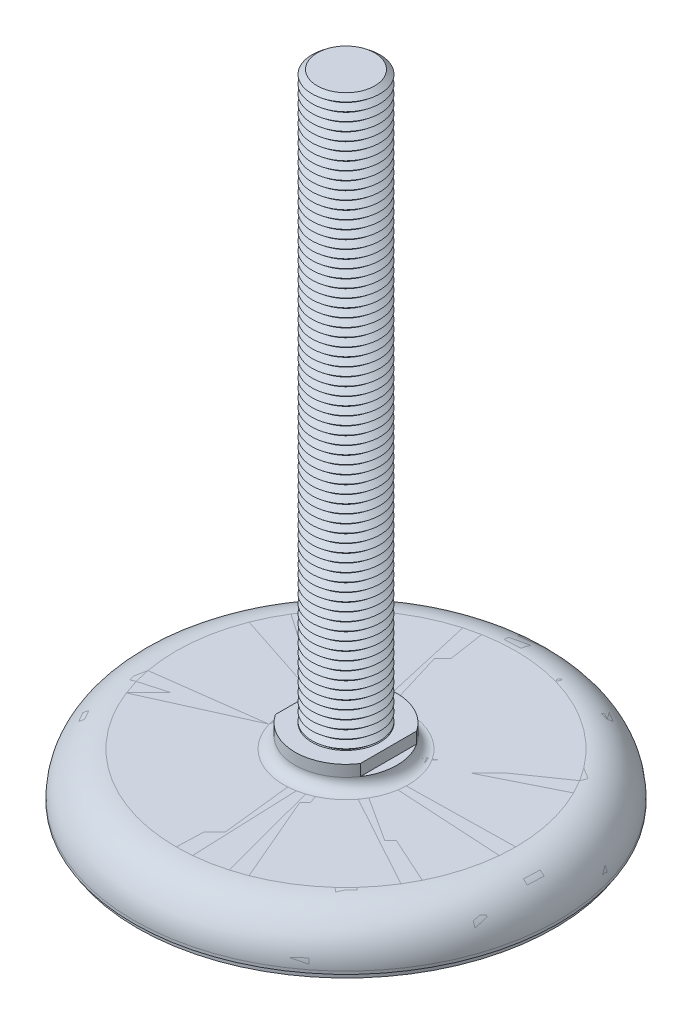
ISO-10303-21;
HEADER;
FILE_DESCRIPTION(('STEP AP214'),'2;1');
FILE_NAME('part.step','',(''),(''),'','','');
FILE_SCHEMA(('AUTOMOTIVE_DESIGN { 1 0 10303 214 1 1 1 1 }'));
ENDSEC;
DATA;
#1=APPLICATION_CONTEXT('core data for automotive mechanical design processes');
#2=APPLICATION_PROTOCOL_DEFINITION('international standard','automotive_design',2000,#1);
#3=PRODUCT_CONTEXT('',#1,'mechanical');
#4=PRODUCT('Part','Part','',(#3));
#5=PRODUCT_RELATED_PRODUCT_CATEGORY('part','',(#4));
#6=PRODUCT_DEFINITION_FORMATION('','',#4);
#7=PRODUCT_DEFINITION_CONTEXT('part definition',#1,'design');
#8=PRODUCT_DEFINITION('design','',#6,#7);
#9=PRODUCT_DEFINITION_SHAPE('','',#8);
#10=(LENGTH_UNIT() NAMED_UNIT(*) SI_UNIT(.MILLI.,.METRE.));
#11=(NAMED_UNIT(*) PLANE_ANGLE_UNIT() SI_UNIT($,.RADIAN.));
#12=(NAMED_UNIT(*) SI_UNIT($,.STERADIAN.) SOLID_ANGLE_UNIT());
#13=UNCERTAINTY_MEASURE_WITH_UNIT(LENGTH_MEASURE(1.E-05),#10,'distance_accuracy_value','');
#14=(GEOMETRIC_REPRESENTATION_CONTEXT(3) GLOBAL_UNCERTAINTY_ASSIGNED_CONTEXT((#13)) GLOBAL_UNIT_ASSIGNED_CONTEXT((#10,
#11,#12)) REPRESENTATION_CONTEXT('',''));
#15=CARTESIAN_POINT('',(0.,0.,0.));
#16=DIRECTION('',(0.,0.,1.));
#17=DIRECTION('',(1.,0.,0.));
#18=AXIS2_PLACEMENT_3D('',#15,#16,#17);
#19=CARTESIAN_POINT('',(0.,220.,0.));
#20=DIRECTION('',(0.,-1.,0.));
#21=DIRECTION('',(0.998136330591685,0.,-0.0610234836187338));
#22=AXIS2_PLACEMENT_3D('',#19,#20,#21);
#23=CONICAL_SURFACE('',#22,10.1265006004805,0.895664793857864);
#24=CARTESIAN_POINT('',(0.,218.5,0.));
#25=DIRECTION('',(0.,-1.,0.));
#26=DIRECTION('',(0.998136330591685,0.,-0.0610234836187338));
#27=AXIS2_PLACEMENT_3D('',#24,#25,#26);
#28=CIRCLE('',#27,12.);
#29=CARTESIAN_POINT('',(11.9776359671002,218.5,-0.732281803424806));
#30=VERTEX_POINT('',#29);
#31=EDGE_CURVE('P0_E37',#30,#30,#28,.T.);
#32=ORIENTED_EDGE('',*,*,#31,.F.);
#33=EDGE_LOOP('',(#32));
#34=FACE_BOUND('',#33,.T.);
#35=CARTESIAN_POINT('',(0.,220.,0.));
#36=DIRECTION('',(0.,-1.,0.));
#37=DIRECTION('',(0.998136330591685,0.,-0.0610234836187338));
#38=AXIS2_PLACEMENT_3D('',#35,#36,#37);
#39=CIRCLE('',#38,10.1265006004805);
#40=CARTESIAN_POINT('',(10.1076281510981,220.,-0.617954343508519));
#41=VERTEX_POINT('',#40);
#42=EDGE_CURVE('P0_E25',#41,#41,#39,.T.);
#43=ORIENTED_EDGE('',*,*,#42,.T.);
#44=EDGE_LOOP('',(#43));
#45=FACE_BOUND('',#44,.T.);
#46=ADVANCED_FACE('P0_F14',(#34,#45),#23,.T.);
#47=CARTESIAN_POINT('',(0.,221.5,0.));
#48=DIRECTION('',(0.,1.,0.));
#49=DIRECTION('',(-0.998136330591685,0.,0.0610234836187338));
#50=AXIS2_PLACEMENT_3D('',#47,#48,#49);
#51=CONICAL_SURFACE('',#50,12.,0.895664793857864);
#52=ORIENTED_EDGE('',*,*,#42,.F.);
#53=EDGE_LOOP('',(#52));
#54=FACE_BOUND('',#53,.T.);
#55=CARTESIAN_POINT('',(0.,221.5,0.));
#56=DIRECTION('',(0.,-1.,0.));
#57=DIRECTION('',(0.998136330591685,0.,-0.0610234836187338));
#58=AXIS2_PLACEMENT_3D('',#55,#56,#57);
#59=CIRCLE('',#58,12.);
#60=CARTESIAN_POINT('',(11.9776359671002,221.5,-0.732281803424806));
#61=VERTEX_POINT('',#60);
#62=EDGE_CURVE('P0_E29',#61,#61,#59,.T.);
#63=ORIENTED_EDGE('',*,*,#62,.T.);
#64=EDGE_LOOP('',(#63));
#65=FACE_BOUND('',#64,.T.);
#66=ADVANCED_FACE('P0_F1285',(#54,#65),#51,.T.);
#67=CARTESIAN_POINT('',(0.,223.,0.));
#68=DIRECTION('',(0.,1.,0.));
#69=DIRECTION('',(-0.998136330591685,0.,0.0610234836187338));
#70=AXIS2_PLACEMENT_3D('',#67,#68,#69);
#71=PLANE('',#70);
#72=CARTESIAN_POINT('',(0.,223.,0.));
#73=DIRECTION('',(0.,-1.,0.));
#74=DIRECTION('',(0.998136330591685,0.,-0.0610234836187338));
#75=AXIS2_PLACEMENT_3D('',#72,#73,#74);
#76=CIRCLE('',#75,10.1265006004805);
#77=CARTESIAN_POINT('',(10.1076281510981,223.,-0.617954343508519));
#78=VERTEX_POINT('',#77);
#79=EDGE_CURVE('P0_E21',#78,#78,#76,.T.);
#80=ORIENTED_EDGE('',*,*,#79,.F.);
#81=EDGE_LOOP('',(#80));
#82=FACE_BOUND('',#81,.T.);
#83=ADVANCED_FACE('P0_F1291',(#82),#71,.T.);
#84=CARTESIAN_POINT('',(0.,223.,0.));
#85=DIRECTION('',(0.,-1.,0.));
#86=DIRECTION('',(0.998136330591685,0.,-0.0610234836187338));
#87=AXIS2_PLACEMENT_3D('',#84,#85,#86);
#88=CONICAL_SURFACE('',#87,10.1265006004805,0.895664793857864);
#89=ORIENTED_EDGE('',*,*,#62,.F.);
#90=EDGE_LOOP('',(#89));
#91=FACE_BOUND('',#90,.T.);
#92=ORIENTED_EDGE('',*,*,#79,.T.);
#93=EDGE_LOOP('',(#92));
#94=FACE_BOUND('',#93,.T.);
#95=ADVANCED_FACE('P0_F1274',(#91,#94),#88,.T.);
#96=CARTESIAN_POINT('',(0.,217.,0.));
#97=DIRECTION('',(0.,-1.,0.));
#98=DIRECTION('',(0.998136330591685,0.,-0.0610234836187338));
#99=AXIS2_PLACEMENT_3D('',#96,#97,#98);
#100=CONICAL_SURFACE('',#99,10.1265006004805,0.895664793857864);
#101=CARTESIAN_POINT('',(0.,215.5,0.));
#102=DIRECTION('',(0.,-1.,0.));
#103=DIRECTION('',(0.998136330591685,0.,-0.0610234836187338));
#104=AXIS2_PLACEMENT_3D('',#101,#102,#103);
#105=CIRCLE('',#104,12.);
#106=CARTESIAN_POINT('',(11.9776359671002,215.5,-0.732281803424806));
#107=VERTEX_POINT('',#106);
#108=EDGE_CURVE('P0_E43',#107,#107,#105,.T.);
#109=ORIENTED_EDGE('',*,*,#108,.F.);
#110=EDGE_LOOP('',(#109));
#111=FACE_BOUND('',#110,.T.);
#112=CARTESIAN_POINT('',(0.,217.,0.));
#113=DIRECTION('',(0.,-1.,0.));
#114=DIRECTION('',(0.998136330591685,0.,-0.0610234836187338));
#115=AXIS2_PLACEMENT_3D('',#112,#113,#114);
#116=CIRCLE('',#115,10.1265006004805);
#117=CARTESIAN_POINT('',(10.1076281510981,217.,-0.617954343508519));
#118=VERTEX_POINT('',#117);
#119=EDGE_CURVE('P0_E34',#118,#118,#116,.T.);
#120=ORIENTED_EDGE('',*,*,#119,.T.);
#121=EDGE_LOOP('',(#120));
#122=FACE_BOUND('',#121,.T.);
#123=ADVANCED_FACE('P0_F1271',(#111,#122),#100,.T.);
#124=CARTESIAN_POINT('',(0.,218.5,0.));
#125=DIRECTION('',(0.,1.,0.));
#126=DIRECTION('',(-0.998136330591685,0.,0.0610234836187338));
#127=AXIS2_PLACEMENT_3D('',#124,#125,#126);
#128=CONICAL_SURFACE('',#127,12.,0.895664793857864);
#129=ORIENTED_EDGE('',*,*,#119,.F.);
#130=EDGE_LOOP('',(#129));
#131=FACE_BOUND('',#130,.T.);
#132=ORIENTED_EDGE('',*,*,#31,.T.);
#133=EDGE_LOOP('',(#132));
#134=FACE_BOUND('',#133,.T.);
#135=ADVANCED_FACE('P0_F1262',(#131,#134),#128,.T.);
#136=CARTESIAN_POINT('',(0.,214.,0.));
#137=DIRECTION('',(0.,-1.,0.));
#138=DIRECTION('',(0.998136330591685,0.,-0.0610234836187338));
#139=AXIS2_PLACEMENT_3D('',#136,#137,#138);
#140=CONICAL_SURFACE('',#139,10.1265006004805,0.895664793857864);
#141=CARTESIAN_POINT('',(0.,212.5,0.));
#142=DIRECTION('',(0.,-1.,0.));
#143=DIRECTION('',(0.998136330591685,0.,-0.0610234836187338));
#144=AXIS2_PLACEMENT_3D('',#141,#142,#143);
#145=CIRCLE('',#144,12.);
#146=CARTESIAN_POINT('',(11.9776359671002,212.5,-0.732281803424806));
#147=VERTEX_POINT('',#146);
#148=EDGE_CURVE('P0_E49',#147,#147,#145,.T.);
#149=ORIENTED_EDGE('',*,*,#148,.F.);
#150=EDGE_LOOP('',(#149));
#151=FACE_BOUND('',#150,.T.);
#152=CARTESIAN_POINT('',(0.,214.,0.));
#153=DIRECTION('',(0.,-1.,0.));
#154=DIRECTION('',(0.998136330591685,0.,-0.0610234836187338));
#155=AXIS2_PLACEMENT_3D('',#152,#153,#154);
#156=CIRCLE('',#155,10.1265006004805);
#157=CARTESIAN_POINT('',(10.1076281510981,214.,-0.617954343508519));
#158=VERTEX_POINT('',#157);
#159=EDGE_CURVE('P0_E40',#158,#158,#156,.T.);
#160=ORIENTED_EDGE('',*,*,#159,.T.);
#161=EDGE_LOOP('',(#160));
#162=FACE_BOUND('',#161,.T.);
#163=ADVANCED_FACE('P0_F1259',(#151,#162),#140,.T.);
#164=CARTESIAN_POINT('',(0.,215.5,0.));
#165=DIRECTION('',(0.,1.,0.));
#166=DIRECTION('',(-0.998136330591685,0.,0.0610234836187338));
#167=AXIS2_PLACEMENT_3D('',#164,#165,#166);
#168=CONICAL_SURFACE('',#167,12.,0.895664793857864);
#169=ORIENTED_EDGE('',*,*,#159,.F.);
#170=EDGE_LOOP('',(#169));
#171=FACE_BOUND('',#170,.T.);
#172=ORIENTED_EDGE('',*,*,#108,.T.);
#173=EDGE_LOOP('',(#172));
#174=FACE_BOUND('',#173,.T.);
#175=ADVANCED_FACE('P0_F1250',(#171,#174),#168,.T.);
#176=CARTESIAN_POINT('',(0.,211.,0.));
#177=DIRECTION('',(0.,-1.,0.));
#178=DIRECTION('',(0.998136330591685,0.,-0.0610234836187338));
#179=AXIS2_PLACEMENT_3D('',#176,#177,#178);
#180=CONICAL_SURFACE('',#179,10.1265006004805,0.895664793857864);
#181=CARTESIAN_POINT('',(0.,209.5,0.));
#182=DIRECTION('',(0.,-1.,0.));
#183=DIRECTION('',(0.998136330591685,0.,-0.0610234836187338));
#184=AXIS2_PLACEMENT_3D('',#181,#182,#183);
#185=CIRCLE('',#184,12.);
#186=CARTESIAN_POINT('',(11.9776359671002,209.5,-0.732281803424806));
#187=VERTEX_POINT('',#186);
#188=EDGE_CURVE('P0_E55',#187,#187,#185,.T.);
#189=ORIENTED_EDGE('',*,*,#188,.F.);
#190=EDGE_LOOP('',(#189));
#191=FACE_BOUND('',#190,.T.);
#192=CARTESIAN_POINT('',(0.,211.,0.));
#193=DIRECTION('',(0.,-1.,0.));
#194=DIRECTION('',(0.998136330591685,0.,-0.0610234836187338));
#195=AXIS2_PLACEMENT_3D('',#192,#193,#194);
#196=CIRCLE('',#195,10.1265006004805);
#197=CARTESIAN_POINT('',(10.1076281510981,211.,-0.617954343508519));
#198=VERTEX_POINT('',#197);
#199=EDGE_CURVE('P0_E46',#198,#198,#196,.T.);
#200=ORIENTED_EDGE('',*,*,#199,.T.);
#201=EDGE_LOOP('',(#200));
#202=FACE_BOUND('',#201,.T.);
#203=ADVANCED_FACE('P0_F1247',(#191,#202),#180,.T.);
#204=CARTESIAN_POINT('',(0.,212.5,0.));
#205=DIRECTION('',(0.,1.,0.));
#206=DIRECTION('',(-0.998136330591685,0.,0.0610234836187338));
#207=AXIS2_PLACEMENT_3D('',#204,#205,#206);
#208=CONICAL_SURFACE('',#207,12.,0.895664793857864);
#209=ORIENTED_EDGE('',*,*,#199,.F.);
#210=EDGE_LOOP('',(#209));
#211=FACE_BOUND('',#210,.T.);
#212=ORIENTED_EDGE('',*,*,#148,.T.);
#213=EDGE_LOOP('',(#212));
#214=FACE_BOUND('',#213,.T.);
#215=ADVANCED_FACE('P0_F1238',(#211,#214),#208,.T.);
#216=CARTESIAN_POINT('',(0.,208.,0.));
#217=DIRECTION('',(0.,-1.,0.));
#218=DIRECTION('',(0.998136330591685,0.,-0.0610234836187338));
#219=AXIS2_PLACEMENT_3D('',#216,#217,#218);
#220=CONICAL_SURFACE('',#219,10.1265006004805,0.895664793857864);
#221=CARTESIAN_POINT('',(0.,206.5,0.));
#222=DIRECTION('',(0.,-1.,0.));
#223=DIRECTION('',(0.998136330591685,0.,-0.0610234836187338));
#224=AXIS2_PLACEMENT_3D('',#221,#222,#223);
#225=CIRCLE('',#224,12.);
#226=CARTESIAN_POINT('',(11.9776359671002,206.5,-0.732281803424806));
#227=VERTEX_POINT('',#226);
#228=EDGE_CURVE('P0_E61',#227,#227,#225,.T.);
#229=ORIENTED_EDGE('',*,*,#228,.F.);
#230=EDGE_LOOP('',(#229));
#231=FACE_BOUND('',#230,.T.);
#232=CARTESIAN_POINT('',(0.,208.,0.));
#233=DIRECTION('',(0.,-1.,0.));
#234=DIRECTION('',(0.998136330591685,0.,-0.0610234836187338));
#235=AXIS2_PLACEMENT_3D('',#232,#233,#234);
#236=CIRCLE('',#235,10.1265006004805);
#237=CARTESIAN_POINT('',(10.1076281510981,208.,-0.617954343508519));
#238=VERTEX_POINT('',#237);
#239=EDGE_CURVE('P0_E52',#238,#238,#236,.T.);
#240=ORIENTED_EDGE('',*,*,#239,.T.);
#241=EDGE_LOOP('',(#240));
#242=FACE_BOUND('',#241,.T.);
#243=ADVANCED_FACE('P0_F1235',(#231,#242),#220,.T.);
#244=CARTESIAN_POINT('',(0.,209.5,0.));
#245=DIRECTION('',(0.,1.,0.));
#246=DIRECTION('',(-0.998136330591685,0.,0.0610234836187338));
#247=AXIS2_PLACEMENT_3D('',#244,#245,#246);
#248=CONICAL_SURFACE('',#247,12.,0.895664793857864);
#249=ORIENTED_EDGE('',*,*,#239,.F.);
#250=EDGE_LOOP('',(#249));
#251=FACE_BOUND('',#250,.T.);
#252=ORIENTED_EDGE('',*,*,#188,.T.);
#253=EDGE_LOOP('',(#252));
#254=FACE_BOUND('',#253,.T.);
#255=ADVANCED_FACE('P0_F1226',(#251,#254),#248,.T.);
#256=CARTESIAN_POINT('',(0.,205.,0.));
#257=DIRECTION('',(0.,-1.,0.));
#258=DIRECTION('',(0.998136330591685,0.,-0.0610234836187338));
#259=AXIS2_PLACEMENT_3D('',#256,#257,#258);
#260=CONICAL_SURFACE('',#259,10.1265006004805,0.895664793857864);
#261=CARTESIAN_POINT('',(0.,203.5,0.));
#262=DIRECTION('',(0.,-1.,0.));
#263=DIRECTION('',(0.998136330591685,0.,-0.0610234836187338));
#264=AXIS2_PLACEMENT_3D('',#261,#262,#263);
#265=CIRCLE('',#264,12.);
#266=CARTESIAN_POINT('',(11.9776359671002,203.5,-0.732281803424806));
#267=VERTEX_POINT('',#266);
#268=EDGE_CURVE('P0_E67',#267,#267,#265,.T.);
#269=ORIENTED_EDGE('',*,*,#268,.F.);
#270=EDGE_LOOP('',(#269));
#271=FACE_BOUND('',#270,.T.);
#272=CARTESIAN_POINT('',(0.,205.,0.));
#273=DIRECTION('',(0.,-1.,0.));
#274=DIRECTION('',(0.998136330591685,0.,-0.0610234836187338));
#275=AXIS2_PLACEMENT_3D('',#272,#273,#274);
#276=CIRCLE('',#275,10.1265006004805);
#277=CARTESIAN_POINT('',(10.1076281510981,205.,-0.617954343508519));
#278=VERTEX_POINT('',#277);
#279=EDGE_CURVE('P0_E58',#278,#278,#276,.T.);
#280=ORIENTED_EDGE('',*,*,#279,.T.);
#281=EDGE_LOOP('',(#280));
#282=FACE_BOUND('',#281,.T.);
#283=ADVANCED_FACE('P0_F1223',(#271,#282),#260,.T.);
#284=CARTESIAN_POINT('',(0.,206.5,0.));
#285=DIRECTION('',(0.,1.,0.));
#286=DIRECTION('',(-0.998136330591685,0.,0.0610234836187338));
#287=AXIS2_PLACEMENT_3D('',#284,#285,#286);
#288=CONICAL_SURFACE('',#287,12.,0.895664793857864);
#289=ORIENTED_EDGE('',*,*,#279,.F.);
#290=EDGE_LOOP('',(#289));
#291=FACE_BOUND('',#290,.T.);
#292=ORIENTED_EDGE('',*,*,#228,.T.);
#293=EDGE_LOOP('',(#292));
#294=FACE_BOUND('',#293,.T.);
#295=ADVANCED_FACE('P0_F1214',(#291,#294),#288,.T.);
#296=CARTESIAN_POINT('',(0.,202.,0.));
#297=DIRECTION('',(0.,-1.,0.));
#298=DIRECTION('',(0.998136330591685,0.,-0.0610234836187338));
#299=AXIS2_PLACEMENT_3D('',#296,#297,#298);
#300=CONICAL_SURFACE('',#299,10.1265006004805,0.895664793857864);
#301=CARTESIAN_POINT('',(0.,200.5,0.));
#302=DIRECTION('',(0.,-1.,0.));
#303=DIRECTION('',(0.998136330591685,0.,-0.0610234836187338));
#304=AXIS2_PLACEMENT_3D('',#301,#302,#303);
#305=CIRCLE('',#304,12.);
#306=CARTESIAN_POINT('',(11.9776359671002,200.5,-0.732281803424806));
#307=VERTEX_POINT('',#306);
#308=EDGE_CURVE('P0_E73',#307,#307,#305,.T.);
#309=ORIENTED_EDGE('',*,*,#308,.F.);
#310=EDGE_LOOP('',(#309));
#311=FACE_BOUND('',#310,.T.);
#312=CARTESIAN_POINT('',(0.,202.,0.));
#313=DIRECTION('',(0.,-1.,0.));
#314=DIRECTION('',(0.998136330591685,0.,-0.0610234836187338));
#315=AXIS2_PLACEMENT_3D('',#312,#313,#314);
#316=CIRCLE('',#315,10.1265006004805);
#317=CARTESIAN_POINT('',(10.1076281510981,202.,-0.617954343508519));
#318=VERTEX_POINT('',#317);
#319=EDGE_CURVE('P0_E64',#318,#318,#316,.T.);
#320=ORIENTED_EDGE('',*,*,#319,.T.);
#321=EDGE_LOOP('',(#320));
#322=FACE_BOUND('',#321,.T.);
#323=ADVANCED_FACE('P0_F1211',(#311,#322),#300,.T.);
#324=CARTESIAN_POINT('',(0.,203.5,0.));
#325=DIRECTION('',(0.,1.,0.));
#326=DIRECTION('',(-0.998136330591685,0.,0.0610234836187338));
#327=AXIS2_PLACEMENT_3D('',#324,#325,#326);
#328=CONICAL_SURFACE('',#327,12.,0.895664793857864);
#329=ORIENTED_EDGE('',*,*,#319,.F.);
#330=EDGE_LOOP('',(#329));
#331=FACE_BOUND('',#330,.T.);
#332=ORIENTED_EDGE('',*,*,#268,.T.);
#333=EDGE_LOOP('',(#332));
#334=FACE_BOUND('',#333,.T.);
#335=ADVANCED_FACE('P0_F1202',(#331,#334),#328,.T.);
#336=CARTESIAN_POINT('',(0.,199.,0.));
#337=DIRECTION('',(0.,-1.,0.));
#338=DIRECTION('',(0.998136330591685,0.,-0.0610234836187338));
#339=AXIS2_PLACEMENT_3D('',#336,#337,#338);
#340=CONICAL_SURFACE('',#339,10.1265006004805,0.895664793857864);
#341=CARTESIAN_POINT('',(0.,197.5,0.));
#342=DIRECTION('',(0.,-1.,0.));
#343=DIRECTION('',(0.998136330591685,0.,-0.0610234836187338));
#344=AXIS2_PLACEMENT_3D('',#341,#342,#343);
#345=CIRCLE('',#344,12.);
#346=CARTESIAN_POINT('',(11.9776359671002,197.5,-0.732281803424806));
#347=VERTEX_POINT('',#346);
#348=EDGE_CURVE('P0_E79',#347,#347,#345,.T.);
#349=ORIENTED_EDGE('',*,*,#348,.F.);
#350=EDGE_LOOP('',(#349));
#351=FACE_BOUND('',#350,.T.);
#352=CARTESIAN_POINT('',(0.,199.,0.));
#353=DIRECTION('',(0.,-1.,0.));
#354=DIRECTION('',(0.998136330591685,0.,-0.0610234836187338));
#355=AXIS2_PLACEMENT_3D('',#352,#353,#354);
#356=CIRCLE('',#355,10.1265006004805);
#357=CARTESIAN_POINT('',(10.1076281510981,199.,-0.617954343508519));
#358=VERTEX_POINT('',#357);
#359=EDGE_CURVE('P0_E70',#358,#358,#356,.T.);
#360=ORIENTED_EDGE('',*,*,#359,.T.);
#361=EDGE_LOOP('',(#360));
#362=FACE_BOUND('',#361,.T.);
#363=ADVANCED_FACE('P0_F1199',(#351,#362),#340,.T.);
#364=CARTESIAN_POINT('',(0.,200.5,0.));
#365=DIRECTION('',(0.,1.,0.));
#366=DIRECTION('',(-0.998136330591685,0.,0.0610234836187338));
#367=AXIS2_PLACEMENT_3D('',#364,#365,#366);
#368=CONICAL_SURFACE('',#367,12.,0.895664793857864);
#369=ORIENTED_EDGE('',*,*,#359,.F.);
#370=EDGE_LOOP('',(#369));
#371=FACE_BOUND('',#370,.T.);
#372=ORIENTED_EDGE('',*,*,#308,.T.);
#373=EDGE_LOOP('',(#372));
#374=FACE_BOUND('',#373,.T.);
#375=ADVANCED_FACE('P0_F1190',(#371,#374),#368,.T.);
#376=CARTESIAN_POINT('',(0.,196.,0.));
#377=DIRECTION('',(0.,-1.,0.));
#378=DIRECTION('',(0.998136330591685,0.,-0.0610234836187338));
#379=AXIS2_PLACEMENT_3D('',#376,#377,#378);
#380=CONICAL_SURFACE('',#379,10.1265006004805,0.895664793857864);
#381=CARTESIAN_POINT('',(0.,194.5,0.));
#382=DIRECTION('',(0.,-1.,0.));
#383=DIRECTION('',(0.998136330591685,0.,-0.0610234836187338));
#384=AXIS2_PLACEMENT_3D('',#381,#382,#383);
#385=CIRCLE('',#384,12.);
#386=CARTESIAN_POINT('',(11.9776359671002,194.5,-0.732281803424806));
#387=VERTEX_POINT('',#386);
#388=EDGE_CURVE('P0_E85',#387,#387,#385,.T.);
#389=ORIENTED_EDGE('',*,*,#388,.F.);
#390=EDGE_LOOP('',(#389));
#391=FACE_BOUND('',#390,.T.);
#392=CARTESIAN_POINT('',(0.,196.,0.));
#393=DIRECTION('',(0.,-1.,0.));
#394=DIRECTION('',(0.998136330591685,0.,-0.0610234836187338));
#395=AXIS2_PLACEMENT_3D('',#392,#393,#394);
#396=CIRCLE('',#395,10.1265006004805);
#397=CARTESIAN_POINT('',(10.1076281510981,196.,-0.617954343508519));
#398=VERTEX_POINT('',#397);
#399=EDGE_CURVE('P0_E76',#398,#398,#396,.T.);
#400=ORIENTED_EDGE('',*,*,#399,.T.);
#401=EDGE_LOOP('',(#400));
#402=FACE_BOUND('',#401,.T.);
#403=ADVANCED_FACE('P0_F1187',(#391,#402),#380,.T.);
#404=CARTESIAN_POINT('',(0.,197.5,0.));
#405=DIRECTION('',(0.,1.,0.));
#406=DIRECTION('',(-0.998136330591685,0.,0.0610234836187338));
#407=AXIS2_PLACEMENT_3D('',#404,#405,#406);
#408=CONICAL_SURFACE('',#407,12.,0.895664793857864);
#409=ORIENTED_EDGE('',*,*,#399,.F.);
#410=EDGE_LOOP('',(#409));
#411=FACE_BOUND('',#410,.T.);
#412=ORIENTED_EDGE('',*,*,#348,.T.);
#413=EDGE_LOOP('',(#412));
#414=FACE_BOUND('',#413,.T.);
#415=ADVANCED_FACE('P0_F1178',(#411,#414),#408,.T.);
#416=CARTESIAN_POINT('',(0.,193.,0.));
#417=DIRECTION('',(0.,-1.,0.));
#418=DIRECTION('',(0.998136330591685,0.,-0.0610234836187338));
#419=AXIS2_PLACEMENT_3D('',#416,#417,#418);
#420=CONICAL_SURFACE('',#419,10.1265006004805,0.895664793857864);
#421=CARTESIAN_POINT('',(0.,191.5,0.));
#422=DIRECTION('',(0.,-1.,0.));
#423=DIRECTION('',(0.998136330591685,0.,-0.0610234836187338));
#424=AXIS2_PLACEMENT_3D('',#421,#422,#423);
#425=CIRCLE('',#424,12.);
#426=CARTESIAN_POINT('',(11.9776359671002,191.5,-0.732281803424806));
#427=VERTEX_POINT('',#426);
#428=EDGE_CURVE('P0_E91',#427,#427,#425,.T.);
#429=ORIENTED_EDGE('',*,*,#428,.F.);
#430=EDGE_LOOP('',(#429));
#431=FACE_BOUND('',#430,.T.);
#432=CARTESIAN_POINT('',(0.,193.,0.));
#433=DIRECTION('',(0.,-1.,0.));
#434=DIRECTION('',(0.998136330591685,0.,-0.0610234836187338));
#435=AXIS2_PLACEMENT_3D('',#432,#433,#434);
#436=CIRCLE('',#435,10.1265006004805);
#437=CARTESIAN_POINT('',(10.1076281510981,193.,-0.617954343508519));
#438=VERTEX_POINT('',#437);
#439=EDGE_CURVE('P0_E82',#438,#438,#436,.T.);
#440=ORIENTED_EDGE('',*,*,#439,.T.);
#441=EDGE_LOOP('',(#440));
#442=FACE_BOUND('',#441,.T.);
#443=ADVANCED_FACE('P0_F1175',(#431,#442),#420,.T.);
#444=CARTESIAN_POINT('',(0.,194.5,0.));
#445=DIRECTION('',(0.,1.,0.));
#446=DIRECTION('',(-0.998136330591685,0.,0.0610234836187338));
#447=AXIS2_PLACEMENT_3D('',#444,#445,#446);
#448=CONICAL_SURFACE('',#447,12.,0.895664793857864);
#449=ORIENTED_EDGE('',*,*,#439,.F.);
#450=EDGE_LOOP('',(#449));
#451=FACE_BOUND('',#450,.T.);
#452=ORIENTED_EDGE('',*,*,#388,.T.);
#453=EDGE_LOOP('',(#452));
#454=FACE_BOUND('',#453,.T.);
#455=ADVANCED_FACE('P0_F1166',(#451,#454),#448,.T.);
#456=CARTESIAN_POINT('',(0.,190.,0.));
#457=DIRECTION('',(0.,-1.,0.));
#458=DIRECTION('',(0.998136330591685,0.,-0.0610234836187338));
#459=AXIS2_PLACEMENT_3D('',#456,#457,#458);
#460=CONICAL_SURFACE('',#459,10.1265006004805,0.895664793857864);
#461=CARTESIAN_POINT('',(0.,188.5,0.));
#462=DIRECTION('',(0.,-1.,0.));
#463=DIRECTION('',(0.998136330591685,0.,-0.0610234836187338));
#464=AXIS2_PLACEMENT_3D('',#461,#462,#463);
#465=CIRCLE('',#464,12.);
#466=CARTESIAN_POINT('',(11.9776359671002,188.5,-0.732281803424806));
#467=VERTEX_POINT('',#466);
#468=EDGE_CURVE('P0_E97',#467,#467,#465,.T.);
#469=ORIENTED_EDGE('',*,*,#468,.F.);
#470=EDGE_LOOP('',(#469));
#471=FACE_BOUND('',#470,.T.);
#472=CARTESIAN_POINT('',(0.,190.,0.));
#473=DIRECTION('',(0.,-1.,0.));
#474=DIRECTION('',(0.998136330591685,0.,-0.0610234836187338));
#475=AXIS2_PLACEMENT_3D('',#472,#473,#474);
#476=CIRCLE('',#475,10.1265006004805);
#477=CARTESIAN_POINT('',(10.1076281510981,190.,-0.617954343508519));
#478=VERTEX_POINT('',#477);
#479=EDGE_CURVE('P0_E88',#478,#478,#476,.T.);
#480=ORIENTED_EDGE('',*,*,#479,.T.);
#481=EDGE_LOOP('',(#480));
#482=FACE_BOUND('',#481,.T.);
#483=ADVANCED_FACE('P0_F1163',(#471,#482),#460,.T.);
#484=CARTESIAN_POINT('',(0.,191.5,0.));
#485=DIRECTION('',(0.,1.,0.));
#486=DIRECTION('',(-0.998136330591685,0.,0.0610234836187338));
#487=AXIS2_PLACEMENT_3D('',#484,#485,#486);
#488=CONICAL_SURFACE('',#487,12.,0.895664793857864);
#489=ORIENTED_EDGE('',*,*,#479,.F.);
#490=EDGE_LOOP('',(#489));
#491=FACE_BOUND('',#490,.T.);
#492=ORIENTED_EDGE('',*,*,#428,.T.);
#493=EDGE_LOOP('',(#492));
#494=FACE_BOUND('',#493,.T.);
#495=ADVANCED_FACE('P0_F1154',(#491,#494),#488,.T.);
#496=CARTESIAN_POINT('',(0.,187.,0.));
#497=DIRECTION('',(0.,-1.,0.));
#498=DIRECTION('',(0.998136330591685,0.,-0.0610234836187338));
#499=AXIS2_PLACEMENT_3D('',#496,#497,#498);
#500=CONICAL_SURFACE('',#499,10.1265006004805,0.895664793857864);
#501=CARTESIAN_POINT('',(0.,185.5,0.));
#502=DIRECTION('',(0.,-1.,0.));
#503=DIRECTION('',(0.998136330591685,0.,-0.0610234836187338));
#504=AXIS2_PLACEMENT_3D('',#501,#502,#503);
#505=CIRCLE('',#504,12.);
#506=CARTESIAN_POINT('',(11.9776359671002,185.5,-0.732281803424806));
#507=VERTEX_POINT('',#506);
#508=EDGE_CURVE('P0_E103',#507,#507,#505,.T.);
#509=ORIENTED_EDGE('',*,*,#508,.F.);
#510=EDGE_LOOP('',(#509));
#511=FACE_BOUND('',#510,.T.);
#512=CARTESIAN_POINT('',(0.,187.,0.));
#513=DIRECTION('',(0.,-1.,0.));
#514=DIRECTION('',(0.998136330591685,0.,-0.0610234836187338));
#515=AXIS2_PLACEMENT_3D('',#512,#513,#514);
#516=CIRCLE('',#515,10.1265006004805);
#517=CARTESIAN_POINT('',(10.1076281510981,187.,-0.617954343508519));
#518=VERTEX_POINT('',#517);
#519=EDGE_CURVE('P0_E94',#518,#518,#516,.T.);
#520=ORIENTED_EDGE('',*,*,#519,.T.);
#521=EDGE_LOOP('',(#520));
#522=FACE_BOUND('',#521,.T.);
#523=ADVANCED_FACE('P0_F1151',(#511,#522),#500,.T.);
#524=CARTESIAN_POINT('',(0.,188.5,0.));
#525=DIRECTION('',(0.,1.,0.));
#526=DIRECTION('',(-0.998136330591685,0.,0.0610234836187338));
#527=AXIS2_PLACEMENT_3D('',#524,#525,#526);
#528=CONICAL_SURFACE('',#527,12.,0.895664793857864);
#529=ORIENTED_EDGE('',*,*,#519,.F.);
#530=EDGE_LOOP('',(#529));
#531=FACE_BOUND('',#530,.T.);
#532=ORIENTED_EDGE('',*,*,#468,.T.);
#533=EDGE_LOOP('',(#532));
#534=FACE_BOUND('',#533,.T.);
#535=ADVANCED_FACE('P0_F1142',(#531,#534),#528,.T.);
#536=CARTESIAN_POINT('',(0.,184.,0.));
#537=DIRECTION('',(0.,-1.,0.));
#538=DIRECTION('',(0.998136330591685,0.,-0.0610234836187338));
#539=AXIS2_PLACEMENT_3D('',#536,#537,#538);
#540=CONICAL_SURFACE('',#539,10.1265006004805,0.895664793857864);
#541=CARTESIAN_POINT('',(0.,182.5,0.));
#542=DIRECTION('',(0.,-1.,0.));
#543=DIRECTION('',(0.998136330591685,0.,-0.0610234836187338));
#544=AXIS2_PLACEMENT_3D('',#541,#542,#543);
#545=CIRCLE('',#544,12.);
#546=CARTESIAN_POINT('',(11.9776359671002,182.5,-0.732281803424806));
#547=VERTEX_POINT('',#546);
#548=EDGE_CURVE('P0_E109',#547,#547,#545,.T.);
#549=ORIENTED_EDGE('',*,*,#548,.F.);
#550=EDGE_LOOP('',(#549));
#551=FACE_BOUND('',#550,.T.);
#552=CARTESIAN_POINT('',(0.,184.,0.));
#553=DIRECTION('',(0.,-1.,0.));
#554=DIRECTION('',(0.998136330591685,0.,-0.0610234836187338));
#555=AXIS2_PLACEMENT_3D('',#552,#553,#554);
#556=CIRCLE('',#555,10.1265006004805);
#557=CARTESIAN_POINT('',(10.1076281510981,184.,-0.617954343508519));
#558=VERTEX_POINT('',#557);
#559=EDGE_CURVE('P0_E100',#558,#558,#556,.T.);
#560=ORIENTED_EDGE('',*,*,#559,.T.);
#561=EDGE_LOOP('',(#560));
#562=FACE_BOUND('',#561,.T.);
#563=ADVANCED_FACE('P0_F1139',(#551,#562),#540,.T.);
#564=CARTESIAN_POINT('',(0.,185.5,0.));
#565=DIRECTION('',(0.,1.,0.));
#566=DIRECTION('',(-0.998136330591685,0.,0.0610234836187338));
#567=AXIS2_PLACEMENT_3D('',#564,#565,#566);
#568=CONICAL_SURFACE('',#567,12.,0.895664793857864);
#569=ORIENTED_EDGE('',*,*,#559,.F.);
#570=EDGE_LOOP('',(#569));
#571=FACE_BOUND('',#570,.T.);
#572=ORIENTED_EDGE('',*,*,#508,.T.);
#573=EDGE_LOOP('',(#572));
#574=FACE_BOUND('',#573,.T.);
#575=ADVANCED_FACE('P0_F1130',(#571,#574),#568,.T.);
#576=CARTESIAN_POINT('',(0.,181.,0.));
#577=DIRECTION('',(0.,-1.,0.));
#578=DIRECTION('',(0.998136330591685,0.,-0.0610234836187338));
#579=AXIS2_PLACEMENT_3D('',#576,#577,#578);
#580=CONICAL_SURFACE('',#579,10.1265006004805,0.895664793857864);
#581=CARTESIAN_POINT('',(0.,179.5,0.));
#582=DIRECTION('',(0.,-1.,0.));
#583=DIRECTION('',(0.998136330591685,0.,-0.0610234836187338));
#584=AXIS2_PLACEMENT_3D('',#581,#582,#583);
#585=CIRCLE('',#584,12.);
#586=CARTESIAN_POINT('',(11.9776359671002,179.5,-0.732281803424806));
#587=VERTEX_POINT('',#586);
#588=EDGE_CURVE('P0_E115',#587,#587,#585,.T.);
#589=ORIENTED_EDGE('',*,*,#588,.F.);
#590=EDGE_LOOP('',(#589));
#591=FACE_BOUND('',#590,.T.);
#592=CARTESIAN_POINT('',(0.,181.,0.));
#593=DIRECTION('',(0.,-1.,0.));
#594=DIRECTION('',(0.998136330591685,0.,-0.0610234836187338));
#595=AXIS2_PLACEMENT_3D('',#592,#593,#594);
#596=CIRCLE('',#595,10.1265006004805);
#597=CARTESIAN_POINT('',(10.1076281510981,181.,-0.617954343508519));
#598=VERTEX_POINT('',#597);
#599=EDGE_CURVE('P0_E106',#598,#598,#596,.T.);
#600=ORIENTED_EDGE('',*,*,#599,.T.);
#601=EDGE_LOOP('',(#600));
#602=FACE_BOUND('',#601,.T.);
#603=ADVANCED_FACE('P0_F1127',(#591,#602),#580,.T.);
#604=CARTESIAN_POINT('',(0.,182.5,0.));
#605=DIRECTION('',(0.,1.,0.));
#606=DIRECTION('',(-0.998136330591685,0.,0.0610234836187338));
#607=AXIS2_PLACEMENT_3D('',#604,#605,#606);
#608=CONICAL_SURFACE('',#607,12.,0.895664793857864);
#609=ORIENTED_EDGE('',*,*,#599,.F.);
#610=EDGE_LOOP('',(#609));
#611=FACE_BOUND('',#610,.T.);
#612=ORIENTED_EDGE('',*,*,#548,.T.);
#613=EDGE_LOOP('',(#612));
#614=FACE_BOUND('',#613,.T.);
#615=ADVANCED_FACE('P0_F1118',(#611,#614),#608,.T.);
#616=CARTESIAN_POINT('',(0.,178.,0.));
#617=DIRECTION('',(0.,-1.,0.));
#618=DIRECTION('',(0.998136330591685,0.,-0.0610234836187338));
#619=AXIS2_PLACEMENT_3D('',#616,#617,#618);
#620=CONICAL_SURFACE('',#619,10.1265006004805,0.895664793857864);
#621=CARTESIAN_POINT('',(0.,176.5,0.));
#622=DIRECTION('',(0.,-1.,0.));
#623=DIRECTION('',(0.998136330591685,0.,-0.0610234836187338));
#624=AXIS2_PLACEMENT_3D('',#621,#622,#623);
#625=CIRCLE('',#624,12.);
#626=CARTESIAN_POINT('',(11.9776359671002,176.5,-0.732281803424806));
#627=VERTEX_POINT('',#626);
#628=EDGE_CURVE('P0_E121',#627,#627,#625,.T.);
#629=ORIENTED_EDGE('',*,*,#628,.F.);
#630=EDGE_LOOP('',(#629));
#631=FACE_BOUND('',#630,.T.);
#632=CARTESIAN_POINT('',(0.,178.,0.));
#633=DIRECTION('',(0.,-1.,0.));
#634=DIRECTION('',(0.998136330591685,0.,-0.0610234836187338));
#635=AXIS2_PLACEMENT_3D('',#632,#633,#634);
#636=CIRCLE('',#635,10.1265006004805);
#637=CARTESIAN_POINT('',(10.1076281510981,178.,-0.617954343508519));
#638=VERTEX_POINT('',#637);
#639=EDGE_CURVE('P0_E112',#638,#638,#636,.T.);
#640=ORIENTED_EDGE('',*,*,#639,.T.);
#641=EDGE_LOOP('',(#640));
#642=FACE_BOUND('',#641,.T.);
#643=ADVANCED_FACE('P0_F1115',(#631,#642),#620,.T.);
#644=CARTESIAN_POINT('',(0.,179.5,0.));
#645=DIRECTION('',(0.,1.,0.));
#646=DIRECTION('',(-0.998136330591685,0.,0.0610234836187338));
#647=AXIS2_PLACEMENT_3D('',#644,#645,#646);
#648=CONICAL_SURFACE('',#647,12.,0.895664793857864);
#649=ORIENTED_EDGE('',*,*,#639,.F.);
#650=EDGE_LOOP('',(#649));
#651=FACE_BOUND('',#650,.T.);
#652=ORIENTED_EDGE('',*,*,#588,.T.);
#653=EDGE_LOOP('',(#652));
#654=FACE_BOUND('',#653,.T.);
#655=ADVANCED_FACE('P0_F1106',(#651,#654),#648,.T.);
#656=CARTESIAN_POINT('',(0.,175.,0.));
#657=DIRECTION('',(0.,-1.,0.));
#658=DIRECTION('',(0.998136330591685,0.,-0.0610234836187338));
#659=AXIS2_PLACEMENT_3D('',#656,#657,#658);
#660=CONICAL_SURFACE('',#659,10.1265006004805,0.895664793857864);
#661=CARTESIAN_POINT('',(0.,173.5,0.));
#662=DIRECTION('',(0.,-1.,0.));
#663=DIRECTION('',(0.998136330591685,0.,-0.0610234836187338));
#664=AXIS2_PLACEMENT_3D('',#661,#662,#663);
#665=CIRCLE('',#664,12.);
#666=CARTESIAN_POINT('',(11.9776359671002,173.5,-0.732281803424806));
#667=VERTEX_POINT('',#666);
#668=EDGE_CURVE('P0_E127',#667,#667,#665,.T.);
#669=ORIENTED_EDGE('',*,*,#668,.F.);
#670=EDGE_LOOP('',(#669));
#671=FACE_BOUND('',#670,.T.);
#672=CARTESIAN_POINT('',(0.,175.,0.));
#673=DIRECTION('',(0.,-1.,0.));
#674=DIRECTION('',(0.998136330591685,0.,-0.0610234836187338));
#675=AXIS2_PLACEMENT_3D('',#672,#673,#674);
#676=CIRCLE('',#675,10.1265006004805);
#677=CARTESIAN_POINT('',(10.1076281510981,175.,-0.617954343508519));
#678=VERTEX_POINT('',#677);
#679=EDGE_CURVE('P0_E118',#678,#678,#676,.T.);
#680=ORIENTED_EDGE('',*,*,#679,.T.);
#681=EDGE_LOOP('',(#680));
#682=FACE_BOUND('',#681,.T.);
#683=ADVANCED_FACE('P0_F1103',(#671,#682),#660,.T.);
#684=CARTESIAN_POINT('',(0.,176.5,0.));
#685=DIRECTION('',(0.,1.,0.));
#686=DIRECTION('',(-0.998136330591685,0.,0.0610234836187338));
#687=AXIS2_PLACEMENT_3D('',#684,#685,#686);
#688=CONICAL_SURFACE('',#687,12.,0.895664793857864);
#689=ORIENTED_EDGE('',*,*,#679,.F.);
#690=EDGE_LOOP('',(#689));
#691=FACE_BOUND('',#690,.T.);
#692=ORIENTED_EDGE('',*,*,#628,.T.);
#693=EDGE_LOOP('',(#692));
#694=FACE_BOUND('',#693,.T.);
#695=ADVANCED_FACE('P0_F1094',(#691,#694),#688,.T.);
#696=CARTESIAN_POINT('',(0.,172.,0.));
#697=DIRECTION('',(0.,-1.,0.));
#698=DIRECTION('',(0.998136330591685,0.,-0.0610234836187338));
#699=AXIS2_PLACEMENT_3D('',#696,#697,#698);
#700=CONICAL_SURFACE('',#699,10.1265006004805,0.895664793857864);
#701=CARTESIAN_POINT('',(0.,170.5,0.));
#702=DIRECTION('',(0.,-1.,0.));
#703=DIRECTION('',(0.998136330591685,0.,-0.0610234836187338));
#704=AXIS2_PLACEMENT_3D('',#701,#702,#703);
#705=CIRCLE('',#704,12.);
#706=CARTESIAN_POINT('',(11.9776359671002,170.5,-0.732281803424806));
#707=VERTEX_POINT('',#706);
#708=EDGE_CURVE('P0_E133',#707,#707,#705,.T.);
#709=ORIENTED_EDGE('',*,*,#708,.F.);
#710=EDGE_LOOP('',(#709));
#711=FACE_BOUND('',#710,.T.);
#712=CARTESIAN_POINT('',(0.,172.,0.));
#713=DIRECTION('',(0.,-1.,0.));
#714=DIRECTION('',(0.998136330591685,0.,-0.0610234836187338));
#715=AXIS2_PLACEMENT_3D('',#712,#713,#714);
#716=CIRCLE('',#715,10.1265006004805);
#717=CARTESIAN_POINT('',(10.1076281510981,172.,-0.617954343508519));
#718=VERTEX_POINT('',#717);
#719=EDGE_CURVE('P0_E124',#718,#718,#716,.T.);
#720=ORIENTED_EDGE('',*,*,#719,.T.);
#721=EDGE_LOOP('',(#720));
#722=FACE_BOUND('',#721,.T.);
#723=ADVANCED_FACE('P0_F1091',(#711,#722),#700,.T.);
#724=CARTESIAN_POINT('',(0.,173.5,0.));
#725=DIRECTION('',(0.,1.,0.));
#726=DIRECTION('',(-0.998136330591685,0.,0.0610234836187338));
#727=AXIS2_PLACEMENT_3D('',#724,#725,#726);
#728=CONICAL_SURFACE('',#727,12.,0.895664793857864);
#729=ORIENTED_EDGE('',*,*,#719,.F.);
#730=EDGE_LOOP('',(#729));
#731=FACE_BOUND('',#730,.T.);
#732=ORIENTED_EDGE('',*,*,#668,.T.);
#733=EDGE_LOOP('',(#732));
#734=FACE_BOUND('',#733,.T.);
#735=ADVANCED_FACE('P0_F1082',(#731,#734),#728,.T.);
#736=CARTESIAN_POINT('',(0.,169.,0.));
#737=DIRECTION('',(0.,-1.,0.));
#738=DIRECTION('',(0.998136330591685,0.,-0.0610234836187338));
#739=AXIS2_PLACEMENT_3D('',#736,#737,#738);
#740=CONICAL_SURFACE('',#739,10.1265006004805,0.895664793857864);
#741=CARTESIAN_POINT('',(0.,167.5,0.));
#742=DIRECTION('',(0.,-1.,0.));
#743=DIRECTION('',(0.998136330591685,0.,-0.0610234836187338));
#744=AXIS2_PLACEMENT_3D('',#741,#742,#743);
#745=CIRCLE('',#744,12.);
#746=CARTESIAN_POINT('',(11.9776359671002,167.5,-0.732281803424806));
#747=VERTEX_POINT('',#746);
#748=EDGE_CURVE('P0_E139',#747,#747,#745,.T.);
#749=ORIENTED_EDGE('',*,*,#748,.F.);
#750=EDGE_LOOP('',(#749));
#751=FACE_BOUND('',#750,.T.);
#752=CARTESIAN_POINT('',(0.,169.,0.));
#753=DIRECTION('',(0.,-1.,0.));
#754=DIRECTION('',(0.998136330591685,0.,-0.0610234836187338));
#755=AXIS2_PLACEMENT_3D('',#752,#753,#754);
#756=CIRCLE('',#755,10.1265006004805);
#757=CARTESIAN_POINT('',(10.1076281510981,169.,-0.617954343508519));
#758=VERTEX_POINT('',#757);
#759=EDGE_CURVE('P0_E130',#758,#758,#756,.T.);
#760=ORIENTED_EDGE('',*,*,#759,.T.);
#761=EDGE_LOOP('',(#760));
#762=FACE_BOUND('',#761,.T.);
#763=ADVANCED_FACE('P0_F1079',(#751,#762),#740,.T.);
#764=CARTESIAN_POINT('',(0.,170.5,0.));
#765=DIRECTION('',(0.,1.,0.));
#766=DIRECTION('',(-0.998136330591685,0.,0.0610234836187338));
#767=AXIS2_PLACEMENT_3D('',#764,#765,#766);
#768=CONICAL_SURFACE('',#767,12.,0.895664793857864);
#769=ORIENTED_EDGE('',*,*,#759,.F.);
#770=EDGE_LOOP('',(#769));
#771=FACE_BOUND('',#770,.T.);
#772=ORIENTED_EDGE('',*,*,#708,.T.);
#773=EDGE_LOOP('',(#772));
#774=FACE_BOUND('',#773,.T.);
#775=ADVANCED_FACE('P0_F1070',(#771,#774),#768,.T.);
#776=CARTESIAN_POINT('',(0.,166.,0.));
#777=DIRECTION('',(0.,-1.,0.));
#778=DIRECTION('',(0.998136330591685,0.,-0.0610234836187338));
#779=AXIS2_PLACEMENT_3D('',#776,#777,#778);
#780=CONICAL_SURFACE('',#779,10.1265006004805,0.895664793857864);
#781=CARTESIAN_POINT('',(0.,164.5,0.));
#782=DIRECTION('',(0.,-1.,0.));
#783=DIRECTION('',(0.998136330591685,0.,-0.0610234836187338));
#784=AXIS2_PLACEMENT_3D('',#781,#782,#783);
#785=CIRCLE('',#784,12.);
#786=CARTESIAN_POINT('',(11.9776359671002,164.5,-0.732281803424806));
#787=VERTEX_POINT('',#786);
#788=EDGE_CURVE('P0_E145',#787,#787,#785,.T.);
#789=ORIENTED_EDGE('',*,*,#788,.F.);
#790=EDGE_LOOP('',(#789));
#791=FACE_BOUND('',#790,.T.);
#792=CARTESIAN_POINT('',(0.,166.,0.));
#793=DIRECTION('',(0.,-1.,0.));
#794=DIRECTION('',(0.998136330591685,0.,-0.0610234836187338));
#795=AXIS2_PLACEMENT_3D('',#792,#793,#794);
#796=CIRCLE('',#795,10.1265006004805);
#797=CARTESIAN_POINT('',(10.1076281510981,166.,-0.617954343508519));
#798=VERTEX_POINT('',#797);
#799=EDGE_CURVE('P0_E136',#798,#798,#796,.T.);
#800=ORIENTED_EDGE('',*,*,#799,.T.);
#801=EDGE_LOOP('',(#800));
#802=FACE_BOUND('',#801,.T.);
#803=ADVANCED_FACE('P0_F1067',(#791,#802),#780,.T.);
#804=CARTESIAN_POINT('',(0.,167.5,0.));
#805=DIRECTION('',(0.,1.,0.));
#806=DIRECTION('',(-0.998136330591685,0.,0.0610234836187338));
#807=AXIS2_PLACEMENT_3D('',#804,#805,#806);
#808=CONICAL_SURFACE('',#807,12.,0.895664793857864);
#809=ORIENTED_EDGE('',*,*,#799,.F.);
#810=EDGE_LOOP('',(#809));
#811=FACE_BOUND('',#810,.T.);
#812=ORIENTED_EDGE('',*,*,#748,.T.);
#813=EDGE_LOOP('',(#812));
#814=FACE_BOUND('',#813,.T.);
#815=ADVANCED_FACE('P0_F1058',(#811,#814),#808,.T.);
#816=CARTESIAN_POINT('',(0.,163.,0.));
#817=DIRECTION('',(0.,-1.,0.));
#818=DIRECTION('',(0.998136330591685,0.,-0.0610234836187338));
#819=AXIS2_PLACEMENT_3D('',#816,#817,#818);
#820=CONICAL_SURFACE('',#819,10.1265006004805,0.895664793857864);
#821=CARTESIAN_POINT('',(0.,161.5,0.));
#822=DIRECTION('',(0.,-1.,0.));
#823=DIRECTION('',(0.998136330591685,0.,-0.0610234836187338));
#824=AXIS2_PLACEMENT_3D('',#821,#822,#823);
#825=CIRCLE('',#824,12.);
#826=CARTESIAN_POINT('',(11.9776359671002,161.5,-0.732281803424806));
#827=VERTEX_POINT('',#826);
#828=EDGE_CURVE('P0_E151',#827,#827,#825,.T.);
#829=ORIENTED_EDGE('',*,*,#828,.F.);
#830=EDGE_LOOP('',(#829));
#831=FACE_BOUND('',#830,.T.);
#832=CARTESIAN_POINT('',(0.,163.,0.));
#833=DIRECTION('',(0.,-1.,0.));
#834=DIRECTION('',(0.998136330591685,0.,-0.0610234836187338));
#835=AXIS2_PLACEMENT_3D('',#832,#833,#834);
#836=CIRCLE('',#835,10.1265006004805);
#837=CARTESIAN_POINT('',(10.1076281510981,163.,-0.617954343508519));
#838=VERTEX_POINT('',#837);
#839=EDGE_CURVE('P0_E142',#838,#838,#836,.T.);
#840=ORIENTED_EDGE('',*,*,#839,.T.);
#841=EDGE_LOOP('',(#840));
#842=FACE_BOUND('',#841,.T.);
#843=ADVANCED_FACE('P0_F1055',(#831,#842),#820,.T.);
#844=CARTESIAN_POINT('',(0.,164.5,0.));
#845=DIRECTION('',(0.,1.,0.));
#846=DIRECTION('',(-0.998136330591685,0.,0.0610234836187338));
#847=AXIS2_PLACEMENT_3D('',#844,#845,#846);
#848=CONICAL_SURFACE('',#847,12.,0.895664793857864);
#849=ORIENTED_EDGE('',*,*,#839,.F.);
#850=EDGE_LOOP('',(#849));
#851=FACE_BOUND('',#850,.T.);
#852=ORIENTED_EDGE('',*,*,#788,.T.);
#853=EDGE_LOOP('',(#852));
#854=FACE_BOUND('',#853,.T.);
#855=ADVANCED_FACE('P0_F1046',(#851,#854),#848,.T.);
#856=CARTESIAN_POINT('',(0.,160.,0.));
#857=DIRECTION('',(0.,-1.,0.));
#858=DIRECTION('',(0.998136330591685,0.,-0.0610234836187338));
#859=AXIS2_PLACEMENT_3D('',#856,#857,#858);
#860=CONICAL_SURFACE('',#859,10.1265006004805,0.895664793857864);
#861=CARTESIAN_POINT('',(0.,158.5,0.));
#862=DIRECTION('',(0.,-1.,0.));
#863=DIRECTION('',(0.998136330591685,0.,-0.0610234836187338));
#864=AXIS2_PLACEMENT_3D('',#861,#862,#863);
#865=CIRCLE('',#864,12.);
#866=CARTESIAN_POINT('',(11.9776359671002,158.5,-0.732281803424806));
#867=VERTEX_POINT('',#866);
#868=EDGE_CURVE('P0_E157',#867,#867,#865,.T.);
#869=ORIENTED_EDGE('',*,*,#868,.F.);
#870=EDGE_LOOP('',(#869));
#871=FACE_BOUND('',#870,.T.);
#872=CARTESIAN_POINT('',(0.,160.,0.));
#873=DIRECTION('',(0.,-1.,0.));
#874=DIRECTION('',(0.998136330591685,0.,-0.0610234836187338));
#875=AXIS2_PLACEMENT_3D('',#872,#873,#874);
#876=CIRCLE('',#875,10.1265006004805);
#877=CARTESIAN_POINT('',(10.1076281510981,160.,-0.617954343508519));
#878=VERTEX_POINT('',#877);
#879=EDGE_CURVE('P0_E148',#878,#878,#876,.T.);
#880=ORIENTED_EDGE('',*,*,#879,.T.);
#881=EDGE_LOOP('',(#880));
#882=FACE_BOUND('',#881,.T.);
#883=ADVANCED_FACE('P0_F1043',(#871,#882),#860,.T.);
#884=CARTESIAN_POINT('',(0.,161.5,0.));
#885=DIRECTION('',(0.,1.,0.));
#886=DIRECTION('',(-0.998136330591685,0.,0.0610234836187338));
#887=AXIS2_PLACEMENT_3D('',#884,#885,#886);
#888=CONICAL_SURFACE('',#887,12.,0.895664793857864);
#889=ORIENTED_EDGE('',*,*,#879,.F.);
#890=EDGE_LOOP('',(#889));
#891=FACE_BOUND('',#890,.T.);
#892=ORIENTED_EDGE('',*,*,#828,.T.);
#893=EDGE_LOOP('',(#892));
#894=FACE_BOUND('',#893,.T.);
#895=ADVANCED_FACE('P0_F1034',(#891,#894),#888,.T.);
#896=CARTESIAN_POINT('',(0.,157.,0.));
#897=DIRECTION('',(0.,-1.,0.));
#898=DIRECTION('',(0.998136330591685,0.,-0.0610234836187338));
#899=AXIS2_PLACEMENT_3D('',#896,#897,#898);
#900=CONICAL_SURFACE('',#899,10.1265006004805,0.895664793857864);
#901=CARTESIAN_POINT('',(0.,155.5,0.));
#902=DIRECTION('',(0.,-1.,0.));
#903=DIRECTION('',(0.998136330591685,0.,-0.0610234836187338));
#904=AXIS2_PLACEMENT_3D('',#901,#902,#903);
#905=CIRCLE('',#904,12.);
#906=CARTESIAN_POINT('',(11.9776359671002,155.5,-0.732281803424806));
#907=VERTEX_POINT('',#906);
#908=EDGE_CURVE('P0_E163',#907,#907,#905,.T.);
#909=ORIENTED_EDGE('',*,*,#908,.F.);
#910=EDGE_LOOP('',(#909));
#911=FACE_BOUND('',#910,.T.);
#912=CARTESIAN_POINT('',(0.,157.,0.));
#913=DIRECTION('',(0.,-1.,0.));
#914=DIRECTION('',(0.998136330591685,0.,-0.0610234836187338));
#915=AXIS2_PLACEMENT_3D('',#912,#913,#914);
#916=CIRCLE('',#915,10.1265006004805);
#917=CARTESIAN_POINT('',(10.1076281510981,157.,-0.617954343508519));
#918=VERTEX_POINT('',#917);
#919=EDGE_CURVE('P0_E154',#918,#918,#916,.T.);
#920=ORIENTED_EDGE('',*,*,#919,.T.);
#921=EDGE_LOOP('',(#920));
#922=FACE_BOUND('',#921,.T.);
#923=ADVANCED_FACE('P0_F1031',(#911,#922),#900,.T.);
#924=CARTESIAN_POINT('',(0.,158.5,0.));
#925=DIRECTION('',(0.,1.,0.));
#926=DIRECTION('',(-0.998136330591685,0.,0.0610234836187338));
#927=AXIS2_PLACEMENT_3D('',#924,#925,#926);
#928=CONICAL_SURFACE('',#927,12.,0.895664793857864);
#929=ORIENTED_EDGE('',*,*,#919,.F.);
#930=EDGE_LOOP('',(#929));
#931=FACE_BOUND('',#930,.T.);
#932=ORIENTED_EDGE('',*,*,#868,.T.);
#933=EDGE_LOOP('',(#932));
#934=FACE_BOUND('',#933,.T.);
#935=ADVANCED_FACE('P0_F1022',(#931,#934),#928,.T.);
#936=CARTESIAN_POINT('',(0.,154.,0.));
#937=DIRECTION('',(0.,-1.,0.));
#938=DIRECTION('',(0.998136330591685,0.,-0.0610234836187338));
#939=AXIS2_PLACEMENT_3D('',#936,#937,#938);
#940=CONICAL_SURFACE('',#939,10.1265006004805,0.895664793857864);
#941=CARTESIAN_POINT('',(0.,152.5,0.));
#942=DIRECTION('',(0.,-1.,0.));
#943=DIRECTION('',(0.998136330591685,0.,-0.0610234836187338));
#944=AXIS2_PLACEMENT_3D('',#941,#942,#943);
#945=CIRCLE('',#944,12.);
#946=CARTESIAN_POINT('',(11.9776359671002,152.5,-0.732281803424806));
#947=VERTEX_POINT('',#946);
#948=EDGE_CURVE('P0_E169',#947,#947,#945,.T.);
#949=ORIENTED_EDGE('',*,*,#948,.F.);
#950=EDGE_LOOP('',(#949));
#951=FACE_BOUND('',#950,.T.);
#952=CARTESIAN_POINT('',(0.,154.,0.));
#953=DIRECTION('',(0.,-1.,0.));
#954=DIRECTION('',(0.998136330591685,0.,-0.0610234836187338));
#955=AXIS2_PLACEMENT_3D('',#952,#953,#954);
#956=CIRCLE('',#955,10.1265006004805);
#957=CARTESIAN_POINT('',(10.1076281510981,154.,-0.617954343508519));
#958=VERTEX_POINT('',#957);
#959=EDGE_CURVE('P0_E160',#958,#958,#956,.T.);
#960=ORIENTED_EDGE('',*,*,#959,.T.);
#961=EDGE_LOOP('',(#960));
#962=FACE_BOUND('',#961,.T.);
#963=ADVANCED_FACE('P0_F1019',(#951,#962),#940,.T.);
#964=CARTESIAN_POINT('',(0.,155.5,0.));
#965=DIRECTION('',(0.,1.,0.));
#966=DIRECTION('',(-0.998136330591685,0.,0.0610234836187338));
#967=AXIS2_PLACEMENT_3D('',#964,#965,#966);
#968=CONICAL_SURFACE('',#967,12.,0.895664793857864);
#969=ORIENTED_EDGE('',*,*,#959,.F.);
#970=EDGE_LOOP('',(#969));
#971=FACE_BOUND('',#970,.T.);
#972=ORIENTED_EDGE('',*,*,#908,.T.);
#973=EDGE_LOOP('',(#972));
#974=FACE_BOUND('',#973,.T.);
#975=ADVANCED_FACE('P0_F1010',(#971,#974),#968,.T.);
#976=CARTESIAN_POINT('',(0.,151.,0.));
#977=DIRECTION('',(0.,-1.,0.));
#978=DIRECTION('',(0.998136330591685,0.,-0.0610234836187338));
#979=AXIS2_PLACEMENT_3D('',#976,#977,#978);
#980=CONICAL_SURFACE('',#979,10.1265006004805,0.895664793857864);
#981=CARTESIAN_POINT('',(0.,149.5,0.));
#982=DIRECTION('',(0.,-1.,0.));
#983=DIRECTION('',(0.998136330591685,0.,-0.0610234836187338));
#984=AXIS2_PLACEMENT_3D('',#981,#982,#983);
#985=CIRCLE('',#984,12.);
#986=CARTESIAN_POINT('',(11.9776359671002,149.5,-0.732281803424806));
#987=VERTEX_POINT('',#986);
#988=EDGE_CURVE('P0_E175',#987,#987,#985,.T.);
#989=ORIENTED_EDGE('',*,*,#988,.F.);
#990=EDGE_LOOP('',(#989));
#991=FACE_BOUND('',#990,.T.);
#992=CARTESIAN_POINT('',(0.,151.,0.));
#993=DIRECTION('',(0.,-1.,0.));
#994=DIRECTION('',(0.998136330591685,0.,-0.0610234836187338));
#995=AXIS2_PLACEMENT_3D('',#992,#993,#994);
#996=CIRCLE('',#995,10.1265006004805);
#997=CARTESIAN_POINT('',(10.1076281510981,151.,-0.617954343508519));
#998=VERTEX_POINT('',#997);
#999=EDGE_CURVE('P0_E166',#998,#998,#996,.T.);
#1000=ORIENTED_EDGE('',*,*,#999,.T.);
#1001=EDGE_LOOP('',(#1000));
#1002=FACE_BOUND('',#1001,.T.);
#1003=ADVANCED_FACE('P0_F1007',(#991,#1002),#980,.T.);
#1004=CARTESIAN_POINT('',(0.,152.5,0.));
#1005=DIRECTION('',(0.,1.,0.));
#1006=DIRECTION('',(-0.998136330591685,0.,0.0610234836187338));
#1007=AXIS2_PLACEMENT_3D('',#1004,#1005,#1006);
#1008=CONICAL_SURFACE('',#1007,12.,0.895664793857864);
#1009=ORIENTED_EDGE('',*,*,#999,.F.);
#1010=EDGE_LOOP('',(#1009));
#1011=FACE_BOUND('',#1010,.T.);
#1012=ORIENTED_EDGE('',*,*,#948,.T.);
#1013=EDGE_LOOP('',(#1012));
#1014=FACE_BOUND('',#1013,.T.);
#1015=ADVANCED_FACE('P0_F998',(#1011,#1014),#1008,.T.);
#1016=CARTESIAN_POINT('',(0.,148.,0.));
#1017=DIRECTION('',(0.,-1.,0.));
#1018=DIRECTION('',(0.998136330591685,0.,-0.0610234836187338));
#1019=AXIS2_PLACEMENT_3D('',#1016,#1017,#1018);
#1020=CONICAL_SURFACE('',#1019,10.1265006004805,0.895664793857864);
#1021=CARTESIAN_POINT('',(0.,146.5,0.));
#1022=DIRECTION('',(0.,-1.,0.));
#1023=DIRECTION('',(0.998136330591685,0.,-0.0610234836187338));
#1024=AXIS2_PLACEMENT_3D('',#1021,#1022,#1023);
#1025=CIRCLE('',#1024,12.);
#1026=CARTESIAN_POINT('',(11.9776359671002,146.5,-0.732281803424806));
#1027=VERTEX_POINT('',#1026);
#1028=EDGE_CURVE('P0_E181',#1027,#1027,#1025,.T.);
#1029=ORIENTED_EDGE('',*,*,#1028,.F.);
#1030=EDGE_LOOP('',(#1029));
#1031=FACE_BOUND('',#1030,.T.);
#1032=CARTESIAN_POINT('',(0.,148.,0.));
#1033=DIRECTION('',(0.,-1.,0.));
#1034=DIRECTION('',(0.998136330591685,0.,-0.0610234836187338));
#1035=AXIS2_PLACEMENT_3D('',#1032,#1033,#1034);
#1036=CIRCLE('',#1035,10.1265006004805);
#1037=CARTESIAN_POINT('',(10.1076281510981,148.,-0.617954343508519));
#1038=VERTEX_POINT('',#1037);
#1039=EDGE_CURVE('P0_E172',#1038,#1038,#1036,.T.);
#1040=ORIENTED_EDGE('',*,*,#1039,.T.);
#1041=EDGE_LOOP('',(#1040));
#1042=FACE_BOUND('',#1041,.T.);
#1043=ADVANCED_FACE('P0_F995',(#1031,#1042),#1020,.T.);
#1044=CARTESIAN_POINT('',(0.,149.5,0.));
#1045=DIRECTION('',(0.,1.,0.));
#1046=DIRECTION('',(-0.998136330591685,0.,0.0610234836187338));
#1047=AXIS2_PLACEMENT_3D('',#1044,#1045,#1046);
#1048=CONICAL_SURFACE('',#1047,12.,0.895664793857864);
#1049=ORIENTED_EDGE('',*,*,#1039,.F.);
#1050=EDGE_LOOP('',(#1049));
#1051=FACE_BOUND('',#1050,.T.);
#1052=ORIENTED_EDGE('',*,*,#988,.T.);
#1053=EDGE_LOOP('',(#1052));
#1054=FACE_BOUND('',#1053,.T.);
#1055=ADVANCED_FACE('P0_F986',(#1051,#1054),#1048,.T.);
#1056=CARTESIAN_POINT('',(0.,145.,0.));
#1057=DIRECTION('',(0.,-1.,0.));
#1058=DIRECTION('',(0.998136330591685,0.,-0.0610234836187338));
#1059=AXIS2_PLACEMENT_3D('',#1056,#1057,#1058);
#1060=CONICAL_SURFACE('',#1059,10.1265006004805,0.895664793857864);
#1061=CARTESIAN_POINT('',(0.,143.5,0.));
#1062=DIRECTION('',(0.,-1.,0.));
#1063=DIRECTION('',(0.998136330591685,0.,-0.0610234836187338));
#1064=AXIS2_PLACEMENT_3D('',#1061,#1062,#1063);
#1065=CIRCLE('',#1064,12.);
#1066=CARTESIAN_POINT('',(11.9776359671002,143.5,-0.732281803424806));
#1067=VERTEX_POINT('',#1066);
#1068=EDGE_CURVE('P0_E187',#1067,#1067,#1065,.T.);
#1069=ORIENTED_EDGE('',*,*,#1068,.F.);
#1070=EDGE_LOOP('',(#1069));
#1071=FACE_BOUND('',#1070,.T.);
#1072=CARTESIAN_POINT('',(0.,145.,0.));
#1073=DIRECTION('',(0.,-1.,0.));
#1074=DIRECTION('',(0.998136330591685,0.,-0.0610234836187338));
#1075=AXIS2_PLACEMENT_3D('',#1072,#1073,#1074);
#1076=CIRCLE('',#1075,10.1265006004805);
#1077=CARTESIAN_POINT('',(10.1076281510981,145.,-0.617954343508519));
#1078=VERTEX_POINT('',#1077);
#1079=EDGE_CURVE('P0_E178',#1078,#1078,#1076,.T.);
#1080=ORIENTED_EDGE('',*,*,#1079,.T.);
#1081=EDGE_LOOP('',(#1080));
#1082=FACE_BOUND('',#1081,.T.);
#1083=ADVANCED_FACE('P0_F983',(#1071,#1082),#1060,.T.);
#1084=CARTESIAN_POINT('',(0.,146.5,0.));
#1085=DIRECTION('',(0.,1.,0.));
#1086=DIRECTION('',(-0.998136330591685,0.,0.0610234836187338));
#1087=AXIS2_PLACEMENT_3D('',#1084,#1085,#1086);
#1088=CONICAL_SURFACE('',#1087,12.,0.895664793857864);
#1089=ORIENTED_EDGE('',*,*,#1079,.F.);
#1090=EDGE_LOOP('',(#1089));
#1091=FACE_BOUND('',#1090,.T.);
#1092=ORIENTED_EDGE('',*,*,#1028,.T.);
#1093=EDGE_LOOP('',(#1092));
#1094=FACE_BOUND('',#1093,.T.);
#1095=ADVANCED_FACE('P0_F974',(#1091,#1094),#1088,.T.);
#1096=CARTESIAN_POINT('',(0.,142.,0.));
#1097=DIRECTION('',(0.,-1.,0.));
#1098=DIRECTION('',(0.998136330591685,0.,-0.0610234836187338));
#1099=AXIS2_PLACEMENT_3D('',#1096,#1097,#1098);
#1100=CONICAL_SURFACE('',#1099,10.1265006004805,0.895664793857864);
#1101=CARTESIAN_POINT('',(0.,140.5,0.));
#1102=DIRECTION('',(0.,-1.,0.));
#1103=DIRECTION('',(0.998136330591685,0.,-0.0610234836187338));
#1104=AXIS2_PLACEMENT_3D('',#1101,#1102,#1103);
#1105=CIRCLE('',#1104,12.);
#1106=CARTESIAN_POINT('',(11.9776359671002,140.5,-0.732281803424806));
#1107=VERTEX_POINT('',#1106);
#1108=EDGE_CURVE('P0_E193',#1107,#1107,#1105,.T.);
#1109=ORIENTED_EDGE('',*,*,#1108,.F.);
#1110=EDGE_LOOP('',(#1109));
#1111=FACE_BOUND('',#1110,.T.);
#1112=CARTESIAN_POINT('',(0.,142.,0.));
#1113=DIRECTION('',(0.,-1.,0.));
#1114=DIRECTION('',(0.998136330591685,0.,-0.0610234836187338));
#1115=AXIS2_PLACEMENT_3D('',#1112,#1113,#1114);
#1116=CIRCLE('',#1115,10.1265006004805);
#1117=CARTESIAN_POINT('',(10.1076281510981,142.,-0.617954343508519));
#1118=VERTEX_POINT('',#1117);
#1119=EDGE_CURVE('P0_E184',#1118,#1118,#1116,.T.);
#1120=ORIENTED_EDGE('',*,*,#1119,.T.);
#1121=EDGE_LOOP('',(#1120));
#1122=FACE_BOUND('',#1121,.T.);
#1123=ADVANCED_FACE('P0_F971',(#1111,#1122),#1100,.T.);
#1124=CARTESIAN_POINT('',(0.,143.5,0.));
#1125=DIRECTION('',(0.,1.,0.));
#1126=DIRECTION('',(-0.998136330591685,0.,0.0610234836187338));
#1127=AXIS2_PLACEMENT_3D('',#1124,#1125,#1126);
#1128=CONICAL_SURFACE('',#1127,12.,0.895664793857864);
#1129=ORIENTED_EDGE('',*,*,#1119,.F.);
#1130=EDGE_LOOP('',(#1129));
#1131=FACE_BOUND('',#1130,.T.);
#1132=ORIENTED_EDGE('',*,*,#1068,.T.);
#1133=EDGE_LOOP('',(#1132));
#1134=FACE_BOUND('',#1133,.T.);
#1135=ADVANCED_FACE('P0_F962',(#1131,#1134),#1128,.T.);
#1136=CARTESIAN_POINT('',(0.,139.,0.));
#1137=DIRECTION('',(0.,-1.,0.));
#1138=DIRECTION('',(0.998136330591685,0.,-0.0610234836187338));
#1139=AXIS2_PLACEMENT_3D('',#1136,#1137,#1138);
#1140=CONICAL_SURFACE('',#1139,10.1265006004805,0.895664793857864);
#1141=CARTESIAN_POINT('',(0.,137.5,0.));
#1142=DIRECTION('',(0.,-1.,0.));
#1143=DIRECTION('',(0.998136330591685,0.,-0.0610234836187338));
#1144=AXIS2_PLACEMENT_3D('',#1141,#1142,#1143);
#1145=CIRCLE('',#1144,12.);
#1146=CARTESIAN_POINT('',(11.9776359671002,137.5,-0.732281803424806));
#1147=VERTEX_POINT('',#1146);
#1148=EDGE_CURVE('P0_E199',#1147,#1147,#1145,.T.);
#1149=ORIENTED_EDGE('',*,*,#1148,.F.);
#1150=EDGE_LOOP('',(#1149));
#1151=FACE_BOUND('',#1150,.T.);
#1152=CARTESIAN_POINT('',(0.,139.,0.));
#1153=DIRECTION('',(0.,-1.,0.));
#1154=DIRECTION('',(0.998136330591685,0.,-0.0610234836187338));
#1155=AXIS2_PLACEMENT_3D('',#1152,#1153,#1154);
#1156=CIRCLE('',#1155,10.1265006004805);
#1157=CARTESIAN_POINT('',(10.1076281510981,139.,-0.617954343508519));
#1158=VERTEX_POINT('',#1157);
#1159=EDGE_CURVE('P0_E190',#1158,#1158,#1156,.T.);
#1160=ORIENTED_EDGE('',*,*,#1159,.T.);
#1161=EDGE_LOOP('',(#1160));
#1162=FACE_BOUND('',#1161,.T.);
#1163=ADVANCED_FACE('P0_F959',(#1151,#1162),#1140,.T.);
#1164=CARTESIAN_POINT('',(0.,140.5,0.));
#1165=DIRECTION('',(0.,1.,0.));
#1166=DIRECTION('',(-0.998136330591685,0.,0.0610234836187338));
#1167=AXIS2_PLACEMENT_3D('',#1164,#1165,#1166);
#1168=CONICAL_SURFACE('',#1167,12.,0.895664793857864);
#1169=ORIENTED_EDGE('',*,*,#1159,.F.);
#1170=EDGE_LOOP('',(#1169));
#1171=FACE_BOUND('',#1170,.T.);
#1172=ORIENTED_EDGE('',*,*,#1108,.T.);
#1173=EDGE_LOOP('',(#1172));
#1174=FACE_BOUND('',#1173,.T.);
#1175=ADVANCED_FACE('P0_F950',(#1171,#1174),#1168,.T.);
#1176=CARTESIAN_POINT('',(0.,136.,0.));
#1177=DIRECTION('',(0.,-1.,0.));
#1178=DIRECTION('',(0.998136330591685,0.,-0.0610234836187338));
#1179=AXIS2_PLACEMENT_3D('',#1176,#1177,#1178);
#1180=CONICAL_SURFACE('',#1179,10.1265006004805,0.895664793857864);
#1181=CARTESIAN_POINT('',(0.,134.5,0.));
#1182=DIRECTION('',(0.,-1.,0.));
#1183=DIRECTION('',(0.998136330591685,0.,-0.0610234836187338));
#1184=AXIS2_PLACEMENT_3D('',#1181,#1182,#1183);
#1185=CIRCLE('',#1184,12.);
#1186=CARTESIAN_POINT('',(11.9776359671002,134.5,-0.732281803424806));
#1187=VERTEX_POINT('',#1186);
#1188=EDGE_CURVE('P0_E205',#1187,#1187,#1185,.T.);
#1189=ORIENTED_EDGE('',*,*,#1188,.F.);
#1190=EDGE_LOOP('',(#1189));
#1191=FACE_BOUND('',#1190,.T.);
#1192=CARTESIAN_POINT('',(0.,136.,0.));
#1193=DIRECTION('',(0.,-1.,0.));
#1194=DIRECTION('',(0.998136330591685,0.,-0.0610234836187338));
#1195=AXIS2_PLACEMENT_3D('',#1192,#1193,#1194);
#1196=CIRCLE('',#1195,10.1265006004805);
#1197=CARTESIAN_POINT('',(10.1076281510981,136.,-0.617954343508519));
#1198=VERTEX_POINT('',#1197);
#1199=EDGE_CURVE('P0_E196',#1198,#1198,#1196,.T.);
#1200=ORIENTED_EDGE('',*,*,#1199,.T.);
#1201=EDGE_LOOP('',(#1200));
#1202=FACE_BOUND('',#1201,.T.);
#1203=ADVANCED_FACE('P0_F947',(#1191,#1202),#1180,.T.);
#1204=CARTESIAN_POINT('',(0.,137.5,0.));
#1205=DIRECTION('',(0.,1.,0.));
#1206=DIRECTION('',(-0.998136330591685,0.,0.0610234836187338));
#1207=AXIS2_PLACEMENT_3D('',#1204,#1205,#1206);
#1208=CONICAL_SURFACE('',#1207,12.,0.895664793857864);
#1209=ORIENTED_EDGE('',*,*,#1199,.F.);
#1210=EDGE_LOOP('',(#1209));
#1211=FACE_BOUND('',#1210,.T.);
#1212=ORIENTED_EDGE('',*,*,#1148,.T.);
#1213=EDGE_LOOP('',(#1212));
#1214=FACE_BOUND('',#1213,.T.);
#1215=ADVANCED_FACE('P0_F938',(#1211,#1214),#1208,.T.);
#1216=CARTESIAN_POINT('',(0.,133.,0.));
#1217=DIRECTION('',(0.,-1.,0.));
#1218=DIRECTION('',(0.998136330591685,0.,-0.0610234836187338));
#1219=AXIS2_PLACEMENT_3D('',#1216,#1217,#1218);
#1220=CONICAL_SURFACE('',#1219,10.1265006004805,0.895664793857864);
#1221=CARTESIAN_POINT('',(0.,131.5,0.));
#1222=DIRECTION('',(0.,-1.,0.));
#1223=DIRECTION('',(0.998136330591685,0.,-0.0610234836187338));
#1224=AXIS2_PLACEMENT_3D('',#1221,#1222,#1223);
#1225=CIRCLE('',#1224,12.);
#1226=CARTESIAN_POINT('',(11.9776359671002,131.5,-0.732281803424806));
#1227=VERTEX_POINT('',#1226);
#1228=EDGE_CURVE('P0_E211',#1227,#1227,#1225,.T.);
#1229=ORIENTED_EDGE('',*,*,#1228,.F.);
#1230=EDGE_LOOP('',(#1229));
#1231=FACE_BOUND('',#1230,.T.);
#1232=CARTESIAN_POINT('',(0.,133.,0.));
#1233=DIRECTION('',(0.,-1.,0.));
#1234=DIRECTION('',(0.998136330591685,0.,-0.0610234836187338));
#1235=AXIS2_PLACEMENT_3D('',#1232,#1233,#1234);
#1236=CIRCLE('',#1235,10.1265006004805);
#1237=CARTESIAN_POINT('',(10.1076281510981,133.,-0.617954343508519));
#1238=VERTEX_POINT('',#1237);
#1239=EDGE_CURVE('P0_E202',#1238,#1238,#1236,.T.);
#1240=ORIENTED_EDGE('',*,*,#1239,.T.);
#1241=EDGE_LOOP('',(#1240));
#1242=FACE_BOUND('',#1241,.T.);
#1243=ADVANCED_FACE('P0_F935',(#1231,#1242),#1220,.T.);
#1244=CARTESIAN_POINT('',(0.,134.5,0.));
#1245=DIRECTION('',(0.,1.,0.));
#1246=DIRECTION('',(-0.998136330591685,0.,0.0610234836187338));
#1247=AXIS2_PLACEMENT_3D('',#1244,#1245,#1246);
#1248=CONICAL_SURFACE('',#1247,12.,0.895664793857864);
#1249=ORIENTED_EDGE('',*,*,#1239,.F.);
#1250=EDGE_LOOP('',(#1249));
#1251=FACE_BOUND('',#1250,.T.);
#1252=ORIENTED_EDGE('',*,*,#1188,.T.);
#1253=EDGE_LOOP('',(#1252));
#1254=FACE_BOUND('',#1253,.T.);
#1255=ADVANCED_FACE('P0_F926',(#1251,#1254),#1248,.T.);
#1256=CARTESIAN_POINT('',(0.,130.,0.));
#1257=DIRECTION('',(0.,-1.,0.));
#1258=DIRECTION('',(0.998136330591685,0.,-0.0610234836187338));
#1259=AXIS2_PLACEMENT_3D('',#1256,#1257,#1258);
#1260=CONICAL_SURFACE('',#1259,10.1265006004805,0.895664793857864);
#1261=CARTESIAN_POINT('',(0.,128.5,0.));
#1262=DIRECTION('',(0.,-1.,0.));
#1263=DIRECTION('',(0.998136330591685,0.,-0.0610234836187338));
#1264=AXIS2_PLACEMENT_3D('',#1261,#1262,#1263);
#1265=CIRCLE('',#1264,12.);
#1266=CARTESIAN_POINT('',(11.9776359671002,128.5,-0.732281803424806));
#1267=VERTEX_POINT('',#1266);
#1268=EDGE_CURVE('P0_E217',#1267,#1267,#1265,.T.);
#1269=ORIENTED_EDGE('',*,*,#1268,.F.);
#1270=EDGE_LOOP('',(#1269));
#1271=FACE_BOUND('',#1270,.T.);
#1272=CARTESIAN_POINT('',(0.,130.,0.));
#1273=DIRECTION('',(0.,-1.,0.));
#1274=DIRECTION('',(0.998136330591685,0.,-0.0610234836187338));
#1275=AXIS2_PLACEMENT_3D('',#1272,#1273,#1274);
#1276=CIRCLE('',#1275,10.1265006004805);
#1277=CARTESIAN_POINT('',(10.1076281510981,130.,-0.617954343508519));
#1278=VERTEX_POINT('',#1277);
#1279=EDGE_CURVE('P0_E208',#1278,#1278,#1276,.T.);
#1280=ORIENTED_EDGE('',*,*,#1279,.T.);
#1281=EDGE_LOOP('',(#1280));
#1282=FACE_BOUND('',#1281,.T.);
#1283=ADVANCED_FACE('P0_F923',(#1271,#1282),#1260,.T.);
#1284=CARTESIAN_POINT('',(0.,131.5,0.));
#1285=DIRECTION('',(0.,1.,0.));
#1286=DIRECTION('',(-0.998136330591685,0.,0.0610234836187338));
#1287=AXIS2_PLACEMENT_3D('',#1284,#1285,#1286);
#1288=CONICAL_SURFACE('',#1287,12.,0.895664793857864);
#1289=ORIENTED_EDGE('',*,*,#1279,.F.);
#1290=EDGE_LOOP('',(#1289));
#1291=FACE_BOUND('',#1290,.T.);
#1292=ORIENTED_EDGE('',*,*,#1228,.T.);
#1293=EDGE_LOOP('',(#1292));
#1294=FACE_BOUND('',#1293,.T.);
#1295=ADVANCED_FACE('P0_F914',(#1291,#1294),#1288,.T.);
#1296=CARTESIAN_POINT('',(0.,127.,0.));
#1297=DIRECTION('',(0.,-1.,0.));
#1298=DIRECTION('',(0.998136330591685,0.,-0.0610234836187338));
#1299=AXIS2_PLACEMENT_3D('',#1296,#1297,#1298);
#1300=CONICAL_SURFACE('',#1299,10.1265006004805,0.895664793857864);
#1301=CARTESIAN_POINT('',(0.,125.5,0.));
#1302=DIRECTION('',(0.,-1.,0.));
#1303=DIRECTION('',(0.998136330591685,0.,-0.0610234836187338));
#1304=AXIS2_PLACEMENT_3D('',#1301,#1302,#1303);
#1305=CIRCLE('',#1304,12.);
#1306=CARTESIAN_POINT('',(11.9776359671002,125.5,-0.732281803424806));
#1307=VERTEX_POINT('',#1306);
#1308=EDGE_CURVE('P0_E223',#1307,#1307,#1305,.T.);
#1309=ORIENTED_EDGE('',*,*,#1308,.F.);
#1310=EDGE_LOOP('',(#1309));
#1311=FACE_BOUND('',#1310,.T.);
#1312=CARTESIAN_POINT('',(0.,127.,0.));
#1313=DIRECTION('',(0.,-1.,0.));
#1314=DIRECTION('',(0.998136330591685,0.,-0.0610234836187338));
#1315=AXIS2_PLACEMENT_3D('',#1312,#1313,#1314);
#1316=CIRCLE('',#1315,10.1265006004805);
#1317=CARTESIAN_POINT('',(10.1076281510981,127.,-0.617954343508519));
#1318=VERTEX_POINT('',#1317);
#1319=EDGE_CURVE('P0_E214',#1318,#1318,#1316,.T.);
#1320=ORIENTED_EDGE('',*,*,#1319,.T.);
#1321=EDGE_LOOP('',(#1320));
#1322=FACE_BOUND('',#1321,.T.);
#1323=ADVANCED_FACE('P0_F911',(#1311,#1322),#1300,.T.);
#1324=CARTESIAN_POINT('',(0.,128.5,0.));
#1325=DIRECTION('',(0.,1.,0.));
#1326=DIRECTION('',(-0.998136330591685,0.,0.0610234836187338));
#1327=AXIS2_PLACEMENT_3D('',#1324,#1325,#1326);
#1328=CONICAL_SURFACE('',#1327,12.,0.895664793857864);
#1329=ORIENTED_EDGE('',*,*,#1319,.F.);
#1330=EDGE_LOOP('',(#1329));
#1331=FACE_BOUND('',#1330,.T.);
#1332=ORIENTED_EDGE('',*,*,#1268,.T.);
#1333=EDGE_LOOP('',(#1332));
#1334=FACE_BOUND('',#1333,.T.);
#1335=ADVANCED_FACE('P0_F902',(#1331,#1334),#1328,.T.);
#1336=CARTESIAN_POINT('',(0.,124.,0.));
#1337=DIRECTION('',(0.,-1.,0.));
#1338=DIRECTION('',(0.998136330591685,0.,-0.0610234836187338));
#1339=AXIS2_PLACEMENT_3D('',#1336,#1337,#1338);
#1340=CONICAL_SURFACE('',#1339,10.1265006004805,0.895664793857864);
#1341=CARTESIAN_POINT('',(0.,122.5,0.));
#1342=DIRECTION('',(0.,-1.,0.));
#1343=DIRECTION('',(0.998136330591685,0.,-0.0610234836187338));
#1344=AXIS2_PLACEMENT_3D('',#1341,#1342,#1343);
#1345=CIRCLE('',#1344,12.);
#1346=CARTESIAN_POINT('',(11.9776359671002,122.5,-0.732281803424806));
#1347=VERTEX_POINT('',#1346);
#1348=EDGE_CURVE('P0_E229',#1347,#1347,#1345,.T.);
#1349=ORIENTED_EDGE('',*,*,#1348,.F.);
#1350=EDGE_LOOP('',(#1349));
#1351=FACE_BOUND('',#1350,.T.);
#1352=CARTESIAN_POINT('',(0.,124.,0.));
#1353=DIRECTION('',(0.,-1.,0.));
#1354=DIRECTION('',(0.998136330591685,0.,-0.0610234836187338));
#1355=AXIS2_PLACEMENT_3D('',#1352,#1353,#1354);
#1356=CIRCLE('',#1355,10.1265006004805);
#1357=CARTESIAN_POINT('',(10.1076281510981,124.,-0.617954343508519));
#1358=VERTEX_POINT('',#1357);
#1359=EDGE_CURVE('P0_E220',#1358,#1358,#1356,.T.);
#1360=ORIENTED_EDGE('',*,*,#1359,.T.);
#1361=EDGE_LOOP('',(#1360));
#1362=FACE_BOUND('',#1361,.T.);
#1363=ADVANCED_FACE('P0_F899',(#1351,#1362),#1340,.T.);
#1364=CARTESIAN_POINT('',(0.,125.5,0.));
#1365=DIRECTION('',(0.,1.,0.));
#1366=DIRECTION('',(-0.998136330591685,0.,0.0610234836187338));
#1367=AXIS2_PLACEMENT_3D('',#1364,#1365,#1366);
#1368=CONICAL_SURFACE('',#1367,12.,0.895664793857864);
#1369=ORIENTED_EDGE('',*,*,#1359,.F.);
#1370=EDGE_LOOP('',(#1369));
#1371=FACE_BOUND('',#1370,.T.);
#1372=ORIENTED_EDGE('',*,*,#1308,.T.);
#1373=EDGE_LOOP('',(#1372));
#1374=FACE_BOUND('',#1373,.T.);
#1375=ADVANCED_FACE('P0_F890',(#1371,#1374),#1368,.T.);
#1376=CARTESIAN_POINT('',(0.,121.,0.));
#1377=DIRECTION('',(0.,-1.,0.));
#1378=DIRECTION('',(0.998136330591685,0.,-0.0610234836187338));
#1379=AXIS2_PLACEMENT_3D('',#1376,#1377,#1378);
#1380=CONICAL_SURFACE('',#1379,10.1265006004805,0.895664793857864);
#1381=CARTESIAN_POINT('',(0.,119.5,0.));
#1382=DIRECTION('',(0.,-1.,0.));
#1383=DIRECTION('',(0.998136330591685,0.,-0.0610234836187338));
#1384=AXIS2_PLACEMENT_3D('',#1381,#1382,#1383);
#1385=CIRCLE('',#1384,12.);
#1386=CARTESIAN_POINT('',(11.9776359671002,119.5,-0.732281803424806));
#1387=VERTEX_POINT('',#1386);
#1388=EDGE_CURVE('P0_E235',#1387,#1387,#1385,.T.);
#1389=ORIENTED_EDGE('',*,*,#1388,.F.);
#1390=EDGE_LOOP('',(#1389));
#1391=FACE_BOUND('',#1390,.T.);
#1392=CARTESIAN_POINT('',(0.,121.,0.));
#1393=DIRECTION('',(0.,-1.,0.));
#1394=DIRECTION('',(0.998136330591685,0.,-0.0610234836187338));
#1395=AXIS2_PLACEMENT_3D('',#1392,#1393,#1394);
#1396=CIRCLE('',#1395,10.1265006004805);
#1397=CARTESIAN_POINT('',(10.1076281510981,121.,-0.617954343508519));
#1398=VERTEX_POINT('',#1397);
#1399=EDGE_CURVE('P0_E226',#1398,#1398,#1396,.T.);
#1400=ORIENTED_EDGE('',*,*,#1399,.T.);
#1401=EDGE_LOOP('',(#1400));
#1402=FACE_BOUND('',#1401,.T.);
#1403=ADVANCED_FACE('P0_F887',(#1391,#1402),#1380,.T.);
#1404=CARTESIAN_POINT('',(0.,122.5,0.));
#1405=DIRECTION('',(0.,1.,0.));
#1406=DIRECTION('',(-0.998136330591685,0.,0.0610234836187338));
#1407=AXIS2_PLACEMENT_3D('',#1404,#1405,#1406);
#1408=CONICAL_SURFACE('',#1407,12.,0.895664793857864);
#1409=ORIENTED_EDGE('',*,*,#1399,.F.);
#1410=EDGE_LOOP('',(#1409));
#1411=FACE_BOUND('',#1410,.T.);
#1412=ORIENTED_EDGE('',*,*,#1348,.T.);
#1413=EDGE_LOOP('',(#1412));
#1414=FACE_BOUND('',#1413,.T.);
#1415=ADVANCED_FACE('P0_F878',(#1411,#1414),#1408,.T.);
#1416=CARTESIAN_POINT('',(0.,118.,0.));
#1417=DIRECTION('',(0.,-1.,0.));
#1418=DIRECTION('',(0.998136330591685,0.,-0.0610234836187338));
#1419=AXIS2_PLACEMENT_3D('',#1416,#1417,#1418);
#1420=CONICAL_SURFACE('',#1419,10.1265006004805,0.895664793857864);
#1421=CARTESIAN_POINT('',(0.,116.5,0.));
#1422=DIRECTION('',(0.,-1.,0.));
#1423=DIRECTION('',(0.998136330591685,0.,-0.0610234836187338));
#1424=AXIS2_PLACEMENT_3D('',#1421,#1422,#1423);
#1425=CIRCLE('',#1424,12.);
#1426=CARTESIAN_POINT('',(11.9776359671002,116.5,-0.732281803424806));
#1427=VERTEX_POINT('',#1426);
#1428=EDGE_CURVE('P0_E241',#1427,#1427,#1425,.T.);
#1429=ORIENTED_EDGE('',*,*,#1428,.F.);
#1430=EDGE_LOOP('',(#1429));
#1431=FACE_BOUND('',#1430,.T.);
#1432=CARTESIAN_POINT('',(0.,118.,0.));
#1433=DIRECTION('',(0.,-1.,0.));
#1434=DIRECTION('',(0.998136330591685,0.,-0.0610234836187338));
#1435=AXIS2_PLACEMENT_3D('',#1432,#1433,#1434);
#1436=CIRCLE('',#1435,10.1265006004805);
#1437=CARTESIAN_POINT('',(10.1076281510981,118.,-0.617954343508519));
#1438=VERTEX_POINT('',#1437);
#1439=EDGE_CURVE('P0_E232',#1438,#1438,#1436,.T.);
#1440=ORIENTED_EDGE('',*,*,#1439,.T.);
#1441=EDGE_LOOP('',(#1440));
#1442=FACE_BOUND('',#1441,.T.);
#1443=ADVANCED_FACE('P0_F875',(#1431,#1442),#1420,.T.);
#1444=CARTESIAN_POINT('',(0.,119.5,0.));
#1445=DIRECTION('',(0.,1.,0.));
#1446=DIRECTION('',(-0.998136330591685,0.,0.0610234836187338));
#1447=AXIS2_PLACEMENT_3D('',#1444,#1445,#1446);
#1448=CONICAL_SURFACE('',#1447,12.,0.895664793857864);
#1449=ORIENTED_EDGE('',*,*,#1439,.F.);
#1450=EDGE_LOOP('',(#1449));
#1451=FACE_BOUND('',#1450,.T.);
#1452=ORIENTED_EDGE('',*,*,#1388,.T.);
#1453=EDGE_LOOP('',(#1452));
#1454=FACE_BOUND('',#1453,.T.);
#1455=ADVANCED_FACE('P0_F866',(#1451,#1454),#1448,.T.);
#1456=CARTESIAN_POINT('',(0.,115.,0.));
#1457=DIRECTION('',(0.,-1.,0.));
#1458=DIRECTION('',(0.998136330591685,0.,-0.0610234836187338));
#1459=AXIS2_PLACEMENT_3D('',#1456,#1457,#1458);
#1460=CONICAL_SURFACE('',#1459,10.1265006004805,0.895664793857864);
#1461=CARTESIAN_POINT('',(0.,113.5,0.));
#1462=DIRECTION('',(0.,-1.,0.));
#1463=DIRECTION('',(0.998136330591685,0.,-0.0610234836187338));
#1464=AXIS2_PLACEMENT_3D('',#1461,#1462,#1463);
#1465=CIRCLE('',#1464,12.);
#1466=CARTESIAN_POINT('',(11.9776359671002,113.5,-0.732281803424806));
#1467=VERTEX_POINT('',#1466);
#1468=EDGE_CURVE('P0_E247',#1467,#1467,#1465,.T.);
#1469=ORIENTED_EDGE('',*,*,#1468,.F.);
#1470=EDGE_LOOP('',(#1469));
#1471=FACE_BOUND('',#1470,.T.);
#1472=CARTESIAN_POINT('',(0.,115.,0.));
#1473=DIRECTION('',(0.,-1.,0.));
#1474=DIRECTION('',(0.998136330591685,0.,-0.0610234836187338));
#1475=AXIS2_PLACEMENT_3D('',#1472,#1473,#1474);
#1476=CIRCLE('',#1475,10.1265006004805);
#1477=CARTESIAN_POINT('',(10.1076281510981,115.,-0.617954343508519));
#1478=VERTEX_POINT('',#1477);
#1479=EDGE_CURVE('P0_E238',#1478,#1478,#1476,.T.);
#1480=ORIENTED_EDGE('',*,*,#1479,.T.);
#1481=EDGE_LOOP('',(#1480));
#1482=FACE_BOUND('',#1481,.T.);
#1483=ADVANCED_FACE('P0_F863',(#1471,#1482),#1460,.T.);
#1484=CARTESIAN_POINT('',(0.,116.5,0.));
#1485=DIRECTION('',(0.,1.,0.));
#1486=DIRECTION('',(-0.998136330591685,0.,0.0610234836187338));
#1487=AXIS2_PLACEMENT_3D('',#1484,#1485,#1486);
#1488=CONICAL_SURFACE('',#1487,12.,0.895664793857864);
#1489=ORIENTED_EDGE('',*,*,#1479,.F.);
#1490=EDGE_LOOP('',(#1489));
#1491=FACE_BOUND('',#1490,.T.);
#1492=ORIENTED_EDGE('',*,*,#1428,.T.);
#1493=EDGE_LOOP('',(#1492));
#1494=FACE_BOUND('',#1493,.T.);
#1495=ADVANCED_FACE('P0_F854',(#1491,#1494),#1488,.T.);
#1496=CARTESIAN_POINT('',(0.,112.,0.));
#1497=DIRECTION('',(0.,-1.,0.));
#1498=DIRECTION('',(0.998136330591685,0.,-0.0610234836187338));
#1499=AXIS2_PLACEMENT_3D('',#1496,#1497,#1498);
#1500=CONICAL_SURFACE('',#1499,10.1265006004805,0.895664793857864);
#1501=CARTESIAN_POINT('',(0.,110.5,0.));
#1502=DIRECTION('',(0.,-1.,0.));
#1503=DIRECTION('',(0.998136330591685,0.,-0.0610234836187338));
#1504=AXIS2_PLACEMENT_3D('',#1501,#1502,#1503);
#1505=CIRCLE('',#1504,12.);
#1506=CARTESIAN_POINT('',(11.9776359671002,110.5,-0.732281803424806));
#1507=VERTEX_POINT('',#1506);
#1508=EDGE_CURVE('P0_E253',#1507,#1507,#1505,.T.);
#1509=ORIENTED_EDGE('',*,*,#1508,.F.);
#1510=EDGE_LOOP('',(#1509));
#1511=FACE_BOUND('',#1510,.T.);
#1512=CARTESIAN_POINT('',(0.,112.,0.));
#1513=DIRECTION('',(0.,-1.,0.));
#1514=DIRECTION('',(0.998136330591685,0.,-0.0610234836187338));
#1515=AXIS2_PLACEMENT_3D('',#1512,#1513,#1514);
#1516=CIRCLE('',#1515,10.1265006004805);
#1517=CARTESIAN_POINT('',(10.1076281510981,112.,-0.617954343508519));
#1518=VERTEX_POINT('',#1517);
#1519=EDGE_CURVE('P0_E244',#1518,#1518,#1516,.T.);
#1520=ORIENTED_EDGE('',*,*,#1519,.T.);
#1521=EDGE_LOOP('',(#1520));
#1522=FACE_BOUND('',#1521,.T.);
#1523=ADVANCED_FACE('P0_F851',(#1511,#1522),#1500,.T.);
#1524=CARTESIAN_POINT('',(0.,113.5,0.));
#1525=DIRECTION('',(0.,1.,0.));
#1526=DIRECTION('',(-0.998136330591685,0.,0.0610234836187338));
#1527=AXIS2_PLACEMENT_3D('',#1524,#1525,#1526);
#1528=CONICAL_SURFACE('',#1527,12.,0.895664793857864);
#1529=ORIENTED_EDGE('',*,*,#1519,.F.);
#1530=EDGE_LOOP('',(#1529));
#1531=FACE_BOUND('',#1530,.T.);
#1532=ORIENTED_EDGE('',*,*,#1468,.T.);
#1533=EDGE_LOOP('',(#1532));
#1534=FACE_BOUND('',#1533,.T.);
#1535=ADVANCED_FACE('P0_F842',(#1531,#1534),#1528,.T.);
#1536=CARTESIAN_POINT('',(0.,109.,0.));
#1537=DIRECTION('',(0.,-1.,0.));
#1538=DIRECTION('',(0.998136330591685,0.,-0.0610234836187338));
#1539=AXIS2_PLACEMENT_3D('',#1536,#1537,#1538);
#1540=CONICAL_SURFACE('',#1539,10.1265006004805,0.895664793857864);
#1541=CARTESIAN_POINT('',(0.,107.5,0.));
#1542=DIRECTION('',(0.,-1.,0.));
#1543=DIRECTION('',(0.998136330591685,0.,-0.0610234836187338));
#1544=AXIS2_PLACEMENT_3D('',#1541,#1542,#1543);
#1545=CIRCLE('',#1544,12.);
#1546=CARTESIAN_POINT('',(11.9776359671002,107.5,-0.732281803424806));
#1547=VERTEX_POINT('',#1546);
#1548=EDGE_CURVE('P0_E259',#1547,#1547,#1545,.T.);
#1549=ORIENTED_EDGE('',*,*,#1548,.F.);
#1550=EDGE_LOOP('',(#1549));
#1551=FACE_BOUND('',#1550,.T.);
#1552=CARTESIAN_POINT('',(0.,109.,0.));
#1553=DIRECTION('',(0.,-1.,0.));
#1554=DIRECTION('',(0.998136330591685,0.,-0.0610234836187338));
#1555=AXIS2_PLACEMENT_3D('',#1552,#1553,#1554);
#1556=CIRCLE('',#1555,10.1265006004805);
#1557=CARTESIAN_POINT('',(10.1076281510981,109.,-0.617954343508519));
#1558=VERTEX_POINT('',#1557);
#1559=EDGE_CURVE('P0_E250',#1558,#1558,#1556,.T.);
#1560=ORIENTED_EDGE('',*,*,#1559,.T.);
#1561=EDGE_LOOP('',(#1560));
#1562=FACE_BOUND('',#1561,.T.);
#1563=ADVANCED_FACE('P0_F839',(#1551,#1562),#1540,.T.);
#1564=CARTESIAN_POINT('',(0.,110.5,0.));
#1565=DIRECTION('',(0.,1.,0.));
#1566=DIRECTION('',(-0.998136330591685,0.,0.0610234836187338));
#1567=AXIS2_PLACEMENT_3D('',#1564,#1565,#1566);
#1568=CONICAL_SURFACE('',#1567,12.,0.895664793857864);
#1569=ORIENTED_EDGE('',*,*,#1559,.F.);
#1570=EDGE_LOOP('',(#1569));
#1571=FACE_BOUND('',#1570,.T.);
#1572=ORIENTED_EDGE('',*,*,#1508,.T.);
#1573=EDGE_LOOP('',(#1572));
#1574=FACE_BOUND('',#1573,.T.);
#1575=ADVANCED_FACE('P0_F830',(#1571,#1574),#1568,.T.);
#1576=CARTESIAN_POINT('',(0.,106.,0.));
#1577=DIRECTION('',(0.,-1.,0.));
#1578=DIRECTION('',(0.998136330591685,0.,-0.0610234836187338));
#1579=AXIS2_PLACEMENT_3D('',#1576,#1577,#1578);
#1580=CONICAL_SURFACE('',#1579,10.1265006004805,0.895664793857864);
#1581=CARTESIAN_POINT('',(0.,104.5,0.));
#1582=DIRECTION('',(0.,-1.,0.));
#1583=DIRECTION('',(0.998136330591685,0.,-0.0610234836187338));
#1584=AXIS2_PLACEMENT_3D('',#1581,#1582,#1583);
#1585=CIRCLE('',#1584,12.);
#1586=CARTESIAN_POINT('',(11.9776359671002,104.5,-0.732281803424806));
#1587=VERTEX_POINT('',#1586);
#1588=EDGE_CURVE('P0_E265',#1587,#1587,#1585,.T.);
#1589=ORIENTED_EDGE('',*,*,#1588,.F.);
#1590=EDGE_LOOP('',(#1589));
#1591=FACE_BOUND('',#1590,.T.);
#1592=CARTESIAN_POINT('',(0.,106.,0.));
#1593=DIRECTION('',(0.,-1.,0.));
#1594=DIRECTION('',(0.998136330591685,0.,-0.0610234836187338));
#1595=AXIS2_PLACEMENT_3D('',#1592,#1593,#1594);
#1596=CIRCLE('',#1595,10.1265006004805);
#1597=CARTESIAN_POINT('',(10.1076281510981,106.,-0.617954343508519));
#1598=VERTEX_POINT('',#1597);
#1599=EDGE_CURVE('P0_E256',#1598,#1598,#1596,.T.);
#1600=ORIENTED_EDGE('',*,*,#1599,.T.);
#1601=EDGE_LOOP('',(#1600));
#1602=FACE_BOUND('',#1601,.T.);
#1603=ADVANCED_FACE('P0_F827',(#1591,#1602),#1580,.T.);
#1604=CARTESIAN_POINT('',(0.,107.5,0.));
#1605=DIRECTION('',(0.,1.,0.));
#1606=DIRECTION('',(-0.998136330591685,0.,0.0610234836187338));
#1607=AXIS2_PLACEMENT_3D('',#1604,#1605,#1606);
#1608=CONICAL_SURFACE('',#1607,12.,0.895664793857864);
#1609=ORIENTED_EDGE('',*,*,#1599,.F.);
#1610=EDGE_LOOP('',(#1609));
#1611=FACE_BOUND('',#1610,.T.);
#1612=ORIENTED_EDGE('',*,*,#1548,.T.);
#1613=EDGE_LOOP('',(#1612));
#1614=FACE_BOUND('',#1613,.T.);
#1615=ADVANCED_FACE('P0_F818',(#1611,#1614),#1608,.T.);
#1616=CARTESIAN_POINT('',(0.,103.,0.));
#1617=DIRECTION('',(0.,-1.,0.));
#1618=DIRECTION('',(0.998136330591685,0.,-0.0610234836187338));
#1619=AXIS2_PLACEMENT_3D('',#1616,#1617,#1618);
#1620=CONICAL_SURFACE('',#1619,10.1265006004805,0.895664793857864);
#1621=CARTESIAN_POINT('',(0.,101.5,0.));
#1622=DIRECTION('',(0.,-1.,0.));
#1623=DIRECTION('',(0.998136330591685,0.,-0.0610234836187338));
#1624=AXIS2_PLACEMENT_3D('',#1621,#1622,#1623);
#1625=CIRCLE('',#1624,12.);
#1626=CARTESIAN_POINT('',(11.9776359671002,101.5,-0.732281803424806));
#1627=VERTEX_POINT('',#1626);
#1628=EDGE_CURVE('P0_E271',#1627,#1627,#1625,.T.);
#1629=ORIENTED_EDGE('',*,*,#1628,.F.);
#1630=EDGE_LOOP('',(#1629));
#1631=FACE_BOUND('',#1630,.T.);
#1632=CARTESIAN_POINT('',(0.,103.,0.));
#1633=DIRECTION('',(0.,-1.,0.));
#1634=DIRECTION('',(0.998136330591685,0.,-0.0610234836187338));
#1635=AXIS2_PLACEMENT_3D('',#1632,#1633,#1634);
#1636=CIRCLE('',#1635,10.1265006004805);
#1637=CARTESIAN_POINT('',(10.1076281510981,103.,-0.617954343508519));
#1638=VERTEX_POINT('',#1637);
#1639=EDGE_CURVE('P0_E262',#1638,#1638,#1636,.T.);
#1640=ORIENTED_EDGE('',*,*,#1639,.T.);
#1641=EDGE_LOOP('',(#1640));
#1642=FACE_BOUND('',#1641,.T.);
#1643=ADVANCED_FACE('P0_F815',(#1631,#1642),#1620,.T.);
#1644=CARTESIAN_POINT('',(0.,104.5,0.));
#1645=DIRECTION('',(0.,1.,0.));
#1646=DIRECTION('',(-0.998136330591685,0.,0.0610234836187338));
#1647=AXIS2_PLACEMENT_3D('',#1644,#1645,#1646);
#1648=CONICAL_SURFACE('',#1647,12.,0.895664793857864);
#1649=ORIENTED_EDGE('',*,*,#1639,.F.);
#1650=EDGE_LOOP('',(#1649));
#1651=FACE_BOUND('',#1650,.T.);
#1652=ORIENTED_EDGE('',*,*,#1588,.T.);
#1653=EDGE_LOOP('',(#1652));
#1654=FACE_BOUND('',#1653,.T.);
#1655=ADVANCED_FACE('P0_F806',(#1651,#1654),#1648,.T.);
#1656=CARTESIAN_POINT('',(0.,100.,0.));
#1657=DIRECTION('',(0.,-1.,0.));
#1658=DIRECTION('',(0.998136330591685,0.,-0.0610234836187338));
#1659=AXIS2_PLACEMENT_3D('',#1656,#1657,#1658);
#1660=CONICAL_SURFACE('',#1659,10.1265006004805,0.895664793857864);
#1661=CARTESIAN_POINT('',(0.,98.5,0.));
#1662=DIRECTION('',(0.,-1.,0.));
#1663=DIRECTION('',(0.998136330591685,0.,-0.0610234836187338));
#1664=AXIS2_PLACEMENT_3D('',#1661,#1662,#1663);
#1665=CIRCLE('',#1664,12.);
#1666=CARTESIAN_POINT('',(11.9776359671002,98.5,-0.732281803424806));
#1667=VERTEX_POINT('',#1666);
#1668=EDGE_CURVE('P0_E277',#1667,#1667,#1665,.T.);
#1669=ORIENTED_EDGE('',*,*,#1668,.F.);
#1670=EDGE_LOOP('',(#1669));
#1671=FACE_BOUND('',#1670,.T.);
#1672=CARTESIAN_POINT('',(0.,100.,0.));
#1673=DIRECTION('',(0.,-1.,0.));
#1674=DIRECTION('',(0.998136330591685,0.,-0.0610234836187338));
#1675=AXIS2_PLACEMENT_3D('',#1672,#1673,#1674);
#1676=CIRCLE('',#1675,10.1265006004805);
#1677=CARTESIAN_POINT('',(10.1076281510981,100.,-0.617954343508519));
#1678=VERTEX_POINT('',#1677);
#1679=EDGE_CURVE('P0_E268',#1678,#1678,#1676,.T.);
#1680=ORIENTED_EDGE('',*,*,#1679,.T.);
#1681=EDGE_LOOP('',(#1680));
#1682=FACE_BOUND('',#1681,.T.);
#1683=ADVANCED_FACE('P0_F803',(#1671,#1682),#1660,.T.);
#1684=CARTESIAN_POINT('',(0.,101.5,0.));
#1685=DIRECTION('',(0.,1.,0.));
#1686=DIRECTION('',(-0.998136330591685,0.,0.0610234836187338));
#1687=AXIS2_PLACEMENT_3D('',#1684,#1685,#1686);
#1688=CONICAL_SURFACE('',#1687,12.,0.895664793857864);
#1689=ORIENTED_EDGE('',*,*,#1679,.F.);
#1690=EDGE_LOOP('',(#1689));
#1691=FACE_BOUND('',#1690,.T.);
#1692=ORIENTED_EDGE('',*,*,#1628,.T.);
#1693=EDGE_LOOP('',(#1692));
#1694=FACE_BOUND('',#1693,.T.);
#1695=ADVANCED_FACE('P0_F794',(#1691,#1694),#1688,.T.);
#1696=CARTESIAN_POINT('',(0.,97.,0.));
#1697=DIRECTION('',(0.,-1.,0.));
#1698=DIRECTION('',(0.998136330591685,0.,-0.0610234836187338));
#1699=AXIS2_PLACEMENT_3D('',#1696,#1697,#1698);
#1700=CONICAL_SURFACE('',#1699,10.1265006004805,0.895664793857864);
#1701=CARTESIAN_POINT('',(0.,95.5,0.));
#1702=DIRECTION('',(0.,-1.,0.));
#1703=DIRECTION('',(0.998136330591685,0.,-0.0610234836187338));
#1704=AXIS2_PLACEMENT_3D('',#1701,#1702,#1703);
#1705=CIRCLE('',#1704,12.);
#1706=CARTESIAN_POINT('',(11.9776359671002,95.5,-0.732281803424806));
#1707=VERTEX_POINT('',#1706);
#1708=EDGE_CURVE('P0_E283',#1707,#1707,#1705,.T.);
#1709=ORIENTED_EDGE('',*,*,#1708,.F.);
#1710=EDGE_LOOP('',(#1709));
#1711=FACE_BOUND('',#1710,.T.);
#1712=CARTESIAN_POINT('',(0.,97.,0.));
#1713=DIRECTION('',(0.,-1.,0.));
#1714=DIRECTION('',(0.998136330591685,0.,-0.0610234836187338));
#1715=AXIS2_PLACEMENT_3D('',#1712,#1713,#1714);
#1716=CIRCLE('',#1715,10.1265006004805);
#1717=CARTESIAN_POINT('',(10.1076281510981,97.,-0.617954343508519));
#1718=VERTEX_POINT('',#1717);
#1719=EDGE_CURVE('P0_E274',#1718,#1718,#1716,.T.);
#1720=ORIENTED_EDGE('',*,*,#1719,.T.);
#1721=EDGE_LOOP('',(#1720));
#1722=FACE_BOUND('',#1721,.T.);
#1723=ADVANCED_FACE('P0_F791',(#1711,#1722),#1700,.T.);
#1724=CARTESIAN_POINT('',(0.,98.5,0.));
#1725=DIRECTION('',(0.,1.,0.));
#1726=DIRECTION('',(-0.998136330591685,0.,0.0610234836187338));
#1727=AXIS2_PLACEMENT_3D('',#1724,#1725,#1726);
#1728=CONICAL_SURFACE('',#1727,12.,0.895664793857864);
#1729=ORIENTED_EDGE('',*,*,#1719,.F.);
#1730=EDGE_LOOP('',(#1729));
#1731=FACE_BOUND('',#1730,.T.);
#1732=ORIENTED_EDGE('',*,*,#1668,.T.);
#1733=EDGE_LOOP('',(#1732));
#1734=FACE_BOUND('',#1733,.T.);
#1735=ADVANCED_FACE('P0_F782',(#1731,#1734),#1728,.T.);
#1736=CARTESIAN_POINT('',(0.,94.,0.));
#1737=DIRECTION('',(0.,-1.,0.));
#1738=DIRECTION('',(0.998136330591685,0.,-0.0610234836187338));
#1739=AXIS2_PLACEMENT_3D('',#1736,#1737,#1738);
#1740=CONICAL_SURFACE('',#1739,10.1265006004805,0.895664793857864);
#1741=CARTESIAN_POINT('',(0.,92.5,0.));
#1742=DIRECTION('',(0.,-1.,0.));
#1743=DIRECTION('',(0.998136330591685,0.,-0.0610234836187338));
#1744=AXIS2_PLACEMENT_3D('',#1741,#1742,#1743);
#1745=CIRCLE('',#1744,12.);
#1746=CARTESIAN_POINT('',(11.9776359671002,92.5,-0.732281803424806));
#1747=VERTEX_POINT('',#1746);
#1748=EDGE_CURVE('P0_E289',#1747,#1747,#1745,.T.);
#1749=ORIENTED_EDGE('',*,*,#1748,.F.);
#1750=EDGE_LOOP('',(#1749));
#1751=FACE_BOUND('',#1750,.T.);
#1752=CARTESIAN_POINT('',(0.,94.,0.));
#1753=DIRECTION('',(0.,-1.,0.));
#1754=DIRECTION('',(0.998136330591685,0.,-0.0610234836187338));
#1755=AXIS2_PLACEMENT_3D('',#1752,#1753,#1754);
#1756=CIRCLE('',#1755,10.1265006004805);
#1757=CARTESIAN_POINT('',(10.1076281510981,94.,-0.617954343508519));
#1758=VERTEX_POINT('',#1757);
#1759=EDGE_CURVE('P0_E280',#1758,#1758,#1756,.T.);
#1760=ORIENTED_EDGE('',*,*,#1759,.T.);
#1761=EDGE_LOOP('',(#1760));
#1762=FACE_BOUND('',#1761,.T.);
#1763=ADVANCED_FACE('P0_F779',(#1751,#1762),#1740,.T.);
#1764=CARTESIAN_POINT('',(0.,95.5,0.));
#1765=DIRECTION('',(0.,1.,0.));
#1766=DIRECTION('',(-0.998136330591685,0.,0.0610234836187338));
#1767=AXIS2_PLACEMENT_3D('',#1764,#1765,#1766);
#1768=CONICAL_SURFACE('',#1767,12.,0.895664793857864);
#1769=ORIENTED_EDGE('',*,*,#1759,.F.);
#1770=EDGE_LOOP('',(#1769));
#1771=FACE_BOUND('',#1770,.T.);
#1772=ORIENTED_EDGE('',*,*,#1708,.T.);
#1773=EDGE_LOOP('',(#1772));
#1774=FACE_BOUND('',#1773,.T.);
#1775=ADVANCED_FACE('P0_F770',(#1771,#1774),#1768,.T.);
#1776=CARTESIAN_POINT('',(0.,91.,0.));
#1777=DIRECTION('',(0.,-1.,0.));
#1778=DIRECTION('',(0.998136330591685,0.,-0.0610234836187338));
#1779=AXIS2_PLACEMENT_3D('',#1776,#1777,#1778);
#1780=CONICAL_SURFACE('',#1779,10.1265006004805,0.895664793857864);
#1781=CARTESIAN_POINT('',(0.,89.5,0.));
#1782=DIRECTION('',(0.,-1.,0.));
#1783=DIRECTION('',(0.998136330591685,0.,-0.0610234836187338));
#1784=AXIS2_PLACEMENT_3D('',#1781,#1782,#1783);
#1785=CIRCLE('',#1784,12.);
#1786=CARTESIAN_POINT('',(11.9776359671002,89.5,-0.732281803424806));
#1787=VERTEX_POINT('',#1786);
#1788=EDGE_CURVE('P0_E295',#1787,#1787,#1785,.T.);
#1789=ORIENTED_EDGE('',*,*,#1788,.F.);
#1790=EDGE_LOOP('',(#1789));
#1791=FACE_BOUND('',#1790,.T.);
#1792=CARTESIAN_POINT('',(0.,91.,0.));
#1793=DIRECTION('',(0.,-1.,0.));
#1794=DIRECTION('',(0.998136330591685,0.,-0.0610234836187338));
#1795=AXIS2_PLACEMENT_3D('',#1792,#1793,#1794);
#1796=CIRCLE('',#1795,10.1265006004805);
#1797=CARTESIAN_POINT('',(10.1076281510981,91.,-0.617954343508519));
#1798=VERTEX_POINT('',#1797);
#1799=EDGE_CURVE('P0_E286',#1798,#1798,#1796,.T.);
#1800=ORIENTED_EDGE('',*,*,#1799,.T.);
#1801=EDGE_LOOP('',(#1800));
#1802=FACE_BOUND('',#1801,.T.);
#1803=ADVANCED_FACE('P0_F767',(#1791,#1802),#1780,.T.);
#1804=CARTESIAN_POINT('',(0.,92.5,0.));
#1805=DIRECTION('',(0.,1.,0.));
#1806=DIRECTION('',(-0.998136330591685,0.,0.0610234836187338));
#1807=AXIS2_PLACEMENT_3D('',#1804,#1805,#1806);
#1808=CONICAL_SURFACE('',#1807,12.,0.895664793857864);
#1809=ORIENTED_EDGE('',*,*,#1799,.F.);
#1810=EDGE_LOOP('',(#1809));
#1811=FACE_BOUND('',#1810,.T.);
#1812=ORIENTED_EDGE('',*,*,#1748,.T.);
#1813=EDGE_LOOP('',(#1812));
#1814=FACE_BOUND('',#1813,.T.);
#1815=ADVANCED_FACE('P0_F758',(#1811,#1814),#1808,.T.);
#1816=CARTESIAN_POINT('',(0.,88.,0.));
#1817=DIRECTION('',(0.,-1.,0.));
#1818=DIRECTION('',(0.998136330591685,0.,-0.0610234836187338));
#1819=AXIS2_PLACEMENT_3D('',#1816,#1817,#1818);
#1820=CONICAL_SURFACE('',#1819,10.1265006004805,0.895664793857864);
#1821=CARTESIAN_POINT('',(0.,86.5,0.));
#1822=DIRECTION('',(0.,-1.,0.));
#1823=DIRECTION('',(0.998136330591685,0.,-0.0610234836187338));
#1824=AXIS2_PLACEMENT_3D('',#1821,#1822,#1823);
#1825=CIRCLE('',#1824,12.);
#1826=CARTESIAN_POINT('',(11.9776359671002,86.5,-0.732281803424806));
#1827=VERTEX_POINT('',#1826);
#1828=EDGE_CURVE('P0_E301',#1827,#1827,#1825,.T.);
#1829=ORIENTED_EDGE('',*,*,#1828,.F.);
#1830=EDGE_LOOP('',(#1829));
#1831=FACE_BOUND('',#1830,.T.);
#1832=CARTESIAN_POINT('',(0.,88.,0.));
#1833=DIRECTION('',(0.,-1.,0.));
#1834=DIRECTION('',(0.998136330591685,0.,-0.0610234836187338));
#1835=AXIS2_PLACEMENT_3D('',#1832,#1833,#1834);
#1836=CIRCLE('',#1835,10.1265006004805);
#1837=CARTESIAN_POINT('',(10.1076281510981,88.,-0.617954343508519));
#1838=VERTEX_POINT('',#1837);
#1839=EDGE_CURVE('P0_E292',#1838,#1838,#1836,.T.);
#1840=ORIENTED_EDGE('',*,*,#1839,.T.);
#1841=EDGE_LOOP('',(#1840));
#1842=FACE_BOUND('',#1841,.T.);
#1843=ADVANCED_FACE('P0_F755',(#1831,#1842),#1820,.T.);
#1844=CARTESIAN_POINT('',(0.,89.5,0.));
#1845=DIRECTION('',(0.,1.,0.));
#1846=DIRECTION('',(-0.998136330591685,0.,0.0610234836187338));
#1847=AXIS2_PLACEMENT_3D('',#1844,#1845,#1846);
#1848=CONICAL_SURFACE('',#1847,12.,0.895664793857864);
#1849=ORIENTED_EDGE('',*,*,#1839,.F.);
#1850=EDGE_LOOP('',(#1849));
#1851=FACE_BOUND('',#1850,.T.);
#1852=ORIENTED_EDGE('',*,*,#1788,.T.);
#1853=EDGE_LOOP('',(#1852));
#1854=FACE_BOUND('',#1853,.T.);
#1855=ADVANCED_FACE('P0_F746',(#1851,#1854),#1848,.T.);
#1856=CARTESIAN_POINT('',(0.,85.,0.));
#1857=DIRECTION('',(0.,-1.,0.));
#1858=DIRECTION('',(0.998136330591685,0.,-0.0610234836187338));
#1859=AXIS2_PLACEMENT_3D('',#1856,#1857,#1858);
#1860=CONICAL_SURFACE('',#1859,10.1265006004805,0.895664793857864);
#1861=CARTESIAN_POINT('',(0.,83.5,0.));
#1862=DIRECTION('',(0.,-1.,0.));
#1863=DIRECTION('',(0.998136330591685,0.,-0.0610234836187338));
#1864=AXIS2_PLACEMENT_3D('',#1861,#1862,#1863);
#1865=CIRCLE('',#1864,12.);
#1866=CARTESIAN_POINT('',(11.9776359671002,83.5,-0.732281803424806));
#1867=VERTEX_POINT('',#1866);
#1868=EDGE_CURVE('P0_E307',#1867,#1867,#1865,.T.);
#1869=ORIENTED_EDGE('',*,*,#1868,.F.);
#1870=EDGE_LOOP('',(#1869));
#1871=FACE_BOUND('',#1870,.T.);
#1872=CARTESIAN_POINT('',(0.,85.,0.));
#1873=DIRECTION('',(0.,-1.,0.));
#1874=DIRECTION('',(0.998136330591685,0.,-0.0610234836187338));
#1875=AXIS2_PLACEMENT_3D('',#1872,#1873,#1874);
#1876=CIRCLE('',#1875,10.1265006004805);
#1877=CARTESIAN_POINT('',(10.1076281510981,85.,-0.617954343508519));
#1878=VERTEX_POINT('',#1877);
#1879=EDGE_CURVE('P0_E298',#1878,#1878,#1876,.T.);
#1880=ORIENTED_EDGE('',*,*,#1879,.T.);
#1881=EDGE_LOOP('',(#1880));
#1882=FACE_BOUND('',#1881,.T.);
#1883=ADVANCED_FACE('P0_F743',(#1871,#1882),#1860,.T.);
#1884=CARTESIAN_POINT('',(0.,86.5,0.));
#1885=DIRECTION('',(0.,1.,0.));
#1886=DIRECTION('',(-0.998136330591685,0.,0.0610234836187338));
#1887=AXIS2_PLACEMENT_3D('',#1884,#1885,#1886);
#1888=CONICAL_SURFACE('',#1887,12.,0.895664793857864);
#1889=ORIENTED_EDGE('',*,*,#1879,.F.);
#1890=EDGE_LOOP('',(#1889));
#1891=FACE_BOUND('',#1890,.T.);
#1892=ORIENTED_EDGE('',*,*,#1828,.T.);
#1893=EDGE_LOOP('',(#1892));
#1894=FACE_BOUND('',#1893,.T.);
#1895=ADVANCED_FACE('P0_F734',(#1891,#1894),#1888,.T.);
#1896=CARTESIAN_POINT('',(0.,82.,0.));
#1897=DIRECTION('',(0.,-1.,0.));
#1898=DIRECTION('',(0.998136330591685,0.,-0.0610234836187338));
#1899=AXIS2_PLACEMENT_3D('',#1896,#1897,#1898);
#1900=CONICAL_SURFACE('',#1899,10.1265006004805,0.895664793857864);
#1901=CARTESIAN_POINT('',(0.,80.5,0.));
#1902=DIRECTION('',(0.,-1.,0.));
#1903=DIRECTION('',(0.998136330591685,0.,-0.0610234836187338));
#1904=AXIS2_PLACEMENT_3D('',#1901,#1902,#1903);
#1905=CIRCLE('',#1904,12.);
#1906=CARTESIAN_POINT('',(11.9776359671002,80.5,-0.732281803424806));
#1907=VERTEX_POINT('',#1906);
#1908=EDGE_CURVE('P0_E313',#1907,#1907,#1905,.T.);
#1909=ORIENTED_EDGE('',*,*,#1908,.F.);
#1910=EDGE_LOOP('',(#1909));
#1911=FACE_BOUND('',#1910,.T.);
#1912=CARTESIAN_POINT('',(0.,82.,0.));
#1913=DIRECTION('',(0.,-1.,0.));
#1914=DIRECTION('',(0.998136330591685,0.,-0.0610234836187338));
#1915=AXIS2_PLACEMENT_3D('',#1912,#1913,#1914);
#1916=CIRCLE('',#1915,10.1265006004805);
#1917=CARTESIAN_POINT('',(10.1076281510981,82.,-0.617954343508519));
#1918=VERTEX_POINT('',#1917);
#1919=EDGE_CURVE('P0_E304',#1918,#1918,#1916,.T.);
#1920=ORIENTED_EDGE('',*,*,#1919,.T.);
#1921=EDGE_LOOP('',(#1920));
#1922=FACE_BOUND('',#1921,.T.);
#1923=ADVANCED_FACE('P0_F731',(#1911,#1922),#1900,.T.);
#1924=CARTESIAN_POINT('',(0.,83.5,0.));
#1925=DIRECTION('',(0.,1.,0.));
#1926=DIRECTION('',(-0.998136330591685,0.,0.0610234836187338));
#1927=AXIS2_PLACEMENT_3D('',#1924,#1925,#1926);
#1928=CONICAL_SURFACE('',#1927,12.,0.895664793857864);
#1929=ORIENTED_EDGE('',*,*,#1919,.F.);
#1930=EDGE_LOOP('',(#1929));
#1931=FACE_BOUND('',#1930,.T.);
#1932=ORIENTED_EDGE('',*,*,#1868,.T.);
#1933=EDGE_LOOP('',(#1932));
#1934=FACE_BOUND('',#1933,.T.);
#1935=ADVANCED_FACE('P0_F722',(#1931,#1934),#1928,.T.);
#1936=CARTESIAN_POINT('',(0.,79.,0.));
#1937=DIRECTION('',(0.,-1.,0.));
#1938=DIRECTION('',(0.998136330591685,0.,-0.0610234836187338));
#1939=AXIS2_PLACEMENT_3D('',#1936,#1937,#1938);
#1940=CONICAL_SURFACE('',#1939,10.1265006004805,0.895664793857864);
#1941=CARTESIAN_POINT('',(0.,77.5,0.));
#1942=DIRECTION('',(0.,-1.,0.));
#1943=DIRECTION('',(0.998136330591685,0.,-0.0610234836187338));
#1944=AXIS2_PLACEMENT_3D('',#1941,#1942,#1943);
#1945=CIRCLE('',#1944,12.);
#1946=CARTESIAN_POINT('',(11.9776359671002,77.5,-0.732281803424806));
#1947=VERTEX_POINT('',#1946);
#1948=EDGE_CURVE('P0_E319',#1947,#1947,#1945,.T.);
#1949=ORIENTED_EDGE('',*,*,#1948,.F.);
#1950=EDGE_LOOP('',(#1949));
#1951=FACE_BOUND('',#1950,.T.);
#1952=CARTESIAN_POINT('',(0.,79.,0.));
#1953=DIRECTION('',(0.,-1.,0.));
#1954=DIRECTION('',(0.998136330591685,0.,-0.0610234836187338));
#1955=AXIS2_PLACEMENT_3D('',#1952,#1953,#1954);
#1956=CIRCLE('',#1955,10.1265006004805);
#1957=CARTESIAN_POINT('',(10.1076281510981,79.,-0.617954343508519));
#1958=VERTEX_POINT('',#1957);
#1959=EDGE_CURVE('P0_E310',#1958,#1958,#1956,.T.);
#1960=ORIENTED_EDGE('',*,*,#1959,.T.);
#1961=EDGE_LOOP('',(#1960));
#1962=FACE_BOUND('',#1961,.T.);
#1963=ADVANCED_FACE('P0_F719',(#1951,#1962),#1940,.T.);
#1964=CARTESIAN_POINT('',(0.,80.5,0.));
#1965=DIRECTION('',(0.,1.,0.));
#1966=DIRECTION('',(-0.998136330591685,0.,0.0610234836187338));
#1967=AXIS2_PLACEMENT_3D('',#1964,#1965,#1966);
#1968=CONICAL_SURFACE('',#1967,12.,0.895664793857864);
#1969=ORIENTED_EDGE('',*,*,#1959,.F.);
#1970=EDGE_LOOP('',(#1969));
#1971=FACE_BOUND('',#1970,.T.);
#1972=ORIENTED_EDGE('',*,*,#1908,.T.);
#1973=EDGE_LOOP('',(#1972));
#1974=FACE_BOUND('',#1973,.T.);
#1975=ADVANCED_FACE('P0_F710',(#1971,#1974),#1968,.T.);
#1976=CARTESIAN_POINT('',(0.,76.,0.));
#1977=DIRECTION('',(0.,-1.,0.));
#1978=DIRECTION('',(0.998136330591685,0.,-0.0610234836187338));
#1979=AXIS2_PLACEMENT_3D('',#1976,#1977,#1978);
#1980=CONICAL_SURFACE('',#1979,10.1265006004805,0.895664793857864);
#1981=CARTESIAN_POINT('',(0.,74.5,0.));
#1982=DIRECTION('',(0.,-1.,0.));
#1983=DIRECTION('',(0.998136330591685,0.,-0.0610234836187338));
#1984=AXIS2_PLACEMENT_3D('',#1981,#1982,#1983);
#1985=CIRCLE('',#1984,12.);
#1986=CARTESIAN_POINT('',(11.9776359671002,74.5,-0.732281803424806));
#1987=VERTEX_POINT('',#1986);
#1988=EDGE_CURVE('P0_E325',#1987,#1987,#1985,.T.);
#1989=ORIENTED_EDGE('',*,*,#1988,.F.);
#1990=EDGE_LOOP('',(#1989));
#1991=FACE_BOUND('',#1990,.T.);
#1992=CARTESIAN_POINT('',(0.,76.,0.));
#1993=DIRECTION('',(0.,-1.,0.));
#1994=DIRECTION('',(0.998136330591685,0.,-0.0610234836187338));
#1995=AXIS2_PLACEMENT_3D('',#1992,#1993,#1994);
#1996=CIRCLE('',#1995,10.1265006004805);
#1997=CARTESIAN_POINT('',(10.1076281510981,76.,-0.617954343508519));
#1998=VERTEX_POINT('',#1997);
#1999=EDGE_CURVE('P0_E316',#1998,#1998,#1996,.T.);
#2000=ORIENTED_EDGE('',*,*,#1999,.T.);
#2001=EDGE_LOOP('',(#2000));
#2002=FACE_BOUND('',#2001,.T.);
#2003=ADVANCED_FACE('P0_F707',(#1991,#2002),#1980,.T.);
#2004=CARTESIAN_POINT('',(0.,77.5,0.));
#2005=DIRECTION('',(0.,1.,0.));
#2006=DIRECTION('',(-0.998136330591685,0.,0.0610234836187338));
#2007=AXIS2_PLACEMENT_3D('',#2004,#2005,#2006);
#2008=CONICAL_SURFACE('',#2007,12.,0.895664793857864);
#2009=ORIENTED_EDGE('',*,*,#1999,.F.);
#2010=EDGE_LOOP('',(#2009));
#2011=FACE_BOUND('',#2010,.T.);
#2012=ORIENTED_EDGE('',*,*,#1948,.T.);
#2013=EDGE_LOOP('',(#2012));
#2014=FACE_BOUND('',#2013,.T.);
#2015=ADVANCED_FACE('P0_F698',(#2011,#2014),#2008,.T.);
#2016=CARTESIAN_POINT('',(0.,73.,0.));
#2017=DIRECTION('',(0.,-1.,0.));
#2018=DIRECTION('',(0.998136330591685,0.,-0.0610234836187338));
#2019=AXIS2_PLACEMENT_3D('',#2016,#2017,#2018);
#2020=CONICAL_SURFACE('',#2019,10.1265006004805,0.895664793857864);
#2021=CARTESIAN_POINT('',(0.,71.5,0.));
#2022=DIRECTION('',(0.,-1.,0.));
#2023=DIRECTION('',(0.998136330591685,0.,-0.0610234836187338));
#2024=AXIS2_PLACEMENT_3D('',#2021,#2022,#2023);
#2025=CIRCLE('',#2024,12.);
#2026=CARTESIAN_POINT('',(11.9776359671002,71.5,-0.732281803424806));
#2027=VERTEX_POINT('',#2026);
#2028=EDGE_CURVE('P0_E331',#2027,#2027,#2025,.T.);
#2029=ORIENTED_EDGE('',*,*,#2028,.F.);
#2030=EDGE_LOOP('',(#2029));
#2031=FACE_BOUND('',#2030,.T.);
#2032=CARTESIAN_POINT('',(0.,73.,0.));
#2033=DIRECTION('',(0.,-1.,0.));
#2034=DIRECTION('',(0.998136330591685,0.,-0.0610234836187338));
#2035=AXIS2_PLACEMENT_3D('',#2032,#2033,#2034);
#2036=CIRCLE('',#2035,10.1265006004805);
#2037=CARTESIAN_POINT('',(10.1076281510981,73.,-0.617954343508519));
#2038=VERTEX_POINT('',#2037);
#2039=EDGE_CURVE('P0_E322',#2038,#2038,#2036,.T.);
#2040=ORIENTED_EDGE('',*,*,#2039,.T.);
#2041=EDGE_LOOP('',(#2040));
#2042=FACE_BOUND('',#2041,.T.);
#2043=ADVANCED_FACE('P0_F695',(#2031,#2042),#2020,.T.);
#2044=CARTESIAN_POINT('',(0.,74.5,0.));
#2045=DIRECTION('',(0.,1.,0.));
#2046=DIRECTION('',(-0.998136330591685,0.,0.0610234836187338));
#2047=AXIS2_PLACEMENT_3D('',#2044,#2045,#2046);
#2048=CONICAL_SURFACE('',#2047,12.,0.895664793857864);
#2049=ORIENTED_EDGE('',*,*,#2039,.F.);
#2050=EDGE_LOOP('',(#2049));
#2051=FACE_BOUND('',#2050,.T.);
#2052=ORIENTED_EDGE('',*,*,#1988,.T.);
#2053=EDGE_LOOP('',(#2052));
#2054=FACE_BOUND('',#2053,.T.);
#2055=ADVANCED_FACE('P0_F686',(#2051,#2054),#2048,.T.);
#2056=CARTESIAN_POINT('',(0.,70.,0.));
#2057=DIRECTION('',(0.,-1.,0.));
#2058=DIRECTION('',(0.998136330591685,0.,-0.0610234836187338));
#2059=AXIS2_PLACEMENT_3D('',#2056,#2057,#2058);
#2060=CONICAL_SURFACE('',#2059,10.1265006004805,0.895664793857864);
#2061=CARTESIAN_POINT('',(0.,68.5,0.));
#2062=DIRECTION('',(0.,-1.,0.));
#2063=DIRECTION('',(0.998136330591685,0.,-0.0610234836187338));
#2064=AXIS2_PLACEMENT_3D('',#2061,#2062,#2063);
#2065=CIRCLE('',#2064,12.);
#2066=CARTESIAN_POINT('',(11.9776359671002,68.5,-0.732281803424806));
#2067=VERTEX_POINT('',#2066);
#2068=EDGE_CURVE('P0_E337',#2067,#2067,#2065,.T.);
#2069=ORIENTED_EDGE('',*,*,#2068,.F.);
#2070=EDGE_LOOP('',(#2069));
#2071=FACE_BOUND('',#2070,.T.);
#2072=CARTESIAN_POINT('',(0.,70.,0.));
#2073=DIRECTION('',(0.,-1.,0.));
#2074=DIRECTION('',(0.998136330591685,0.,-0.0610234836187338));
#2075=AXIS2_PLACEMENT_3D('',#2072,#2073,#2074);
#2076=CIRCLE('',#2075,10.1265006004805);
#2077=CARTESIAN_POINT('',(10.1076281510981,70.,-0.617954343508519));
#2078=VERTEX_POINT('',#2077);
#2079=EDGE_CURVE('P0_E328',#2078,#2078,#2076,.T.);
#2080=ORIENTED_EDGE('',*,*,#2079,.T.);
#2081=EDGE_LOOP('',(#2080));
#2082=FACE_BOUND('',#2081,.T.);
#2083=ADVANCED_FACE('P0_F683',(#2071,#2082),#2060,.T.);
#2084=CARTESIAN_POINT('',(0.,71.5,0.));
#2085=DIRECTION('',(0.,1.,0.));
#2086=DIRECTION('',(-0.998136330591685,0.,0.0610234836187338));
#2087=AXIS2_PLACEMENT_3D('',#2084,#2085,#2086);
#2088=CONICAL_SURFACE('',#2087,12.,0.895664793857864);
#2089=ORIENTED_EDGE('',*,*,#2079,.F.);
#2090=EDGE_LOOP('',(#2089));
#2091=FACE_BOUND('',#2090,.T.);
#2092=ORIENTED_EDGE('',*,*,#2028,.T.);
#2093=EDGE_LOOP('',(#2092));
#2094=FACE_BOUND('',#2093,.T.);
#2095=ADVANCED_FACE('P0_F674',(#2091,#2094),#2088,.T.);
#2096=CARTESIAN_POINT('',(0.,67.,0.));
#2097=DIRECTION('',(0.,-1.,0.));
#2098=DIRECTION('',(0.998136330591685,0.,-0.0610234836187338));
#2099=AXIS2_PLACEMENT_3D('',#2096,#2097,#2098);
#2100=CONICAL_SURFACE('',#2099,10.1265006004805,0.895664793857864);
#2101=CARTESIAN_POINT('',(0.,65.5,0.));
#2102=DIRECTION('',(0.,-1.,0.));
#2103=DIRECTION('',(0.998136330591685,0.,-0.0610234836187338));
#2104=AXIS2_PLACEMENT_3D('',#2101,#2102,#2103);
#2105=CIRCLE('',#2104,12.);
#2106=CARTESIAN_POINT('',(11.9776359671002,65.5,-0.732281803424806));
#2107=VERTEX_POINT('',#2106);
#2108=EDGE_CURVE('P0_E343',#2107,#2107,#2105,.T.);
#2109=ORIENTED_EDGE('',*,*,#2108,.F.);
#2110=EDGE_LOOP('',(#2109));
#2111=FACE_BOUND('',#2110,.T.);
#2112=CARTESIAN_POINT('',(0.,67.,0.));
#2113=DIRECTION('',(0.,-1.,0.));
#2114=DIRECTION('',(0.998136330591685,0.,-0.0610234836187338));
#2115=AXIS2_PLACEMENT_3D('',#2112,#2113,#2114);
#2116=CIRCLE('',#2115,10.1265006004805);
#2117=CARTESIAN_POINT('',(10.1076281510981,67.,-0.617954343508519));
#2118=VERTEX_POINT('',#2117);
#2119=EDGE_CURVE('P0_E334',#2118,#2118,#2116,.T.);
#2120=ORIENTED_EDGE('',*,*,#2119,.T.);
#2121=EDGE_LOOP('',(#2120));
#2122=FACE_BOUND('',#2121,.T.);
#2123=ADVANCED_FACE('P0_F671',(#2111,#2122),#2100,.T.);
#2124=CARTESIAN_POINT('',(0.,68.5,0.));
#2125=DIRECTION('',(0.,1.,0.));
#2126=DIRECTION('',(-0.998136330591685,0.,0.0610234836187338));
#2127=AXIS2_PLACEMENT_3D('',#2124,#2125,#2126);
#2128=CONICAL_SURFACE('',#2127,12.,0.895664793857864);
#2129=ORIENTED_EDGE('',*,*,#2119,.F.);
#2130=EDGE_LOOP('',(#2129));
#2131=FACE_BOUND('',#2130,.T.);
#2132=ORIENTED_EDGE('',*,*,#2068,.T.);
#2133=EDGE_LOOP('',(#2132));
#2134=FACE_BOUND('',#2133,.T.);
#2135=ADVANCED_FACE('P0_F662',(#2131,#2134),#2128,.T.);
#2136=CARTESIAN_POINT('',(0.,64.,0.));
#2137=DIRECTION('',(0.,-1.,0.));
#2138=DIRECTION('',(0.998136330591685,0.,-0.0610234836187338));
#2139=AXIS2_PLACEMENT_3D('',#2136,#2137,#2138);
#2140=CONICAL_SURFACE('',#2139,10.1265006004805,0.895664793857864);
#2141=CARTESIAN_POINT('',(0.,62.5,0.));
#2142=DIRECTION('',(0.,-1.,0.));
#2143=DIRECTION('',(0.998136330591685,0.,-0.0610234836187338));
#2144=AXIS2_PLACEMENT_3D('',#2141,#2142,#2143);
#2145=CIRCLE('',#2144,12.);
#2146=CARTESIAN_POINT('',(11.9776359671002,62.5,-0.732281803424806));
#2147=VERTEX_POINT('',#2146);
#2148=EDGE_CURVE('P0_E349',#2147,#2147,#2145,.T.);
#2149=ORIENTED_EDGE('',*,*,#2148,.F.);
#2150=EDGE_LOOP('',(#2149));
#2151=FACE_BOUND('',#2150,.T.);
#2152=CARTESIAN_POINT('',(0.,64.,0.));
#2153=DIRECTION('',(0.,-1.,0.));
#2154=DIRECTION('',(0.998136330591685,0.,-0.0610234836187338));
#2155=AXIS2_PLACEMENT_3D('',#2152,#2153,#2154);
#2156=CIRCLE('',#2155,10.1265006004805);
#2157=CARTESIAN_POINT('',(10.1076281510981,64.,-0.617954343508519));
#2158=VERTEX_POINT('',#2157);
#2159=EDGE_CURVE('P0_E340',#2158,#2158,#2156,.T.);
#2160=ORIENTED_EDGE('',*,*,#2159,.T.);
#2161=EDGE_LOOP('',(#2160));
#2162=FACE_BOUND('',#2161,.T.);
#2163=ADVANCED_FACE('P0_F659',(#2151,#2162),#2140,.T.);
#2164=CARTESIAN_POINT('',(0.,65.5,0.));
#2165=DIRECTION('',(0.,1.,0.));
#2166=DIRECTION('',(-0.998136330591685,0.,0.0610234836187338));
#2167=AXIS2_PLACEMENT_3D('',#2164,#2165,#2166);
#2168=CONICAL_SURFACE('',#2167,12.,0.895664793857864);
#2169=ORIENTED_EDGE('',*,*,#2159,.F.);
#2170=EDGE_LOOP('',(#2169));
#2171=FACE_BOUND('',#2170,.T.);
#2172=ORIENTED_EDGE('',*,*,#2108,.T.);
#2173=EDGE_LOOP('',(#2172));
#2174=FACE_BOUND('',#2173,.T.);
#2175=ADVANCED_FACE('P0_F650',(#2171,#2174),#2168,.T.);
#2176=CARTESIAN_POINT('',(0.,61.,0.));
#2177=DIRECTION('',(0.,-1.,0.));
#2178=DIRECTION('',(0.998136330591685,0.,-0.0610234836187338));
#2179=AXIS2_PLACEMENT_3D('',#2176,#2177,#2178);
#2180=CONICAL_SURFACE('',#2179,10.1265006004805,0.895664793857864);
#2181=CARTESIAN_POINT('',(0.,59.5,0.));
#2182=DIRECTION('',(0.,-1.,0.));
#2183=DIRECTION('',(0.998136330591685,0.,-0.0610234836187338));
#2184=AXIS2_PLACEMENT_3D('',#2181,#2182,#2183);
#2185=CIRCLE('',#2184,12.);
#2186=CARTESIAN_POINT('',(11.9776359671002,59.5,-0.732281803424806));
#2187=VERTEX_POINT('',#2186);
#2188=EDGE_CURVE('P0_E355',#2187,#2187,#2185,.T.);
#2189=ORIENTED_EDGE('',*,*,#2188,.F.);
#2190=EDGE_LOOP('',(#2189));
#2191=FACE_BOUND('',#2190,.T.);
#2192=CARTESIAN_POINT('',(0.,61.,0.));
#2193=DIRECTION('',(0.,-1.,0.));
#2194=DIRECTION('',(0.998136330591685,0.,-0.0610234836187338));
#2195=AXIS2_PLACEMENT_3D('',#2192,#2193,#2194);
#2196=CIRCLE('',#2195,10.1265006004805);
#2197=CARTESIAN_POINT('',(10.1076281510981,61.,-0.617954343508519));
#2198=VERTEX_POINT('',#2197);
#2199=EDGE_CURVE('P0_E346',#2198,#2198,#2196,.T.);
#2200=ORIENTED_EDGE('',*,*,#2199,.T.);
#2201=EDGE_LOOP('',(#2200));
#2202=FACE_BOUND('',#2201,.T.);
#2203=ADVANCED_FACE('P0_F647',(#2191,#2202),#2180,.T.);
#2204=CARTESIAN_POINT('',(0.,62.5,0.));
#2205=DIRECTION('',(0.,1.,0.));
#2206=DIRECTION('',(-0.998136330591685,0.,0.0610234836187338));
#2207=AXIS2_PLACEMENT_3D('',#2204,#2205,#2206);
#2208=CONICAL_SURFACE('',#2207,12.,0.895664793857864);
#2209=ORIENTED_EDGE('',*,*,#2199,.F.);
#2210=EDGE_LOOP('',(#2209));
#2211=FACE_BOUND('',#2210,.T.);
#2212=ORIENTED_EDGE('',*,*,#2148,.T.);
#2213=EDGE_LOOP('',(#2212));
#2214=FACE_BOUND('',#2213,.T.);
#2215=ADVANCED_FACE('P0_F638',(#2211,#2214),#2208,.T.);
#2216=CARTESIAN_POINT('',(0.,58.,0.));
#2217=DIRECTION('',(0.,-1.,0.));
#2218=DIRECTION('',(0.998136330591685,0.,-0.0610234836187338));
#2219=AXIS2_PLACEMENT_3D('',#2216,#2217,#2218);
#2220=CONICAL_SURFACE('',#2219,10.1265006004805,0.895664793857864);
#2221=CARTESIAN_POINT('',(0.,56.5,0.));
#2222=DIRECTION('',(0.,-1.,0.));
#2223=DIRECTION('',(0.998136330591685,0.,-0.0610234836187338));
#2224=AXIS2_PLACEMENT_3D('',#2221,#2222,#2223);
#2225=CIRCLE('',#2224,12.);
#2226=CARTESIAN_POINT('',(11.9776359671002,56.5,-0.732281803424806));
#2227=VERTEX_POINT('',#2226);
#2228=EDGE_CURVE('P0_E361',#2227,#2227,#2225,.T.);
#2229=ORIENTED_EDGE('',*,*,#2228,.F.);
#2230=EDGE_LOOP('',(#2229));
#2231=FACE_BOUND('',#2230,.T.);
#2232=CARTESIAN_POINT('',(0.,58.,0.));
#2233=DIRECTION('',(0.,-1.,0.));
#2234=DIRECTION('',(0.998136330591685,0.,-0.0610234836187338));
#2235=AXIS2_PLACEMENT_3D('',#2232,#2233,#2234);
#2236=CIRCLE('',#2235,10.1265006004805);
#2237=CARTESIAN_POINT('',(10.1076281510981,58.,-0.617954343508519));
#2238=VERTEX_POINT('',#2237);
#2239=EDGE_CURVE('P0_E352',#2238,#2238,#2236,.T.);
#2240=ORIENTED_EDGE('',*,*,#2239,.T.);
#2241=EDGE_LOOP('',(#2240));
#2242=FACE_BOUND('',#2241,.T.);
#2243=ADVANCED_FACE('P0_F635',(#2231,#2242),#2220,.T.);
#2244=CARTESIAN_POINT('',(0.,59.5,0.));
#2245=DIRECTION('',(0.,1.,0.));
#2246=DIRECTION('',(-0.998136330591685,0.,0.0610234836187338));
#2247=AXIS2_PLACEMENT_3D('',#2244,#2245,#2246);
#2248=CONICAL_SURFACE('',#2247,12.,0.895664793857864);
#2249=ORIENTED_EDGE('',*,*,#2239,.F.);
#2250=EDGE_LOOP('',(#2249));
#2251=FACE_BOUND('',#2250,.T.);
#2252=ORIENTED_EDGE('',*,*,#2188,.T.);
#2253=EDGE_LOOP('',(#2252));
#2254=FACE_BOUND('',#2253,.T.);
#2255=ADVANCED_FACE('P0_F626',(#2251,#2254),#2248,.T.);
#2256=CARTESIAN_POINT('',(0.,55.,0.));
#2257=DIRECTION('',(0.,-1.,0.));
#2258=DIRECTION('',(0.998136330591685,0.,-0.0610234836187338));
#2259=AXIS2_PLACEMENT_3D('',#2256,#2257,#2258);
#2260=CONICAL_SURFACE('',#2259,10.1265006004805,0.895664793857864);
#2261=CARTESIAN_POINT('',(0.,53.5,0.));
#2262=DIRECTION('',(0.,-1.,0.));
#2263=DIRECTION('',(0.998136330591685,0.,-0.0610234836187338));
#2264=AXIS2_PLACEMENT_3D('',#2261,#2262,#2263);
#2265=CIRCLE('',#2264,12.);
#2266=CARTESIAN_POINT('',(11.9776359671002,53.5,-0.732281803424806));
#2267=VERTEX_POINT('',#2266);
#2268=EDGE_CURVE('P0_E367',#2267,#2267,#2265,.T.);
#2269=ORIENTED_EDGE('',*,*,#2268,.F.);
#2270=EDGE_LOOP('',(#2269));
#2271=FACE_BOUND('',#2270,.T.);
#2272=CARTESIAN_POINT('',(0.,55.,0.));
#2273=DIRECTION('',(0.,-1.,0.));
#2274=DIRECTION('',(0.998136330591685,0.,-0.0610234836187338));
#2275=AXIS2_PLACEMENT_3D('',#2272,#2273,#2274);
#2276=CIRCLE('',#2275,10.1265006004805);
#2277=CARTESIAN_POINT('',(10.1076281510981,55.,-0.617954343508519));
#2278=VERTEX_POINT('',#2277);
#2279=EDGE_CURVE('P0_E358',#2278,#2278,#2276,.T.);
#2280=ORIENTED_EDGE('',*,*,#2279,.T.);
#2281=EDGE_LOOP('',(#2280));
#2282=FACE_BOUND('',#2281,.T.);
#2283=ADVANCED_FACE('P0_F623',(#2271,#2282),#2260,.T.);
#2284=CARTESIAN_POINT('',(0.,56.5,0.));
#2285=DIRECTION('',(0.,1.,0.));
#2286=DIRECTION('',(-0.998136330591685,0.,0.0610234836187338));
#2287=AXIS2_PLACEMENT_3D('',#2284,#2285,#2286);
#2288=CONICAL_SURFACE('',#2287,12.,0.895664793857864);
#2289=ORIENTED_EDGE('',*,*,#2279,.F.);
#2290=EDGE_LOOP('',(#2289));
#2291=FACE_BOUND('',#2290,.T.);
#2292=ORIENTED_EDGE('',*,*,#2228,.T.);
#2293=EDGE_LOOP('',(#2292));
#2294=FACE_BOUND('',#2293,.T.);
#2295=ADVANCED_FACE('P0_F614',(#2291,#2294),#2288,.T.);
#2296=CARTESIAN_POINT('',(0.,52.,0.));
#2297=DIRECTION('',(0.,-1.,0.));
#2298=DIRECTION('',(0.998136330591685,0.,-0.0610234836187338));
#2299=AXIS2_PLACEMENT_3D('',#2296,#2297,#2298);
#2300=CONICAL_SURFACE('',#2299,10.1265006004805,0.895664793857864);
#2301=CARTESIAN_POINT('',(0.,50.5,0.));
#2302=DIRECTION('',(0.,-1.,0.));
#2303=DIRECTION('',(0.998136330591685,0.,-0.0610234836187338));
#2304=AXIS2_PLACEMENT_3D('',#2301,#2302,#2303);
#2305=CIRCLE('',#2304,12.);
#2306=CARTESIAN_POINT('',(11.9776359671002,50.5,-0.732281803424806));
#2307=VERTEX_POINT('',#2306);
#2308=EDGE_CURVE('P0_E373',#2307,#2307,#2305,.T.);
#2309=ORIENTED_EDGE('',*,*,#2308,.F.);
#2310=EDGE_LOOP('',(#2309));
#2311=FACE_BOUND('',#2310,.T.);
#2312=CARTESIAN_POINT('',(0.,52.,0.));
#2313=DIRECTION('',(0.,-1.,0.));
#2314=DIRECTION('',(0.998136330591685,0.,-0.0610234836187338));
#2315=AXIS2_PLACEMENT_3D('',#2312,#2313,#2314);
#2316=CIRCLE('',#2315,10.1265006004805);
#2317=CARTESIAN_POINT('',(10.1076281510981,52.,-0.617954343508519));
#2318=VERTEX_POINT('',#2317);
#2319=EDGE_CURVE('P0_E364',#2318,#2318,#2316,.T.);
#2320=ORIENTED_EDGE('',*,*,#2319,.T.);
#2321=EDGE_LOOP('',(#2320));
#2322=FACE_BOUND('',#2321,.T.);
#2323=ADVANCED_FACE('P0_F611',(#2311,#2322),#2300,.T.);
#2324=CARTESIAN_POINT('',(0.,53.5,0.));
#2325=DIRECTION('',(0.,1.,0.));
#2326=DIRECTION('',(-0.998136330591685,0.,0.0610234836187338));
#2327=AXIS2_PLACEMENT_3D('',#2324,#2325,#2326);
#2328=CONICAL_SURFACE('',#2327,12.,0.895664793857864);
#2329=ORIENTED_EDGE('',*,*,#2319,.F.);
#2330=EDGE_LOOP('',(#2329));
#2331=FACE_BOUND('',#2330,.T.);
#2332=ORIENTED_EDGE('',*,*,#2268,.T.);
#2333=EDGE_LOOP('',(#2332));
#2334=FACE_BOUND('',#2333,.T.);
#2335=ADVANCED_FACE('P0_F602',(#2331,#2334),#2328,.T.);
#2336=CARTESIAN_POINT('',(0.,49.,0.));
#2337=DIRECTION('',(0.,-1.,0.));
#2338=DIRECTION('',(0.998136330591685,0.,-0.0610234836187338));
#2339=AXIS2_PLACEMENT_3D('',#2336,#2337,#2338);
#2340=CONICAL_SURFACE('',#2339,10.1265006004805,0.895664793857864);
#2341=CARTESIAN_POINT('',(0.,47.5,0.));
#2342=DIRECTION('',(0.,-1.,0.));
#2343=DIRECTION('',(0.998136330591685,0.,-0.0610234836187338));
#2344=AXIS2_PLACEMENT_3D('',#2341,#2342,#2343);
#2345=CIRCLE('',#2344,12.);
#2346=CARTESIAN_POINT('',(11.9776359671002,47.5,-0.732281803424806));
#2347=VERTEX_POINT('',#2346);
#2348=EDGE_CURVE('P0_E379',#2347,#2347,#2345,.T.);
#2349=ORIENTED_EDGE('',*,*,#2348,.F.);
#2350=EDGE_LOOP('',(#2349));
#2351=FACE_BOUND('',#2350,.T.);
#2352=CARTESIAN_POINT('',(0.,49.,0.));
#2353=DIRECTION('',(0.,-1.,0.));
#2354=DIRECTION('',(0.998136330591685,0.,-0.0610234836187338));
#2355=AXIS2_PLACEMENT_3D('',#2352,#2353,#2354);
#2356=CIRCLE('',#2355,10.1265006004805);
#2357=CARTESIAN_POINT('',(10.1076281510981,49.,-0.617954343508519));
#2358=VERTEX_POINT('',#2357);
#2359=EDGE_CURVE('P0_E370',#2358,#2358,#2356,.T.);
#2360=ORIENTED_EDGE('',*,*,#2359,.T.);
#2361=EDGE_LOOP('',(#2360));
#2362=FACE_BOUND('',#2361,.T.);
#2363=ADVANCED_FACE('P0_F599',(#2351,#2362),#2340,.T.);
#2364=CARTESIAN_POINT('',(0.,50.5,0.));
#2365=DIRECTION('',(0.,1.,0.));
#2366=DIRECTION('',(-0.998136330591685,0.,0.0610234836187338));
#2367=AXIS2_PLACEMENT_3D('',#2364,#2365,#2366);
#2368=CONICAL_SURFACE('',#2367,12.,0.895664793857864);
#2369=ORIENTED_EDGE('',*,*,#2359,.F.);
#2370=EDGE_LOOP('',(#2369));
#2371=FACE_BOUND('',#2370,.T.);
#2372=ORIENTED_EDGE('',*,*,#2308,.T.);
#2373=EDGE_LOOP('',(#2372));
#2374=FACE_BOUND('',#2373,.T.);
#2375=ADVANCED_FACE('P0_F590',(#2371,#2374),#2368,.T.);
#2376=CARTESIAN_POINT('',(0.,46.,0.));
#2377=DIRECTION('',(0.,-1.,0.));
#2378=DIRECTION('',(0.998136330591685,0.,-0.0610234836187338));
#2379=AXIS2_PLACEMENT_3D('',#2376,#2377,#2378);
#2380=CONICAL_SURFACE('',#2379,10.1265006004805,0.895664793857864);
#2381=CARTESIAN_POINT('',(0.,44.5,0.));
#2382=DIRECTION('',(0.,-1.,0.));
#2383=DIRECTION('',(0.998136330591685,0.,-0.0610234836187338));
#2384=AXIS2_PLACEMENT_3D('',#2381,#2382,#2383);
#2385=CIRCLE('',#2384,12.);
#2386=CARTESIAN_POINT('',(11.9776359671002,44.5,-0.732281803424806));
#2387=VERTEX_POINT('',#2386);
#2388=EDGE_CURVE('P0_E385',#2387,#2387,#2385,.T.);
#2389=ORIENTED_EDGE('',*,*,#2388,.F.);
#2390=EDGE_LOOP('',(#2389));
#2391=FACE_BOUND('',#2390,.T.);
#2392=CARTESIAN_POINT('',(0.,46.,0.));
#2393=DIRECTION('',(0.,-1.,0.));
#2394=DIRECTION('',(0.998136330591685,0.,-0.0610234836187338));
#2395=AXIS2_PLACEMENT_3D('',#2392,#2393,#2394);
#2396=CIRCLE('',#2395,10.1265006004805);
#2397=CARTESIAN_POINT('',(10.1076281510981,46.,-0.617954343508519));
#2398=VERTEX_POINT('',#2397);
#2399=EDGE_CURVE('P0_E376',#2398,#2398,#2396,.T.);
#2400=ORIENTED_EDGE('',*,*,#2399,.T.);
#2401=EDGE_LOOP('',(#2400));
#2402=FACE_BOUND('',#2401,.T.);
#2403=ADVANCED_FACE('P0_F587',(#2391,#2402),#2380,.T.);
#2404=CARTESIAN_POINT('',(0.,47.5,0.));
#2405=DIRECTION('',(0.,1.,0.));
#2406=DIRECTION('',(-0.998136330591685,0.,0.0610234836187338));
#2407=AXIS2_PLACEMENT_3D('',#2404,#2405,#2406);
#2408=CONICAL_SURFACE('',#2407,12.,0.895664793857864);
#2409=ORIENTED_EDGE('',*,*,#2399,.F.);
#2410=EDGE_LOOP('',(#2409));
#2411=FACE_BOUND('',#2410,.T.);
#2412=ORIENTED_EDGE('',*,*,#2348,.T.);
#2413=EDGE_LOOP('',(#2412));
#2414=FACE_BOUND('',#2413,.T.);
#2415=ADVANCED_FACE('P0_F578',(#2411,#2414),#2408,.T.);
#2416=CARTESIAN_POINT('',(0.,43.,0.));
#2417=DIRECTION('',(0.,-1.,0.));
#2418=DIRECTION('',(0.998136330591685,0.,-0.0610234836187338));
#2419=AXIS2_PLACEMENT_3D('',#2416,#2417,#2418);
#2420=CONICAL_SURFACE('',#2419,10.1265006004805,0.895664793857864);
#2421=CARTESIAN_POINT('',(0.,41.5,0.));
#2422=DIRECTION('',(0.,-1.,0.));
#2423=DIRECTION('',(0.998136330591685,0.,-0.0610234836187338));
#2424=AXIS2_PLACEMENT_3D('',#2421,#2422,#2423);
#2425=CIRCLE('',#2424,12.);
#2426=CARTESIAN_POINT('',(11.9776359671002,41.5,-0.732281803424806));
#2427=VERTEX_POINT('',#2426);
#2428=EDGE_CURVE('P0_E391',#2427,#2427,#2425,.T.);
#2429=ORIENTED_EDGE('',*,*,#2428,.F.);
#2430=EDGE_LOOP('',(#2429));
#2431=FACE_BOUND('',#2430,.T.);
#2432=CARTESIAN_POINT('',(0.,43.,0.));
#2433=DIRECTION('',(0.,-1.,0.));
#2434=DIRECTION('',(0.998136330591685,0.,-0.0610234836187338));
#2435=AXIS2_PLACEMENT_3D('',#2432,#2433,#2434);
#2436=CIRCLE('',#2435,10.1265006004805);
#2437=CARTESIAN_POINT('',(10.1076281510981,43.,-0.617954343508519));
#2438=VERTEX_POINT('',#2437);
#2439=EDGE_CURVE('P0_E382',#2438,#2438,#2436,.T.);
#2440=ORIENTED_EDGE('',*,*,#2439,.T.);
#2441=EDGE_LOOP('',(#2440));
#2442=FACE_BOUND('',#2441,.T.);
#2443=ADVANCED_FACE('P0_F575',(#2431,#2442),#2420,.T.);
#2444=CARTESIAN_POINT('',(0.,44.5,0.));
#2445=DIRECTION('',(0.,1.,0.));
#2446=DIRECTION('',(-0.998136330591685,0.,0.0610234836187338));
#2447=AXIS2_PLACEMENT_3D('',#2444,#2445,#2446);
#2448=CONICAL_SURFACE('',#2447,12.,0.895664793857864);
#2449=ORIENTED_EDGE('',*,*,#2439,.F.);
#2450=EDGE_LOOP('',(#2449));
#2451=FACE_BOUND('',#2450,.T.);
#2452=ORIENTED_EDGE('',*,*,#2388,.T.);
#2453=EDGE_LOOP('',(#2452));
#2454=FACE_BOUND('',#2453,.T.);
#2455=ADVANCED_FACE('P0_F566',(#2451,#2454),#2448,.T.);
#2456=CARTESIAN_POINT('',(0.,40.,0.));
#2457=DIRECTION('',(0.,-1.,0.));
#2458=DIRECTION('',(0.998136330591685,0.,-0.0610234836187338));
#2459=AXIS2_PLACEMENT_3D('',#2456,#2457,#2458);
#2460=CONICAL_SURFACE('',#2459,10.1265006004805,0.895664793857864);
#2461=CARTESIAN_POINT('',(0.,38.5,0.));
#2462=DIRECTION('',(0.,-1.,0.));
#2463=DIRECTION('',(0.998136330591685,0.,-0.0610234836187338));
#2464=AXIS2_PLACEMENT_3D('',#2461,#2462,#2463);
#2465=CIRCLE('',#2464,12.);
#2466=CARTESIAN_POINT('',(11.9776359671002,38.5,-0.732281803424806));
#2467=VERTEX_POINT('',#2466);
#2468=EDGE_CURVE('P0_E397',#2467,#2467,#2465,.T.);
#2469=ORIENTED_EDGE('',*,*,#2468,.F.);
#2470=EDGE_LOOP('',(#2469));
#2471=FACE_BOUND('',#2470,.T.);
#2472=CARTESIAN_POINT('',(0.,40.,0.));
#2473=DIRECTION('',(0.,-1.,0.));
#2474=DIRECTION('',(0.998136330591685,0.,-0.0610234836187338));
#2475=AXIS2_PLACEMENT_3D('',#2472,#2473,#2474);
#2476=CIRCLE('',#2475,10.1265006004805);
#2477=CARTESIAN_POINT('',(10.1076281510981,40.,-0.617954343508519));
#2478=VERTEX_POINT('',#2477);
#2479=EDGE_CURVE('P0_E388',#2478,#2478,#2476,.T.);
#2480=ORIENTED_EDGE('',*,*,#2479,.T.);
#2481=EDGE_LOOP('',(#2480));
#2482=FACE_BOUND('',#2481,.T.);
#2483=ADVANCED_FACE('P0_F563',(#2471,#2482),#2460,.T.);
#2484=CARTESIAN_POINT('',(0.,41.5,0.));
#2485=DIRECTION('',(0.,1.,0.));
#2486=DIRECTION('',(-0.998136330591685,0.,0.0610234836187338));
#2487=AXIS2_PLACEMENT_3D('',#2484,#2485,#2486);
#2488=CONICAL_SURFACE('',#2487,12.,0.895664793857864);
#2489=ORIENTED_EDGE('',*,*,#2479,.F.);
#2490=EDGE_LOOP('',(#2489));
#2491=FACE_BOUND('',#2490,.T.);
#2492=ORIENTED_EDGE('',*,*,#2428,.T.);
#2493=EDGE_LOOP('',(#2492));
#2494=FACE_BOUND('',#2493,.T.);
#2495=ADVANCED_FACE('P0_F554',(#2491,#2494),#2488,.T.);
#2496=CARTESIAN_POINT('',(0.,37.,0.));
#2497=DIRECTION('',(0.,-1.,0.));
#2498=DIRECTION('',(0.998136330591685,0.,-0.0610234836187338));
#2499=AXIS2_PLACEMENT_3D('',#2496,#2497,#2498);
#2500=CONICAL_SURFACE('',#2499,10.1265006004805,0.895664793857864);
#2501=CARTESIAN_POINT('',(0.,35.5,0.));
#2502=DIRECTION('',(0.,-1.,0.));
#2503=DIRECTION('',(0.998136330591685,0.,-0.0610234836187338));
#2504=AXIS2_PLACEMENT_3D('',#2501,#2502,#2503);
#2505=CIRCLE('',#2504,12.);
#2506=CARTESIAN_POINT('',(11.9776359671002,35.5,-0.732281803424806));
#2507=VERTEX_POINT('',#2506);
#2508=EDGE_CURVE('P0_E403',#2507,#2507,#2505,.T.);
#2509=ORIENTED_EDGE('',*,*,#2508,.F.);
#2510=EDGE_LOOP('',(#2509));
#2511=FACE_BOUND('',#2510,.T.);
#2512=CARTESIAN_POINT('',(0.,37.,0.));
#2513=DIRECTION('',(0.,-1.,0.));
#2514=DIRECTION('',(0.998136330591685,0.,-0.0610234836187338));
#2515=AXIS2_PLACEMENT_3D('',#2512,#2513,#2514);
#2516=CIRCLE('',#2515,10.1265006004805);
#2517=CARTESIAN_POINT('',(10.1076281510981,37.,-0.617954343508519));
#2518=VERTEX_POINT('',#2517);
#2519=EDGE_CURVE('P0_E394',#2518,#2518,#2516,.T.);
#2520=ORIENTED_EDGE('',*,*,#2519,.T.);
#2521=EDGE_LOOP('',(#2520));
#2522=FACE_BOUND('',#2521,.T.);
#2523=ADVANCED_FACE('P0_F551',(#2511,#2522),#2500,.T.);
#2524=CARTESIAN_POINT('',(0.,38.5,0.));
#2525=DIRECTION('',(0.,1.,0.));
#2526=DIRECTION('',(-0.998136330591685,0.,0.0610234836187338));
#2527=AXIS2_PLACEMENT_3D('',#2524,#2525,#2526);
#2528=CONICAL_SURFACE('',#2527,12.,0.895664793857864);
#2529=ORIENTED_EDGE('',*,*,#2519,.F.);
#2530=EDGE_LOOP('',(#2529));
#2531=FACE_BOUND('',#2530,.T.);
#2532=ORIENTED_EDGE('',*,*,#2468,.T.);
#2533=EDGE_LOOP('',(#2532));
#2534=FACE_BOUND('',#2533,.T.);
#2535=ADVANCED_FACE('P0_F542',(#2531,#2534),#2528,.T.);
#2536=CARTESIAN_POINT('',(0.,34.,0.));
#2537=DIRECTION('',(0.,-1.,0.));
#2538=DIRECTION('',(0.998136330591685,0.,-0.0610234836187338));
#2539=AXIS2_PLACEMENT_3D('',#2536,#2537,#2538);
#2540=CONICAL_SURFACE('',#2539,10.1265006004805,0.895664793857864);
#2541=CARTESIAN_POINT('',(0.,32.5,0.));
#2542=DIRECTION('',(0.,-1.,0.));
#2543=DIRECTION('',(0.998136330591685,0.,-0.0610234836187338));
#2544=AXIS2_PLACEMENT_3D('',#2541,#2542,#2543);
#2545=CIRCLE('',#2544,12.);
#2546=CARTESIAN_POINT('',(11.9776359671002,32.5,-0.732281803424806));
#2547=VERTEX_POINT('',#2546);
#2548=EDGE_CURVE('P0_E409',#2547,#2547,#2545,.T.);
#2549=ORIENTED_EDGE('',*,*,#2548,.F.);
#2550=EDGE_LOOP('',(#2549));
#2551=FACE_BOUND('',#2550,.T.);
#2552=CARTESIAN_POINT('',(0.,34.,0.));
#2553=DIRECTION('',(0.,-1.,0.));
#2554=DIRECTION('',(0.998136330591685,0.,-0.0610234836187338));
#2555=AXIS2_PLACEMENT_3D('',#2552,#2553,#2554);
#2556=CIRCLE('',#2555,10.1265006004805);
#2557=CARTESIAN_POINT('',(10.1076281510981,34.,-0.617954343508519));
#2558=VERTEX_POINT('',#2557);
#2559=EDGE_CURVE('P0_E400',#2558,#2558,#2556,.T.);
#2560=ORIENTED_EDGE('',*,*,#2559,.T.);
#2561=EDGE_LOOP('',(#2560));
#2562=FACE_BOUND('',#2561,.T.);
#2563=ADVANCED_FACE('P0_F539',(#2551,#2562),#2540,.T.);
#2564=CARTESIAN_POINT('',(0.,35.5,0.));
#2565=DIRECTION('',(0.,1.,0.));
#2566=DIRECTION('',(-0.998136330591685,0.,0.0610234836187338));
#2567=AXIS2_PLACEMENT_3D('',#2564,#2565,#2566);
#2568=CONICAL_SURFACE('',#2567,12.,0.895664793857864);
#2569=ORIENTED_EDGE('',*,*,#2559,.F.);
#2570=EDGE_LOOP('',(#2569));
#2571=FACE_BOUND('',#2570,.T.);
#2572=ORIENTED_EDGE('',*,*,#2508,.T.);
#2573=EDGE_LOOP('',(#2572));
#2574=FACE_BOUND('',#2573,.T.);
#2575=ADVANCED_FACE('P0_F530',(#2571,#2574),#2568,.T.);
#2576=CARTESIAN_POINT('',(0.,31.,0.));
#2577=DIRECTION('',(0.,-1.,0.));
#2578=DIRECTION('',(0.998136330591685,0.,-0.0610234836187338));
#2579=AXIS2_PLACEMENT_3D('',#2576,#2577,#2578);
#2580=CONICAL_SURFACE('',#2579,10.1265006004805,0.895664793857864);
#2581=CARTESIAN_POINT('',(0.,29.5,0.));
#2582=DIRECTION('',(0.,-1.,0.));
#2583=DIRECTION('',(0.998136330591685,0.,-0.0610234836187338));
#2584=AXIS2_PLACEMENT_3D('',#2581,#2582,#2583);
#2585=CIRCLE('',#2584,12.);
#2586=CARTESIAN_POINT('',(11.9776359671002,29.5,-0.732281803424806));
#2587=VERTEX_POINT('',#2586);
#2588=EDGE_CURVE('P0_E415',#2587,#2587,#2585,.T.);
#2589=ORIENTED_EDGE('',*,*,#2588,.F.);
#2590=EDGE_LOOP('',(#2589));
#2591=FACE_BOUND('',#2590,.T.);
#2592=CARTESIAN_POINT('',(0.,31.,0.));
#2593=DIRECTION('',(0.,-1.,0.));
#2594=DIRECTION('',(0.998136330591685,0.,-0.0610234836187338));
#2595=AXIS2_PLACEMENT_3D('',#2592,#2593,#2594);
#2596=CIRCLE('',#2595,10.1265006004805);
#2597=CARTESIAN_POINT('',(10.1076281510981,31.,-0.617954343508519));
#2598=VERTEX_POINT('',#2597);
#2599=EDGE_CURVE('P0_E406',#2598,#2598,#2596,.T.);
#2600=ORIENTED_EDGE('',*,*,#2599,.T.);
#2601=EDGE_LOOP('',(#2600));
#2602=FACE_BOUND('',#2601,.T.);
#2603=ADVANCED_FACE('P0_F527',(#2591,#2602),#2580,.T.);
#2604=CARTESIAN_POINT('',(0.,32.5,0.));
#2605=DIRECTION('',(0.,1.,0.));
#2606=DIRECTION('',(-0.998136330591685,0.,0.0610234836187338));
#2607=AXIS2_PLACEMENT_3D('',#2604,#2605,#2606);
#2608=CONICAL_SURFACE('',#2607,12.,0.895664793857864);
#2609=ORIENTED_EDGE('',*,*,#2599,.F.);
#2610=EDGE_LOOP('',(#2609));
#2611=FACE_BOUND('',#2610,.T.);
#2612=ORIENTED_EDGE('',*,*,#2548,.T.);
#2613=EDGE_LOOP('',(#2612));
#2614=FACE_BOUND('',#2613,.T.);
#2615=ADVANCED_FACE('P0_F518',(#2611,#2614),#2608,.T.);
#2616=CARTESIAN_POINT('',(0.,28.,0.));
#2617=DIRECTION('',(0.,-1.,0.));
#2618=DIRECTION('',(0.998136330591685,0.,-0.0610234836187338));
#2619=AXIS2_PLACEMENT_3D('',#2616,#2617,#2618);
#2620=CONICAL_SURFACE('',#2619,10.1265006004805,0.895664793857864);
#2621=CARTESIAN_POINT('',(0.,26.5,0.));
#2622=DIRECTION('',(0.,-1.,0.));
#2623=DIRECTION('',(0.998136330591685,0.,-0.0610234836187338));
#2624=AXIS2_PLACEMENT_3D('',#2621,#2622,#2623);
#2625=CIRCLE('',#2624,12.);
#2626=CARTESIAN_POINT('',(11.9776359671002,26.5,-0.732281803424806));
#2627=VERTEX_POINT('',#2626);
#2628=EDGE_CURVE('P0_E421',#2627,#2627,#2625,.T.);
#2629=ORIENTED_EDGE('',*,*,#2628,.F.);
#2630=EDGE_LOOP('',(#2629));
#2631=FACE_BOUND('',#2630,.T.);
#2632=CARTESIAN_POINT('',(0.,28.,0.));
#2633=DIRECTION('',(0.,-1.,0.));
#2634=DIRECTION('',(0.998136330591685,0.,-0.0610234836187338));
#2635=AXIS2_PLACEMENT_3D('',#2632,#2633,#2634);
#2636=CIRCLE('',#2635,10.1265006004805);
#2637=CARTESIAN_POINT('',(10.1076281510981,28.,-0.617954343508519));
#2638=VERTEX_POINT('',#2637);
#2639=EDGE_CURVE('P0_E412',#2638,#2638,#2636,.T.);
#2640=ORIENTED_EDGE('',*,*,#2639,.T.);
#2641=EDGE_LOOP('',(#2640));
#2642=FACE_BOUND('',#2641,.T.);
#2643=ADVANCED_FACE('P0_F515',(#2631,#2642),#2620,.T.);
#2644=CARTESIAN_POINT('',(0.,29.5,0.));
#2645=DIRECTION('',(0.,1.,0.));
#2646=DIRECTION('',(-0.998136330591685,0.,0.0610234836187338));
#2647=AXIS2_PLACEMENT_3D('',#2644,#2645,#2646);
#2648=CONICAL_SURFACE('',#2647,12.,0.895664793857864);
#2649=ORIENTED_EDGE('',*,*,#2639,.F.);
#2650=EDGE_LOOP('',(#2649));
#2651=FACE_BOUND('',#2650,.T.);
#2652=ORIENTED_EDGE('',*,*,#2588,.T.);
#2653=EDGE_LOOP('',(#2652));
#2654=FACE_BOUND('',#2653,.T.);
#2655=ADVANCED_FACE('P0_F506',(#2651,#2654),#2648,.T.);
#2656=CARTESIAN_POINT('',(0.,25.,0.));
#2657=DIRECTION('',(0.,-1.,0.));
#2658=DIRECTION('',(0.998136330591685,0.,-0.0610234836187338));
#2659=AXIS2_PLACEMENT_3D('',#2656,#2657,#2658);
#2660=CONICAL_SURFACE('',#2659,10.1265006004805,0.895664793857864);
#2661=CARTESIAN_POINT('',(0.,23.5,0.));
#2662=DIRECTION('',(0.,-1.,0.));
#2663=DIRECTION('',(0.998136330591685,0.,-0.0610234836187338));
#2664=AXIS2_PLACEMENT_3D('',#2661,#2662,#2663);
#2665=CIRCLE('',#2664,12.);
#2666=CARTESIAN_POINT('',(11.9776359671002,23.5,-0.732281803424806));
#2667=VERTEX_POINT('',#2666);
#2668=EDGE_CURVE('P0_E427',#2667,#2667,#2665,.T.);
#2669=ORIENTED_EDGE('',*,*,#2668,.F.);
#2670=EDGE_LOOP('',(#2669));
#2671=FACE_BOUND('',#2670,.T.);
#2672=CARTESIAN_POINT('',(0.,25.,0.));
#2673=DIRECTION('',(0.,-1.,0.));
#2674=DIRECTION('',(0.998136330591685,0.,-0.0610234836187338));
#2675=AXIS2_PLACEMENT_3D('',#2672,#2673,#2674);
#2676=CIRCLE('',#2675,10.1265006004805);
#2677=CARTESIAN_POINT('',(10.1076281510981,25.,-0.617954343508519));
#2678=VERTEX_POINT('',#2677);
#2679=EDGE_CURVE('P0_E418',#2678,#2678,#2676,.T.);
#2680=ORIENTED_EDGE('',*,*,#2679,.T.);
#2681=EDGE_LOOP('',(#2680));
#2682=FACE_BOUND('',#2681,.T.);
#2683=ADVANCED_FACE('P0_F503',(#2671,#2682),#2660,.T.);
#2684=CARTESIAN_POINT('',(0.,26.5,0.));
#2685=DIRECTION('',(0.,1.,0.));
#2686=DIRECTION('',(-0.998136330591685,0.,0.0610234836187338));
#2687=AXIS2_PLACEMENT_3D('',#2684,#2685,#2686);
#2688=CONICAL_SURFACE('',#2687,12.,0.895664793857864);
#2689=ORIENTED_EDGE('',*,*,#2679,.F.);
#2690=EDGE_LOOP('',(#2689));
#2691=FACE_BOUND('',#2690,.T.);
#2692=ORIENTED_EDGE('',*,*,#2628,.T.);
#2693=EDGE_LOOP('',(#2692));
#2694=FACE_BOUND('',#2693,.T.);
#2695=ADVANCED_FACE('P0_F494',(#2691,#2694),#2688,.T.);
#2696=CARTESIAN_POINT('',(0.,22.,0.));
#2697=DIRECTION('',(0.,-1.,0.));
#2698=DIRECTION('',(0.998136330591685,0.,-0.0610234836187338));
#2699=AXIS2_PLACEMENT_3D('',#2696,#2697,#2698);
#2700=CONICAL_SURFACE('',#2699,10.1265006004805,0.895664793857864);
#2701=CARTESIAN_POINT('',(0.,20.5,0.));
#2702=DIRECTION('',(0.,-1.,0.));
#2703=DIRECTION('',(0.998136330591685,0.,-0.0610234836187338));
#2704=AXIS2_PLACEMENT_3D('',#2701,#2702,#2703);
#2705=CIRCLE('',#2704,12.);
#2706=CARTESIAN_POINT('',(11.9776359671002,20.5,-0.732281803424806));
#2707=VERTEX_POINT('',#2706);
#2708=EDGE_CURVE('P0_E433',#2707,#2707,#2705,.T.);
#2709=ORIENTED_EDGE('',*,*,#2708,.F.);
#2710=EDGE_LOOP('',(#2709));
#2711=FACE_BOUND('',#2710,.T.);
#2712=CARTESIAN_POINT('',(0.,22.,0.));
#2713=DIRECTION('',(0.,-1.,0.));
#2714=DIRECTION('',(0.998136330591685,0.,-0.0610234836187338));
#2715=AXIS2_PLACEMENT_3D('',#2712,#2713,#2714);
#2716=CIRCLE('',#2715,10.1265006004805);
#2717=CARTESIAN_POINT('',(10.1076281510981,22.,-0.617954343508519));
#2718=VERTEX_POINT('',#2717);
#2719=EDGE_CURVE('P0_E424',#2718,#2718,#2716,.T.);
#2720=ORIENTED_EDGE('',*,*,#2719,.T.);
#2721=EDGE_LOOP('',(#2720));
#2722=FACE_BOUND('',#2721,.T.);
#2723=ADVANCED_FACE('P0_F491',(#2711,#2722),#2700,.T.);
#2724=CARTESIAN_POINT('',(0.,23.5,0.));
#2725=DIRECTION('',(0.,1.,0.));
#2726=DIRECTION('',(-0.998136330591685,0.,0.0610234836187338));
#2727=AXIS2_PLACEMENT_3D('',#2724,#2725,#2726);
#2728=CONICAL_SURFACE('',#2727,12.,0.895664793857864);
#2729=ORIENTED_EDGE('',*,*,#2719,.F.);
#2730=EDGE_LOOP('',(#2729));
#2731=FACE_BOUND('',#2730,.T.);
#2732=ORIENTED_EDGE('',*,*,#2668,.T.);
#2733=EDGE_LOOP('',(#2732));
#2734=FACE_BOUND('',#2733,.T.);
#2735=ADVANCED_FACE('P0_F482',(#2731,#2734),#2728,.T.);
#2736=CARTESIAN_POINT('',(0.,19.,0.));
#2737=DIRECTION('',(0.,-1.,0.));
#2738=DIRECTION('',(0.998136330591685,0.,-0.0610234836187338));
#2739=AXIS2_PLACEMENT_3D('',#2736,#2737,#2738);
#2740=CONICAL_SURFACE('',#2739,10.1265006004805,0.895664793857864);
#2741=CARTESIAN_POINT('',(0.,17.5,0.));
#2742=DIRECTION('',(0.,-1.,0.));
#2743=DIRECTION('',(0.998136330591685,0.,-0.0610234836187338));
#2744=AXIS2_PLACEMENT_3D('',#2741,#2742,#2743);
#2745=CIRCLE('',#2744,12.);
#2746=CARTESIAN_POINT('',(11.9776359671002,17.5,-0.732281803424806));
#2747=VERTEX_POINT('',#2746);
#2748=EDGE_CURVE('P0_E439',#2747,#2747,#2745,.T.);
#2749=ORIENTED_EDGE('',*,*,#2748,.F.);
#2750=EDGE_LOOP('',(#2749));
#2751=FACE_BOUND('',#2750,.T.);
#2752=CARTESIAN_POINT('',(0.,19.,0.));
#2753=DIRECTION('',(0.,-1.,0.));
#2754=DIRECTION('',(0.998136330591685,0.,-0.0610234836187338));
#2755=AXIS2_PLACEMENT_3D('',#2752,#2753,#2754);
#2756=CIRCLE('',#2755,10.1265006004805);
#2757=CARTESIAN_POINT('',(10.1076281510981,19.,-0.617954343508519));
#2758=VERTEX_POINT('',#2757);
#2759=EDGE_CURVE('P0_E430',#2758,#2758,#2756,.T.);
#2760=ORIENTED_EDGE('',*,*,#2759,.T.);
#2761=EDGE_LOOP('',(#2760));
#2762=FACE_BOUND('',#2761,.T.);
#2763=ADVANCED_FACE('P0_F479',(#2751,#2762),#2740,.T.);
#2764=CARTESIAN_POINT('',(0.,20.5,0.));
#2765=DIRECTION('',(0.,1.,0.));
#2766=DIRECTION('',(-0.998136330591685,0.,0.0610234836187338));
#2767=AXIS2_PLACEMENT_3D('',#2764,#2765,#2766);
#2768=CONICAL_SURFACE('',#2767,12.,0.895664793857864);
#2769=ORIENTED_EDGE('',*,*,#2759,.F.);
#2770=EDGE_LOOP('',(#2769));
#2771=FACE_BOUND('',#2770,.T.);
#2772=ORIENTED_EDGE('',*,*,#2708,.T.);
#2773=EDGE_LOOP('',(#2772));
#2774=FACE_BOUND('',#2773,.T.);
#2775=ADVANCED_FACE('P0_F470',(#2771,#2774),#2768,.T.);
#2776=CARTESIAN_POINT('',(0.,16.,0.));
#2777=DIRECTION('',(0.,-1.,0.));
#2778=DIRECTION('',(0.998136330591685,0.,-0.0610234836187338));
#2779=AXIS2_PLACEMENT_3D('',#2776,#2777,#2778);
#2780=CONICAL_SURFACE('',#2779,10.1265006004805,0.895664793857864);
#2781=CARTESIAN_POINT('',(0.,14.5,0.));
#2782=DIRECTION('',(0.,-1.,0.));
#2783=DIRECTION('',(0.998136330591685,0.,-0.0610234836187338));
#2784=AXIS2_PLACEMENT_3D('',#2781,#2782,#2783);
#2785=CIRCLE('',#2784,12.);
#2786=CARTESIAN_POINT('',(11.9776359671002,14.5,-0.732281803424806));
#2787=VERTEX_POINT('',#2786);
#2788=EDGE_CURVE('P0_E445',#2787,#2787,#2785,.T.);
#2789=ORIENTED_EDGE('',*,*,#2788,.F.);
#2790=EDGE_LOOP('',(#2789));
#2791=FACE_BOUND('',#2790,.T.);
#2792=CARTESIAN_POINT('',(0.,16.,0.));
#2793=DIRECTION('',(0.,-1.,0.));
#2794=DIRECTION('',(0.998136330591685,0.,-0.0610234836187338));
#2795=AXIS2_PLACEMENT_3D('',#2792,#2793,#2794);
#2796=CIRCLE('',#2795,10.1265006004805);
#2797=CARTESIAN_POINT('',(10.1076281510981,16.,-0.617954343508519));
#2798=VERTEX_POINT('',#2797);
#2799=EDGE_CURVE('P0_E436',#2798,#2798,#2796,.T.);
#2800=ORIENTED_EDGE('',*,*,#2799,.T.);
#2801=EDGE_LOOP('',(#2800));
#2802=FACE_BOUND('',#2801,.T.);
#2803=ADVANCED_FACE('P0_F467',(#2791,#2802),#2780,.T.);
#2804=CARTESIAN_POINT('',(0.,17.5,0.));
#2805=DIRECTION('',(0.,1.,0.));
#2806=DIRECTION('',(-0.998136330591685,0.,0.0610234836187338));
#2807=AXIS2_PLACEMENT_3D('',#2804,#2805,#2806);
#2808=CONICAL_SURFACE('',#2807,12.,0.895664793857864);
#2809=ORIENTED_EDGE('',*,*,#2799,.F.);
#2810=EDGE_LOOP('',(#2809));
#2811=FACE_BOUND('',#2810,.T.);
#2812=ORIENTED_EDGE('',*,*,#2748,.T.);
#2813=EDGE_LOOP('',(#2812));
#2814=FACE_BOUND('',#2813,.T.);
#2815=ADVANCED_FACE('P0_F457',(#2811,#2814),#2808,.T.);
#2816=CARTESIAN_POINT('',(0.,13.,0.));
#2817=DIRECTION('',(0.,-1.,0.));
#2818=DIRECTION('',(0.998136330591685,0.,-0.0610234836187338));
#2819=AXIS2_PLACEMENT_3D('',#2816,#2817,#2818);
#2820=CONICAL_SURFACE('',#2819,10.1265006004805,0.895664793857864);
#2821=CARTESIAN_POINT('',(0.,11.5,0.));
#2822=DIRECTION('',(0.,-1.,0.));
#2823=DIRECTION('',(0.998136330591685,0.,-0.0610234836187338));
#2824=AXIS2_PLACEMENT_3D('',#2821,#2822,#2823);
#2825=CIRCLE('',#2824,12.);
#2826=CARTESIAN_POINT('',(11.9776359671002,11.5,-0.732281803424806));
#2827=VERTEX_POINT('',#2826);
#2828=EDGE_CURVE('P0_E448',#2827,#2827,#2825,.T.);
#2829=ORIENTED_EDGE('',*,*,#2828,.F.);
#2830=EDGE_LOOP('',(#2829));
#2831=FACE_BOUND('',#2830,.T.);
#2832=CARTESIAN_POINT('',(0.,13.,0.));
#2833=DIRECTION('',(0.,-1.,0.));
#2834=DIRECTION('',(0.998136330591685,0.,-0.0610234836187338));
#2835=AXIS2_PLACEMENT_3D('',#2832,#2833,#2834);
#2836=CIRCLE('',#2835,10.1265006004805);
#2837=CARTESIAN_POINT('',(10.1076281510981,13.,-0.617954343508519));
#2838=VERTEX_POINT('',#2837);
#2839=EDGE_CURVE('P0_E442',#2838,#2838,#2836,.T.);
#2840=ORIENTED_EDGE('',*,*,#2839,.T.);
#2841=EDGE_LOOP('',(#2840));
#2842=FACE_BOUND('',#2841,.T.);
#2843=ADVANCED_FACE('P0_F453',(#2831,#2842),#2820,.T.);
#2844=CARTESIAN_POINT('',(0.,14.5,0.));
#2845=DIRECTION('',(0.,1.,0.));
#2846=DIRECTION('',(-0.998136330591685,0.,0.0610234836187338));
#2847=AXIS2_PLACEMENT_3D('',#2844,#2845,#2846);
#2848=CONICAL_SURFACE('',#2847,12.,0.895664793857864);
#2849=ORIENTED_EDGE('',*,*,#2839,.F.);
#2850=EDGE_LOOP('',(#2849));
#2851=FACE_BOUND('',#2850,.T.);
#2852=ORIENTED_EDGE('',*,*,#2788,.T.);
#2853=EDGE_LOOP('',(#2852));
#2854=FACE_BOUND('',#2853,.T.);
#2855=ADVANCED_FACE('P0_F456',(#2851,#2854),#2848,.T.);
#2856=CARTESIAN_POINT('',(0.,10.,0.));
#2857=DIRECTION('',(0.,1.,0.));
#2858=DIRECTION('',(-0.998136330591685,0.,0.0610234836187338));
#2859=AXIS2_PLACEMENT_3D('',#2856,#2857,#2858);
#2860=PLANE('',#2859);
#2861=CARTESIAN_POINT('',(0.,10.,0.));
#2862=DIRECTION('',(0.,1.,0.));
#2863=DIRECTION('',(-0.998136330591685,0.,0.0610234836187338));
#2864=AXIS2_PLACEMENT_3D('',#2861,#2862,#2863);
#2865=CIRCLE('',#2864,12.);
#2866=CARTESIAN_POINT('',(-11.9776359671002,10.,0.732281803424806));
#2867=VERTEX_POINT('',#2866);
#2868=EDGE_CURVE('P0_E10',#2867,#2867,#2865,.T.);
#2869=ORIENTED_EDGE('',*,*,#2868,.F.);
#2870=EDGE_LOOP('',(#2869));
#2871=FACE_BOUND('',#2870,.T.);
#2872=ADVANCED_FACE('P0_F463',(#2871),#2860,.F.);
#2873=CARTESIAN_POINT('',(0.,223.,0.));
#2874=DIRECTION('',(0.,-1.,0.));
#2875=DIRECTION('',(0.998136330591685,0.,-0.0610234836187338));
#2876=AXIS2_PLACEMENT_3D('',#2873,#2874,#2875);
#2877=CYLINDRICAL_SURFACE('',#2876,12.);
#2878=ORIENTED_EDGE('',*,*,#2828,.T.);
#2879=EDGE_LOOP('',(#2878));
#2880=FACE_BOUND('',#2879,.T.);
#2881=ORIENTED_EDGE('',*,*,#2868,.T.);
#2882=EDGE_LOOP('',(#2881));
#2883=FACE_BOUND('',#2882,.T.);
#2884=ADVANCED_FACE('P0_F16',(#2880,#2883),#2877,.T.);
#2885=CLOSED_SHELL('',(#46,#66,#83,#95,#123,#135,#163,#175,#203,#215,#243,#255,#283,#295,#323,
#335,#363,#375,#403,#415,#443,#455,#483,#495,#523,#535,#563,#575,#603,#615,#643,#655,#683,#695,
#723,#735,#763,#775,#803,#815,#843,#855,#883,#895,#923,#935,#963,#975,#1003,#1015,#1043,#1055,
#1083,#1095,#1123,#1135,#1163,#1175,#1203,#1215,#1243,#1255,#1283,#1295,#1323,#1335,#1363,#1375,
#1403,#1415,#1443,#1455,#1483,#1495,#1523,#1535,#1563,#1575,#1603,#1615,#1643,#1655,#1683,#1695,
#1723,#1735,#1763,#1775,#1803,#1815,#1843,#1855,#1883,#1895,#1923,#1935,#1963,#1975,#2003,#2015,
#2043,#2055,#2083,#2095,#2123,#2135,#2163,#2175,#2203,#2215,#2243,#2255,#2283,#2295,#2323,#2335,
#2363,#2375,#2403,#2415,#2443,#2455,#2483,#2495,#2523,#2535,#2563,#2575,#2603,#2615,#2643,#2655,
#2683,#2695,#2723,#2735,#2763,#2775,#2803,#2815,#2843,#2855,#2872,#2884));
#2886=MANIFOLD_SOLID_BREP('P0_B1',#2885);
#2887=CARTESIAN_POINT('',(0.,0.,0.));
#2888=DIRECTION('',(0.,-1.,0.));
#2889=DIRECTION('',(0.,0.,-1.));
#2890=AXIS2_PLACEMENT_3D('',#2887,#2888,#2889);
#2891=CYLINDRICAL_SURFACE('',#2890,73.75);
#2892=CARTESIAN_POINT('',(0.,0.,0.));
#2893=DIRECTION('',(0.,1.,0.));
#2894=DIRECTION('',(0.,0.,1.));
#2895=AXIS2_PLACEMENT_3D('',#2892,#2893,#2894);
#2896=CIRCLE('',#2895,73.75);
#2897=CARTESIAN_POINT('',(0.,0.,73.75));
#2898=VERTEX_POINT('',#2897);
#2899=EDGE_CURVE('P1_E10',#2898,#2898,#2896,.T.);
#2900=ORIENTED_EDGE('',*,*,#2899,.F.);
#2901=EDGE_LOOP('',(#2900));
#2902=FACE_BOUND('',#2901,.T.);
#2903=CARTESIAN_POINT('',(0.,-3.,0.));
#2904=DIRECTION('',(0.,1.,0.));
#2905=DIRECTION('',(0.,0.,1.));
#2906=AXIS2_PLACEMENT_3D('',#2903,#2904,#2905);
#2907=CIRCLE('',#2906,73.75);
#2908=CARTESIAN_POINT('',(0.,-3.,73.75));
#2909=VERTEX_POINT('',#2908);
#2910=EDGE_CURVE('P1_E17',#2909,#2909,#2907,.T.);
#2911=ORIENTED_EDGE('',*,*,#2910,.T.);
#2912=EDGE_LOOP('',(#2911));
#2913=FACE_BOUND('',#2912,.T.);
#2914=ADVANCED_FACE('P1_F14',(#2902,#2913),#2891,.T.);
#2915=CARTESIAN_POINT('',(0.,0.,0.));
#2916=DIRECTION('',(0.,1.,0.));
#2917=DIRECTION('',(0.,0.,1.));
#2918=AXIS2_PLACEMENT_3D('',#2915,#2916,#2917);
#2919=PLANE('',#2918);
#2920=ORIENTED_EDGE('',*,*,#2899,.T.);
#2921=EDGE_LOOP('',(#2920));
#2922=FACE_BOUND('',#2921,.T.);
#2923=ADVANCED_FACE('P1_F29',(#2922),#2919,.T.);
#2924=CARTESIAN_POINT('',(0.,-3.,0.));
#2925=DIRECTION('',(0.,1.,0.));
#2926=DIRECTION('',(0.,0.,1.));
#2927=AXIS2_PLACEMENT_3D('',#2924,#2925,#2926);
#2928=PLANE('',#2927);
#2929=ORIENTED_EDGE('',*,*,#2910,.F.);
#2930=EDGE_LOOP('',(#2929));
#2931=FACE_BOUND('',#2930,.T.);
#2932=ADVANCED_FACE('P1_F27',(#2931),#2928,.F.);
#2933=CLOSED_SHELL('',(#2914,#2923,#2932));
#2934=MANIFOLD_SOLID_BREP('P1_B1',#2933);
#2935=CARTESIAN_POINT('',(0.,0.,0.));
#2936=DIRECTION('',(0.,-1.,0.));
#2937=DIRECTION('',(0.,0.,-1.));
#2938=AXIS2_PLACEMENT_3D('',#2935,#2936,#2937);
#2939=CYLINDRICAL_SURFACE('',#2938,18.);
#2940=DIRECTION('',(0.,-1.,0.));
#2941=VECTOR('',#2940,1.);
#2942=CARTESIAN_POINT('',(15.,23.,9.94987437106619));
#2943=LINE('',#2942,#2941);
#2944=CARTESIAN_POINT('',(15.,23.,9.94987437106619));
#2945=VERTEX_POINT('',#2944);
#2946=CARTESIAN_POINT('',(15.,19.,9.94987437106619));
#2947=VERTEX_POINT('',#2946);
#2948=EDGE_CURVE('P2_E59',#2945,#2947,#2943,.T.);
#2949=ORIENTED_EDGE('',*,*,#2948,.F.);
#2950=CARTESIAN_POINT('',(0.,23.,0.));
#2951=DIRECTION('',(0.,-1.,0.));
#2952=DIRECTION('',(0.,0.,-1.));
#2953=AXIS2_PLACEMENT_3D('',#2950,#2951,#2952);
#2954=CIRCLE('',#2953,18.);
#2955=CARTESIAN_POINT('',(-15.,23.,9.94987437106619));
#2956=VERTEX_POINT('',#2955);
#2957=EDGE_CURVE('P2_E87',#2945,#2956,#2954,.T.);
#2958=ORIENTED_EDGE('',*,*,#2957,.T.);
#2959=DIRECTION('',(0.,-1.,0.));
#2960=VECTOR('',#2959,1.);
#2961=CARTESIAN_POINT('',(-15.,23.,9.94987437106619));
#2962=LINE('',#2961,#2960);
#2963=CARTESIAN_POINT('',(-15.,19.,9.94987437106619));
#2964=VERTEX_POINT('',#2963);
#2965=EDGE_CURVE('P2_E31',#2956,#2964,#2962,.T.);
#2966=ORIENTED_EDGE('',*,*,#2965,.T.);
#2967=CARTESIAN_POINT('',(0.,19.,0.));
#2968=DIRECTION('',(0.,-1.,0.));
#2969=DIRECTION('',(0.,0.,-1.));
#2970=AXIS2_PLACEMENT_3D('',#2967,#2968,#2969);
#2971=CIRCLE('',#2970,18.);
#2972=EDGE_CURVE('P2_E71',#2947,#2964,#2971,.T.);
#2973=ORIENTED_EDGE('',*,*,#2972,.F.);
#2974=EDGE_LOOP('',(#2949,#2958,#2966,#2973));
#2975=FACE_BOUND('',#2974,.T.);
#2976=ADVANCED_FACE('P2_F16',(#2975),#2939,.T.);
#2977=DIRECTION('',(0.,-1.,0.));
#2978=VECTOR('',#2977,1.);
#2979=CARTESIAN_POINT('',(15.,23.,-9.94987437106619));
#2980=LINE('',#2979,#2978);
#2981=CARTESIAN_POINT('',(15.,23.,-9.94987437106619));
#2982=VERTEX_POINT('',#2981);
#2983=CARTESIAN_POINT('',(15.,19.,-9.94987437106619));
#2984=VERTEX_POINT('',#2983);
#2985=EDGE_CURVE('P2_E39',#2982,#2984,#2980,.T.);
#2986=ORIENTED_EDGE('',*,*,#2985,.T.);
#2987=CARTESIAN_POINT('',(-15.,19.,-9.94987437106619));
#2988=VERTEX_POINT('',#2987);
#2989=EDGE_CURVE('P2_E73',#2988,#2984,#2971,.T.);
#2990=ORIENTED_EDGE('',*,*,#2989,.F.);
#2991=DIRECTION('',(0.,-1.,0.));
#2992=VECTOR('',#2991,1.);
#2993=CARTESIAN_POINT('',(-15.,23.,-9.94987437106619));
#2994=LINE('',#2993,#2992);
#2995=CARTESIAN_POINT('',(-15.,23.,-9.94987437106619));
#2996=VERTEX_POINT('',#2995);
#2997=EDGE_CURVE('P2_E244',#2996,#2988,#2994,.T.);
#2998=ORIENTED_EDGE('',*,*,#2997,.F.);
#2999=EDGE_CURVE('P2_E81',#2996,#2982,#2954,.T.);
#3000=ORIENTED_EDGE('',*,*,#2999,.T.);
#3001=EDGE_LOOP('',(#2986,#2990,#2998,#3000));
#3002=FACE_BOUND('',#3001,.T.);
#3003=ADVANCED_FACE('P2_F77',(#3002),#2939,.T.);
#3004=CARTESIAN_POINT('',(-18.,23.,0.));
#3005=DIRECTION('',(0.,-1.,0.));
#3006=DIRECTION('',(0.,0.,-1.));
#3007=AXIS2_PLACEMENT_3D('',#3004,#3005,#3006);
#3008=PLANE('',#3007);
#3009=CARTESIAN_POINT('',(0.,23.,0.));
#3010=DIRECTION('',(0.,-1.,0.));
#3011=DIRECTION('',(0.,0.,-1.));
#3012=AXIS2_PLACEMENT_3D('',#3009,#3010,#3011);
#3013=CIRCLE('',#3012,12.);
#3014=CARTESIAN_POINT('',(0.,23.,-12.));
#3015=VERTEX_POINT('',#3014);
#3016=EDGE_CURVE('P2_E229',#3015,#3015,#3013,.T.);
#3017=ORIENTED_EDGE('',*,*,#3016,.T.);
#3018=EDGE_LOOP('',(#3017));
#3019=FACE_BOUND('',#3018,.T.);
#3020=DIRECTION('',(0.,0.,1.));
#3021=VECTOR('',#3020,1.);
#3022=CARTESIAN_POINT('',(15.,23.,-9.94987437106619));
#3023=LINE('',#3022,#3021);
#3024=EDGE_CURVE('P2_E62',#2982,#2945,#3023,.T.);
#3025=ORIENTED_EDGE('',*,*,#3024,.F.);
#3026=ORIENTED_EDGE('',*,*,#2999,.F.);
#3027=DIRECTION('',(0.,0.,-1.));
#3028=VECTOR('',#3027,1.);
#3029=CARTESIAN_POINT('',(-15.,23.,-9.94987437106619));
#3030=LINE('',#3029,#3028);
#3031=EDGE_CURVE('P2_E242',#2956,#2996,#3030,.T.);
#3032=ORIENTED_EDGE('',*,*,#3031,.F.);
#3033=ORIENTED_EDGE('',*,*,#2957,.F.);
#3034=EDGE_LOOP('',(#3025,#3026,#3032,#3033));
#3035=FACE_BOUND('',#3034,.T.);
#3036=ADVANCED_FACE('P2_F140',(#3019,#3035),#3008,.F.);
#3037=CARTESIAN_POINT('',(0.,0.,0.));
#3038=DIRECTION('',(0.,-1.,0.));
#3039=DIRECTION('',(0.,0.,-1.));
#3040=AXIS2_PLACEMENT_3D('',#3037,#3038,#3039);
#3041=CYLINDRICAL_SURFACE('',#3040,73.75);
#3042=CARTESIAN_POINT('',(0.,0.,0.));
#3043=DIRECTION('',(0.,-1.,0.));
#3044=DIRECTION('',(0.,0.,-1.));
#3045=AXIS2_PLACEMENT_3D('',#3042,#3043,#3044);
#3046=CIRCLE('',#3045,73.75);
#3047=CARTESIAN_POINT('',(0.,0.,-73.75));
#3048=VERTEX_POINT('',#3047);
#3049=EDGE_CURVE('P2_E82',#3048,#3048,#3046,.T.);
#3050=ORIENTED_EDGE('',*,*,#3049,.F.);
#3051=EDGE_LOOP('',(#3050));
#3052=FACE_BOUND('',#3051,.T.);
#3053=CARTESIAN_POINT('',(0.,-1.00000000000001,0.));
#3054=DIRECTION('',(0.,-1.,0.));
#3055=DIRECTION('',(0.,0.,-1.));
#3056=AXIS2_PLACEMENT_3D('',#3053,#3054,#3055);
#3057=CIRCLE('',#3056,73.75);
#3058=CARTESIAN_POINT('',(0.,-1.00000000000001,-73.75));
#3059=VERTEX_POINT('',#3058);
#3060=EDGE_CURVE('P2_E11',#3059,#3059,#3057,.T.);
#3061=ORIENTED_EDGE('',*,*,#3060,.T.);
#3062=EDGE_LOOP('',(#3061));
#3063=FACE_BOUND('',#3062,.T.);
#3064=ADVANCED_FACE('P2_F18',(#3052,#3063),#3041,.F.);
#3065=CARTESIAN_POINT('',(-73.75,-1.00000000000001,0.));
#3066=DIRECTION('',(0.,1.,0.));
#3067=DIRECTION('',(0.,0.,1.));
#3068=AXIS2_PLACEMENT_3D('',#3065,#3066,#3067);
#3069=PLANE('',#3068);
#3070=ORIENTED_EDGE('',*,*,#3060,.F.);
#3071=EDGE_LOOP('',(#3070));
#3072=FACE_BOUND('',#3071,.T.);
#3073=CARTESIAN_POINT('',(0.,-1.00000000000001,0.));
#3074=DIRECTION('',(0.,-1.,0.));
#3075=DIRECTION('',(0.,0.,-1.));
#3076=AXIS2_PLACEMENT_3D('',#3073,#3074,#3075);
#3077=CIRCLE('',#3076,75.);
#3078=CARTESIAN_POINT('',(0.,-1.00000000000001,-75.));
#3079=VERTEX_POINT('',#3078);
#3080=EDGE_CURVE('P2_E24',#3079,#3079,#3077,.T.);
#3081=ORIENTED_EDGE('',*,*,#3080,.T.);
#3082=EDGE_LOOP('',(#3081));
#3083=FACE_BOUND('',#3082,.T.);
#3084=ADVANCED_FACE('P2_F102',(#3072,#3083),#3069,.F.);
#3085=CARTESIAN_POINT('',(0.,0.,0.));
#3086=DIRECTION('',(0.,-1.,0.));
#3087=DIRECTION('',(0.,0.,-1.));
#3088=AXIS2_PLACEMENT_3D('',#3085,#3086,#3087);
#3089=CYLINDRICAL_SURFACE('',#3088,75.);
#3090=ORIENTED_EDGE('',*,*,#3080,.F.);
#3091=EDGE_LOOP('',(#3090));
#3092=FACE_BOUND('',#3091,.T.);
#3093=CARTESIAN_POINT('',(0.,0.,0.));
#3094=DIRECTION('',(0.,-1.,0.));
#3095=DIRECTION('',(0.,0.,-1.));
#3096=AXIS2_PLACEMENT_3D('',#3093,#3094,#3095);
#3097=CIRCLE('',#3096,75.);
#3098=CARTESIAN_POINT('',(0.,0.,-75.));
#3099=VERTEX_POINT('',#3098);
#3100=EDGE_CURVE('P2_E97',#3099,#3099,#3097,.T.);
#3101=ORIENTED_EDGE('',*,*,#3100,.T.);
#3102=EDGE_LOOP('',(#3101));
#3103=FACE_BOUND('',#3102,.T.);
#3104=ADVANCED_FACE('P2_F104',(#3092,#3103),#3089,.T.);
#3105=CARTESIAN_POINT('',(0.,0.,0.));
#3106=DIRECTION('',(0.,-1.,0.));
#3107=DIRECTION('',(0.,0.,-1.));
#3108=AXIS2_PLACEMENT_3D('',#3105,#3106,#3107);
#3109=TOROIDAL_SURFACE('',#3108,60.,15.);
#3110=ORIENTED_EDGE('',*,*,#3100,.F.);
#3111=EDGE_LOOP('',(#3110));
#3112=FACE_BOUND('',#3111,.T.);
#3113=CARTESIAN_POINT('',(0.,15.,0.));
#3114=DIRECTION('',(0.,-1.,0.));
#3115=DIRECTION('',(0.,0.,-1.));
#3116=AXIS2_PLACEMENT_3D('',#3113,#3114,#3115);
#3117=CIRCLE('',#3116,60.);
#3118=CARTESIAN_POINT('',(0.,15.,-60.));
#3119=VERTEX_POINT('',#3118);
#3120=EDGE_CURVE('P2_E94',#3119,#3119,#3117,.T.);
#3121=ORIENTED_EDGE('',*,*,#3120,.T.);
#3122=EDGE_LOOP('',(#3121));
#3123=FACE_BOUND('',#3122,.T.);
#3124=ADVANCED_FACE('P2_F107',(#3112,#3123),#3109,.T.);
#3125=CARTESIAN_POINT('',(-60.,15.,0.));
#3126=DIRECTION('',(0.,-1.,0.));
#3127=DIRECTION('',(0.,0.,-1.));
#3128=AXIS2_PLACEMENT_3D('',#3125,#3126,#3127);
#3129=PLANE('',#3128);
#3130=ORIENTED_EDGE('',*,*,#3120,.F.);
#3131=EDGE_LOOP('',(#3130));
#3132=FACE_BOUND('',#3131,.T.);
#3133=CARTESIAN_POINT('',(0.,15.,0.));
#3134=DIRECTION('',(0.,-1.,0.));
#3135=DIRECTION('',(0.,0.,-1.));
#3136=AXIS2_PLACEMENT_3D('',#3133,#3134,#3135);
#3137=CIRCLE('',#3136,22.);
#3138=CARTESIAN_POINT('',(0.,15.,-22.));
#3139=VERTEX_POINT('',#3138);
#3140=EDGE_CURVE('P2_E70',#3139,#3139,#3137,.T.);
#3141=ORIENTED_EDGE('',*,*,#3140,.T.);
#3142=EDGE_LOOP('',(#3141));
#3143=FACE_BOUND('',#3142,.T.);
#3144=ADVANCED_FACE('P2_F113',(#3132,#3143),#3129,.F.);
#3145=CARTESIAN_POINT('',(0.,19.,0.));
#3146=DIRECTION('',(0.,-1.,0.));
#3147=DIRECTION('',(0.,0.,-1.));
#3148=AXIS2_PLACEMENT_3D('',#3145,#3146,#3147);
#3149=TOROIDAL_SURFACE('',#3148,22.,4.);
#3150=ORIENTED_EDGE('',*,*,#3140,.F.);
#3151=EDGE_LOOP('',(#3150));
#3152=FACE_BOUND('',#3151,.T.);
#3153=EDGE_CURVE('P2_E65',#2984,#2947,#2971,.T.);
#3154=ORIENTED_EDGE('',*,*,#3153,.T.);
#3155=ORIENTED_EDGE('',*,*,#2972,.T.);
#3156=CARTESIAN_POINT('',(0.,19.,0.));
#3157=DIRECTION('',(0.,1.,0.));
#3158=DIRECTION('',(0.,0.,1.));
#3159=AXIS2_PLACEMENT_3D('',#3156,#3157,#3158);
#3160=CIRCLE('',#3159,18.);
#3161=EDGE_CURVE('P2_E86',#2988,#2964,#3160,.T.);
#3162=ORIENTED_EDGE('',*,*,#3161,.F.);
#3163=ORIENTED_EDGE('',*,*,#2989,.T.);
#3164=EDGE_LOOP('',(#3154,#3155,#3162,#3163));
#3165=FACE_BOUND('',#3164,.T.);
#3166=ADVANCED_FACE('P2_F84',(#3152,#3165),#3149,.F.);
#3167=CARTESIAN_POINT('',(0.,0.,0.));
#3168=DIRECTION('',(0.,-1.,0.));
#3169=DIRECTION('',(0.,0.,-1.));
#3170=AXIS2_PLACEMENT_3D('',#3167,#3168,#3169);
#3171=CYLINDRICAL_SURFACE('',#3170,12.);
#3172=ORIENTED_EDGE('',*,*,#3016,.F.);
#3173=EDGE_LOOP('',(#3172));
#3174=FACE_BOUND('',#3173,.T.);
#3175=CARTESIAN_POINT('',(0.,0.,0.));
#3176=DIRECTION('',(0.,-1.,0.));
#3177=DIRECTION('',(0.,0.,-1.));
#3178=AXIS2_PLACEMENT_3D('',#3175,#3176,#3177);
#3179=CIRCLE('',#3178,12.);
#3180=CARTESIAN_POINT('',(0.,0.,-12.));
#3181=VERTEX_POINT('',#3180);
#3182=EDGE_CURVE('P2_E226',#3181,#3181,#3179,.T.);
#3183=ORIENTED_EDGE('',*,*,#3182,.T.);
#3184=EDGE_LOOP('',(#3183));
#3185=FACE_BOUND('',#3184,.T.);
#3186=ADVANCED_FACE('P2_F123',(#3174,#3185),#3171,.F.);
#3187=CARTESIAN_POINT('',(-12.,0.,0.));
#3188=DIRECTION('',(0.,1.,0.));
#3189=DIRECTION('',(0.,0.,1.));
#3190=AXIS2_PLACEMENT_3D('',#3187,#3188,#3189);
#3191=PLANE('',#3190);
#3192=ORIENTED_EDGE('',*,*,#3182,.F.);
#3193=EDGE_LOOP('',(#3192));
#3194=FACE_BOUND('',#3193,.T.);
#3195=ORIENTED_EDGE('',*,*,#3049,.T.);
#3196=EDGE_LOOP('',(#3195));
#3197=FACE_BOUND('',#3196,.T.);
#3198=ADVANCED_FACE('P2_F130',(#3194,#3197),#3191,.F.);
#3199=CARTESIAN_POINT('',(-15.,23.,-9.94987437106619));
#3200=DIRECTION('',(-1.,0.,0.));
#3201=DIRECTION('',(0.,0.,1.));
#3202=AXIS2_PLACEMENT_3D('',#3199,#3200,#3201);
#3203=PLANE('',#3202);
#3204=DIRECTION('',(0.,0.,-1.));
#3205=VECTOR('',#3204,1.);
#3206=CARTESIAN_POINT('',(-15.,19.,-9.94987437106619));
#3207=LINE('',#3206,#3205);
#3208=EDGE_CURVE('P2_E245',#2964,#2988,#3207,.T.);
#3209=ORIENTED_EDGE('',*,*,#3208,.F.);
#3210=ORIENTED_EDGE('',*,*,#2965,.F.);
#3211=ORIENTED_EDGE('',*,*,#3031,.T.);
#3212=ORIENTED_EDGE('',*,*,#2997,.T.);
#3213=EDGE_LOOP('',(#3209,#3210,#3211,#3212));
#3214=FACE_BOUND('',#3213,.T.);
#3215=ADVANCED_FACE('P2_F147',(#3214),#3203,.T.);
#3216=CARTESIAN_POINT('',(0.,19.,0.));
#3217=DIRECTION('',(0.,1.,0.));
#3218=DIRECTION('',(0.,0.,1.));
#3219=AXIS2_PLACEMENT_3D('',#3216,#3217,#3218);
#3220=PLANE('',#3219);
#3221=ORIENTED_EDGE('',*,*,#3161,.T.);
#3222=ORIENTED_EDGE('',*,*,#3208,.T.);
#3223=EDGE_LOOP('',(#3221,#3222));
#3224=FACE_BOUND('',#3223,.T.);
#3225=ADVANCED_FACE('P2_F151',(#3224),#3220,.T.);
#3226=CARTESIAN_POINT('',(15.,23.,-9.94987437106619));
#3227=DIRECTION('',(1.,0.,0.));
#3228=DIRECTION('',(0.,0.,-1.));
#3229=AXIS2_PLACEMENT_3D('',#3226,#3227,#3228);
#3230=PLANE('',#3229);
#3231=DIRECTION('',(0.,0.,1.));
#3232=VECTOR('',#3231,1.);
#3233=CARTESIAN_POINT('',(15.,19.,-9.94987437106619));
#3234=LINE('',#3233,#3232);
#3235=EDGE_CURVE('P2_E55',#2984,#2947,#3234,.T.);
#3236=ORIENTED_EDGE('',*,*,#3235,.F.);
#3237=ORIENTED_EDGE('',*,*,#2985,.F.);
#3238=ORIENTED_EDGE('',*,*,#3024,.T.);
#3239=ORIENTED_EDGE('',*,*,#2948,.T.);
#3240=EDGE_LOOP('',(#3236,#3237,#3238,#3239));
#3241=FACE_BOUND('',#3240,.T.);
#3242=ADVANCED_FACE('P2_F57',(#3241),#3230,.T.);
#3243=CARTESIAN_POINT('',(0.,19.,0.));
#3244=DIRECTION('',(0.,1.,0.));
#3245=DIRECTION('',(0.,0.,1.));
#3246=AXIS2_PLACEMENT_3D('',#3243,#3244,#3245);
#3247=PLANE('',#3246);
#3248=ORIENTED_EDGE('',*,*,#3153,.F.);
#3249=ORIENTED_EDGE('',*,*,#3235,.T.);
#3250=EDGE_LOOP('',(#3248,#3249));
#3251=FACE_BOUND('',#3250,.T.);
#3252=ADVANCED_FACE('P2_F66',(#3251),#3247,.T.);
#3253=CLOSED_SHELL('',(#2976,#3003,#3036,#3064,#3084,#3104,#3124,#3144,#3166,#3186,#3198,#3215,
#3225,#3242,#3252));
#3254=MANIFOLD_SOLID_BREP('P2_B1',#3253);
#3255=CARTESIAN_POINT('',(0.,0.,0.));
#3256=DIRECTION('',(0.,-1.,0.));
#3257=DIRECTION('',(0.,0.,-1.));
#3258=AXIS2_PLACEMENT_3D('',#3255,#3256,#3257);
#3259=CYLINDRICAL_SURFACE('',#3258,18.);
#3260=CARTESIAN_POINT('',(0.,19.,0.));
#3261=DIRECTION('',(0.,-1.,0.));
#3262=DIRECTION('',(0.,0.,-1.));
#3263=AXIS2_PLACEMENT_3D('',#3260,#3261,#3262);
#3264=CIRCLE('',#3263,18.);
#3265=CARTESIAN_POINT('',(15.,19.,9.94987437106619));
#3266=VERTEX_POINT('',#3265);
#3267=CARTESIAN_POINT('',(-15.,19.,9.94987437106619));
#3268=VERTEX_POINT('',#3267);
#3269=EDGE_CURVE('P3_E70',#3266,#3268,#3264,.T.);
#3270=ORIENTED_EDGE('',*,*,#3269,.F.);
#3271=DIRECTION('',(0.,-1.,0.));
#3272=VECTOR('',#3271,1.);
#3273=CARTESIAN_POINT('',(15.,23.,9.94987437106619));
#3274=LINE('',#3273,#3272);
#3275=CARTESIAN_POINT('',(15.,23.,9.94987437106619));
#3276=VERTEX_POINT('',#3275);
#3277=EDGE_CURVE('P3_E58',#3276,#3266,#3274,.T.);
#3278=ORIENTED_EDGE('',*,*,#3277,.F.);
#3279=CARTESIAN_POINT('',(0.,23.,0.));
#3280=DIRECTION('',(0.,-1.,0.));
#3281=DIRECTION('',(0.,0.,-1.));
#3282=AXIS2_PLACEMENT_3D('',#3279,#3280,#3281);
#3283=CIRCLE('',#3282,18.);
#3284=CARTESIAN_POINT('',(-15.,23.,9.94987437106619));
#3285=VERTEX_POINT('',#3284);
#3286=EDGE_CURVE('P3_E87',#3276,#3285,#3283,.T.);
#3287=ORIENTED_EDGE('',*,*,#3286,.T.);
#3288=DIRECTION('',(0.,-1.,0.));
#3289=VECTOR('',#3288,1.);
#3290=CARTESIAN_POINT('',(-15.,23.,9.94987437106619));
#3291=LINE('',#3290,#3289);
#3292=EDGE_CURVE('P3_E30',#3285,#3268,#3291,.T.);
#3293=ORIENTED_EDGE('',*,*,#3292,.T.);
#3294=EDGE_LOOP('',(#3270,#3278,#3287,#3293));
#3295=FACE_BOUND('',#3294,.T.);
#3296=ADVANCED_FACE('P3_F15',(#3295),#3259,.T.);
#3297=CARTESIAN_POINT('',(-15.,23.,-9.94987437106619));
#3298=VERTEX_POINT('',#3297);
#3299=CARTESIAN_POINT('',(15.,23.,-9.94987437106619));
#3300=VERTEX_POINT('',#3299);
#3301=EDGE_CURVE('P3_E80',#3298,#3300,#3283,.T.);
#3302=ORIENTED_EDGE('',*,*,#3301,.T.);
#3303=DIRECTION('',(0.,-1.,0.));
#3304=VECTOR('',#3303,1.);
#3305=CARTESIAN_POINT('',(15.,23.,-9.94987437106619));
#3306=LINE('',#3305,#3304);
#3307=CARTESIAN_POINT('',(15.,19.,-9.94987437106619));
#3308=VERTEX_POINT('',#3307);
#3309=EDGE_CURVE('P3_E38',#3300,#3308,#3306,.T.);
#3310=ORIENTED_EDGE('',*,*,#3309,.T.);
#3311=CARTESIAN_POINT('',(-15.,19.,-9.94987437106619));
#3312=VERTEX_POINT('',#3311);
#3313=EDGE_CURVE('P3_E72',#3312,#3308,#3264,.T.);
#3314=ORIENTED_EDGE('',*,*,#3313,.F.);
#3315=DIRECTION('',(0.,-1.,0.));
#3316=VECTOR('',#3315,1.);
#3317=CARTESIAN_POINT('',(-15.,23.,-9.94987437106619));
#3318=LINE('',#3317,#3316);
#3319=EDGE_CURVE('P3_E233',#3298,#3312,#3318,.T.);
#3320=ORIENTED_EDGE('',*,*,#3319,.F.);
#3321=EDGE_LOOP('',(#3302,#3310,#3314,#3320));
#3322=FACE_BOUND('',#3321,.T.);
#3323=ADVANCED_FACE('P3_F76',(#3322),#3259,.T.);
#3324=CARTESIAN_POINT('',(18.,23.,0.));
#3325=DIRECTION('',(0.,1.,0.));
#3326=DIRECTION('',(0.,0.,1.));
#3327=AXIS2_PLACEMENT_3D('',#3324,#3325,#3326);
#3328=PLANE('',#3327);
#3329=CARTESIAN_POINT('',(0.,23.,0.));
#3330=DIRECTION('',(0.,-1.,0.));
#3331=DIRECTION('',(0.,0.,-1.));
#3332=AXIS2_PLACEMENT_3D('',#3329,#3330,#3331);
#3333=CIRCLE('',#3332,12.);
#3334=CARTESIAN_POINT('',(0.,23.,-12.));
#3335=VERTEX_POINT('',#3334);
#3336=EDGE_CURVE('P3_E228',#3335,#3335,#3333,.T.);
#3337=ORIENTED_EDGE('',*,*,#3336,.T.);
#3338=EDGE_LOOP('',(#3337));
#3339=FACE_BOUND('',#3338,.T.);
#3340=ORIENTED_EDGE('',*,*,#3286,.F.);
#3341=DIRECTION('',(0.,0.,1.));
#3342=VECTOR('',#3341,1.);
#3343=CARTESIAN_POINT('',(15.,23.,-9.94987437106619));
#3344=LINE('',#3343,#3342);
#3345=EDGE_CURVE('P3_E61',#3300,#3276,#3344,.T.);
#3346=ORIENTED_EDGE('',*,*,#3345,.F.);
#3347=ORIENTED_EDGE('',*,*,#3301,.F.);
#3348=DIRECTION('',(0.,0.,-1.));
#3349=VECTOR('',#3348,1.);
#3350=CARTESIAN_POINT('',(-15.,23.,-9.94987437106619));
#3351=LINE('',#3350,#3349);
#3352=EDGE_CURVE('P3_E236',#3285,#3298,#3351,.T.);
#3353=ORIENTED_EDGE('',*,*,#3352,.F.);
#3354=EDGE_LOOP('',(#3340,#3346,#3347,#3353));
#3355=FACE_BOUND('',#3354,.T.);
#3356=ADVANCED_FACE('P3_F129',(#3339,#3355),#3328,.T.);
#3357=CARTESIAN_POINT('',(12.,0.,0.));
#3358=DIRECTION('',(0.,-1.,0.));
#3359=DIRECTION('',(0.,0.,-1.));
#3360=AXIS2_PLACEMENT_3D('',#3357,#3358,#3359);
#3361=PLANE('',#3360);
#3362=CARTESIAN_POINT('',(0.,0.,0.));
#3363=DIRECTION('',(0.,-1.,0.));
#3364=DIRECTION('',(0.,0.,-1.));
#3365=AXIS2_PLACEMENT_3D('',#3362,#3363,#3364);
#3366=CIRCLE('',#3365,73.75);
#3367=CARTESIAN_POINT('',(0.,0.,-73.75));
#3368=VERTEX_POINT('',#3367);
#3369=EDGE_CURVE('P3_E10',#3368,#3368,#3366,.T.);
#3370=ORIENTED_EDGE('',*,*,#3369,.T.);
#3371=EDGE_LOOP('',(#3370));
#3372=FACE_BOUND('',#3371,.T.);
#3373=CARTESIAN_POINT('',(0.,0.,0.));
#3374=DIRECTION('',(0.,-1.,0.));
#3375=DIRECTION('',(0.,0.,-1.));
#3376=AXIS2_PLACEMENT_3D('',#3373,#3374,#3375);
#3377=CIRCLE('',#3376,12.);
#3378=CARTESIAN_POINT('',(0.,0.,-12.));
#3379=VERTEX_POINT('',#3378);
#3380=EDGE_CURVE('P3_E81',#3379,#3379,#3377,.T.);
#3381=ORIENTED_EDGE('',*,*,#3380,.F.);
#3382=EDGE_LOOP('',(#3381));
#3383=FACE_BOUND('',#3382,.T.);
#3384=ADVANCED_FACE('P3_F17',(#3372,#3383),#3361,.T.);
#3385=CARTESIAN_POINT('',(0.,0.,0.));
#3386=DIRECTION('',(0.,-1.,0.));
#3387=DIRECTION('',(0.,0.,-1.));
#3388=AXIS2_PLACEMENT_3D('',#3385,#3386,#3387);
#3389=CYLINDRICAL_SURFACE('',#3388,73.75);
#3390=CARTESIAN_POINT('',(0.,-1.00000000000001,0.));
#3391=DIRECTION('',(0.,-1.,0.));
#3392=DIRECTION('',(0.,0.,-1.));
#3393=AXIS2_PLACEMENT_3D('',#3390,#3391,#3392);
#3394=CIRCLE('',#3393,73.75);
#3395=CARTESIAN_POINT('',(0.,-1.00000000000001,-73.75));
#3396=VERTEX_POINT('',#3395);
#3397=EDGE_CURVE('P3_E23',#3396,#3396,#3394,.T.);
#3398=ORIENTED_EDGE('',*,*,#3397,.T.);
#3399=EDGE_LOOP('',(#3398));
#3400=FACE_BOUND('',#3399,.T.);
#3401=ORIENTED_EDGE('',*,*,#3369,.F.);
#3402=EDGE_LOOP('',(#3401));
#3403=FACE_BOUND('',#3402,.T.);
#3404=ADVANCED_FACE('P3_F105',(#3400,#3403),#3389,.F.);
#3405=CARTESIAN_POINT('',(73.75,-1.00000000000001,0.));
#3406=DIRECTION('',(0.,-1.,0.));
#3407=DIRECTION('',(0.,0.,-1.));
#3408=AXIS2_PLACEMENT_3D('',#3405,#3406,#3407);
#3409=PLANE('',#3408);
#3410=CARTESIAN_POINT('',(0.,-1.00000000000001,0.));
#3411=DIRECTION('',(0.,-1.,0.));
#3412=DIRECTION('',(0.,0.,-1.));
#3413=AXIS2_PLACEMENT_3D('',#3410,#3411,#3412);
#3414=CIRCLE('',#3413,75.);
#3415=CARTESIAN_POINT('',(0.,-1.00000000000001,-75.));
#3416=VERTEX_POINT('',#3415);
#3417=EDGE_CURVE('P3_E100',#3416,#3416,#3414,.T.);
#3418=ORIENTED_EDGE('',*,*,#3417,.T.);
#3419=EDGE_LOOP('',(#3418));
#3420=FACE_BOUND('',#3419,.T.);
#3421=ORIENTED_EDGE('',*,*,#3397,.F.);
#3422=EDGE_LOOP('',(#3421));
#3423=FACE_BOUND('',#3422,.T.);
#3424=ADVANCED_FACE('P3_F108',(#3420,#3423),#3409,.T.);
#3425=CARTESIAN_POINT('',(0.,0.,0.));
#3426=DIRECTION('',(0.,-1.,0.));
#3427=DIRECTION('',(0.,0.,-1.));
#3428=AXIS2_PLACEMENT_3D('',#3425,#3426,#3427);
#3429=CYLINDRICAL_SURFACE('',#3428,75.);
#3430=CARTESIAN_POINT('',(0.,0.,0.));
#3431=DIRECTION('',(0.,-1.,0.));
#3432=DIRECTION('',(0.,0.,-1.));
#3433=AXIS2_PLACEMENT_3D('',#3430,#3431,#3432);
#3434=CIRCLE('',#3433,75.);
#3435=CARTESIAN_POINT('',(0.,0.,-75.));
#3436=VERTEX_POINT('',#3435);
#3437=EDGE_CURVE('P3_E97',#3436,#3436,#3434,.T.);
#3438=ORIENTED_EDGE('',*,*,#3437,.T.);
#3439=EDGE_LOOP('',(#3438));
#3440=FACE_BOUND('',#3439,.T.);
#3441=ORIENTED_EDGE('',*,*,#3417,.F.);
#3442=EDGE_LOOP('',(#3441));
#3443=FACE_BOUND('',#3442,.T.);
#3444=ADVANCED_FACE('P3_F110',(#3440,#3443),#3429,.T.);
#3445=CARTESIAN_POINT('',(0.,0.,0.));
#3446=DIRECTION('',(0.,-1.,0.));
#3447=DIRECTION('',(0.,0.,-1.));
#3448=AXIS2_PLACEMENT_3D('',#3445,#3446,#3447);
#3449=TOROIDAL_SURFACE('',#3448,60.,15.);
#3450=CARTESIAN_POINT('',(0.,15.,0.));
#3451=DIRECTION('',(0.,-1.,0.));
#3452=DIRECTION('',(0.,0.,-1.));
#3453=AXIS2_PLACEMENT_3D('',#3450,#3451,#3452);
#3454=CIRCLE('',#3453,60.);
#3455=CARTESIAN_POINT('',(0.,15.,-60.));
#3456=VERTEX_POINT('',#3455);
#3457=EDGE_CURVE('P3_E94',#3456,#3456,#3454,.T.);
#3458=ORIENTED_EDGE('',*,*,#3457,.T.);
#3459=EDGE_LOOP('',(#3458));
#3460=FACE_BOUND('',#3459,.T.);
#3461=ORIENTED_EDGE('',*,*,#3437,.F.);
#3462=EDGE_LOOP('',(#3461));
#3463=FACE_BOUND('',#3462,.T.);
#3464=ADVANCED_FACE('P3_F119',(#3460,#3463),#3449,.T.);
#3465=CARTESIAN_POINT('',(60.,15.,0.));
#3466=DIRECTION('',(0.,1.,0.));
#3467=DIRECTION('',(0.,0.,1.));
#3468=AXIS2_PLACEMENT_3D('',#3465,#3466,#3467);
#3469=PLANE('',#3468);
#3470=CARTESIAN_POINT('',(0.,15.,0.));
#3471=DIRECTION('',(0.,-1.,0.));
#3472=DIRECTION('',(0.,0.,-1.));
#3473=AXIS2_PLACEMENT_3D('',#3470,#3471,#3472);
#3474=CIRCLE('',#3473,22.);
#3475=CARTESIAN_POINT('',(0.,15.,-22.));
#3476=VERTEX_POINT('',#3475);
#3477=EDGE_CURVE('P3_E69',#3476,#3476,#3474,.T.);
#3478=ORIENTED_EDGE('',*,*,#3477,.T.);
#3479=EDGE_LOOP('',(#3478));
#3480=FACE_BOUND('',#3479,.T.);
#3481=ORIENTED_EDGE('',*,*,#3457,.F.);
#3482=EDGE_LOOP('',(#3481));
#3483=FACE_BOUND('',#3482,.T.);
#3484=ADVANCED_FACE('P3_F136',(#3480,#3483),#3469,.T.);
#3485=CARTESIAN_POINT('',(0.,19.,0.));
#3486=DIRECTION('',(0.,-1.,0.));
#3487=DIRECTION('',(0.,0.,-1.));
#3488=AXIS2_PLACEMENT_3D('',#3485,#3486,#3487);
#3489=TOROIDAL_SURFACE('',#3488,22.,4.);
#3490=EDGE_CURVE('P3_E64',#3308,#3266,#3264,.T.);
#3491=ORIENTED_EDGE('',*,*,#3490,.T.);
#3492=ORIENTED_EDGE('',*,*,#3269,.T.);
#3493=CARTESIAN_POINT('',(0.,19.,0.));
#3494=DIRECTION('',(0.,1.,0.));
#3495=DIRECTION('',(0.,0.,1.));
#3496=AXIS2_PLACEMENT_3D('',#3493,#3494,#3495);
#3497=CIRCLE('',#3496,18.);
#3498=EDGE_CURVE('P3_E86',#3312,#3268,#3497,.T.);
#3499=ORIENTED_EDGE('',*,*,#3498,.F.);
#3500=ORIENTED_EDGE('',*,*,#3313,.T.);
#3501=EDGE_LOOP('',(#3491,#3492,#3499,#3500));
#3502=FACE_BOUND('',#3501,.T.);
#3503=ORIENTED_EDGE('',*,*,#3477,.F.);
#3504=EDGE_LOOP('',(#3503));
#3505=FACE_BOUND('',#3504,.T.);
#3506=ADVANCED_FACE('P3_F83',(#3502,#3505),#3489,.F.);
#3507=CARTESIAN_POINT('',(0.,0.,0.));
#3508=DIRECTION('',(0.,-1.,0.));
#3509=DIRECTION('',(0.,0.,-1.));
#3510=AXIS2_PLACEMENT_3D('',#3507,#3508,#3509);
#3511=CYLINDRICAL_SURFACE('',#3510,12.);
#3512=ORIENTED_EDGE('',*,*,#3380,.T.);
#3513=EDGE_LOOP('',(#3512));
#3514=FACE_BOUND('',#3513,.T.);
#3515=ORIENTED_EDGE('',*,*,#3336,.F.);
#3516=EDGE_LOOP('',(#3515));
#3517=FACE_BOUND('',#3516,.T.);
#3518=ADVANCED_FACE('P3_F135',(#3514,#3517),#3511,.F.);
#3519=CARTESIAN_POINT('',(-15.,23.,-9.94987437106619));
#3520=DIRECTION('',(-1.,0.,0.));
#3521=DIRECTION('',(0.,0.,1.));
#3522=AXIS2_PLACEMENT_3D('',#3519,#3520,#3521);
#3523=PLANE('',#3522);
#3524=DIRECTION('',(0.,0.,-1.));
#3525=VECTOR('',#3524,1.);
#3526=CARTESIAN_POINT('',(-15.,19.,-9.94987437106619));
#3527=LINE('',#3526,#3525);
#3528=EDGE_CURVE('P3_E237',#3268,#3312,#3527,.T.);
#3529=ORIENTED_EDGE('',*,*,#3528,.F.);
#3530=ORIENTED_EDGE('',*,*,#3292,.F.);
#3531=ORIENTED_EDGE('',*,*,#3352,.T.);
#3532=ORIENTED_EDGE('',*,*,#3319,.T.);
#3533=EDGE_LOOP('',(#3529,#3530,#3531,#3532));
#3534=FACE_BOUND('',#3533,.T.);
#3535=ADVANCED_FACE('P3_F172',(#3534),#3523,.T.);
#3536=CARTESIAN_POINT('',(0.,19.,0.));
#3537=DIRECTION('',(0.,1.,0.));
#3538=DIRECTION('',(0.,0.,1.));
#3539=AXIS2_PLACEMENT_3D('',#3536,#3537,#3538);
#3540=PLANE('',#3539);
#3541=ORIENTED_EDGE('',*,*,#3498,.T.);
#3542=ORIENTED_EDGE('',*,*,#3528,.T.);
#3543=EDGE_LOOP('',(#3541,#3542));
#3544=FACE_BOUND('',#3543,.T.);
#3545=ADVANCED_FACE('P3_F179',(#3544),#3540,.T.);
#3546=CARTESIAN_POINT('',(15.,23.,-9.94987437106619));
#3547=DIRECTION('',(1.,0.,0.));
#3548=DIRECTION('',(0.,0.,-1.));
#3549=AXIS2_PLACEMENT_3D('',#3546,#3547,#3548);
#3550=PLANE('',#3549);
#3551=DIRECTION('',(0.,0.,1.));
#3552=VECTOR('',#3551,1.);
#3553=CARTESIAN_POINT('',(15.,19.,-9.94987437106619));
#3554=LINE('',#3553,#3552);
#3555=EDGE_CURVE('P3_E54',#3308,#3266,#3554,.T.);
#3556=ORIENTED_EDGE('',*,*,#3555,.F.);
#3557=ORIENTED_EDGE('',*,*,#3309,.F.);
#3558=ORIENTED_EDGE('',*,*,#3345,.T.);
#3559=ORIENTED_EDGE('',*,*,#3277,.T.);
#3560=EDGE_LOOP('',(#3556,#3557,#3558,#3559));
#3561=FACE_BOUND('',#3560,.T.);
#3562=ADVANCED_FACE('P3_F56',(#3561),#3550,.T.);
#3563=CARTESIAN_POINT('',(0.,19.,0.));
#3564=DIRECTION('',(0.,1.,0.));
#3565=DIRECTION('',(0.,0.,1.));
#3566=AXIS2_PLACEMENT_3D('',#3563,#3564,#3565);
#3567=PLANE('',#3566);
#3568=ORIENTED_EDGE('',*,*,#3490,.F.);
#3569=ORIENTED_EDGE('',*,*,#3555,.T.);
#3570=EDGE_LOOP('',(#3568,#3569));
#3571=FACE_BOUND('',#3570,.T.);
#3572=ADVANCED_FACE('P3_F65',(#3571),#3567,.T.);
#3573=CLOSED_SHELL('',(#3296,#3323,#3356,#3384,#3404,#3424,#3444,#3464,#3484,#3506,#3518,#3535,
#3545,#3562,#3572));
#3574=MANIFOLD_SOLID_BREP('P3_B1',#3573);
#3575=ADVANCED_BREP_SHAPE_REPRESENTATION('',(#18,#2886,#2934,#3254,#3574),#14);
#3576=SHAPE_DEFINITION_REPRESENTATION(#9,#3575);
ENDSEC;
END-ISO-10303-21;
